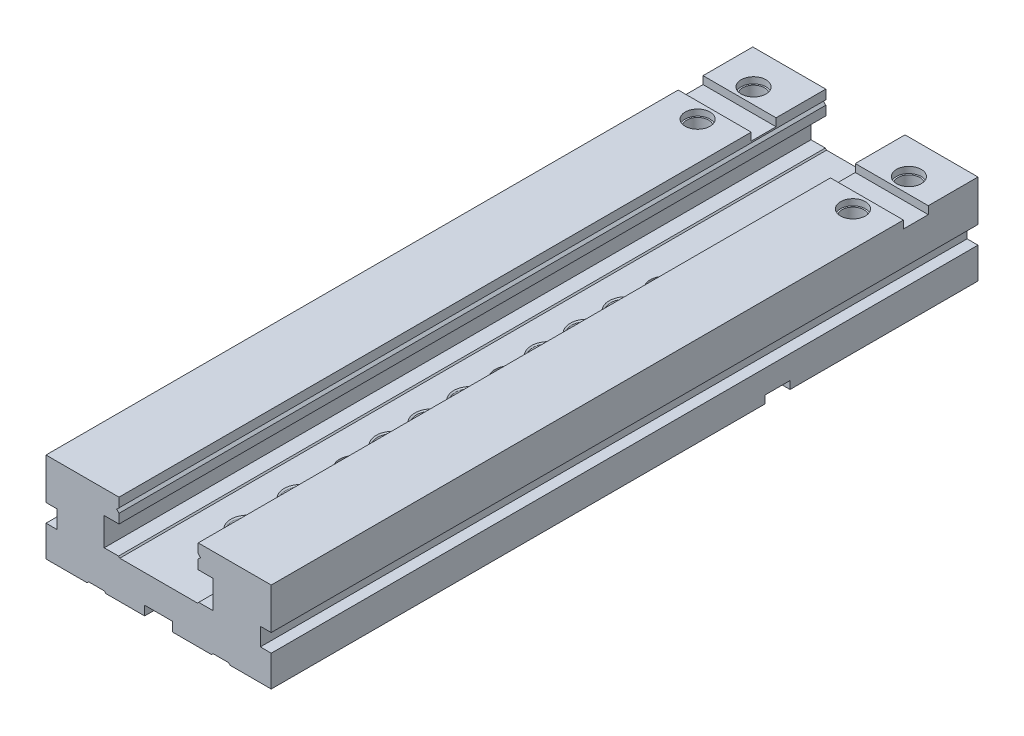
ISO-10303-21;
HEADER;
FILE_DESCRIPTION(('STEP AP214'),'2;1');
FILE_NAME('part.step','',(''),(''),'','','');
FILE_SCHEMA(('AUTOMOTIVE_DESIGN { 1 0 10303 214 1 1 1 1 }'));
ENDSEC;
DATA;
#1=APPLICATION_CONTEXT('core data for automotive mechanical design processes');
#2=APPLICATION_PROTOCOL_DEFINITION('international standard','automotive_design',2000,#1);
#3=PRODUCT_CONTEXT('',#1,'mechanical');
#4=PRODUCT('Part','Part','',(#3));
#5=PRODUCT_RELATED_PRODUCT_CATEGORY('part','',(#4));
#6=PRODUCT_DEFINITION_FORMATION('','',#4);
#7=PRODUCT_DEFINITION_CONTEXT('part definition',#1,'design');
#8=PRODUCT_DEFINITION('design','',#6,#7);
#9=PRODUCT_DEFINITION_SHAPE('','',#8);
#10=(LENGTH_UNIT() NAMED_UNIT(*) SI_UNIT(.MILLI.,.METRE.));
#11=(NAMED_UNIT(*) PLANE_ANGLE_UNIT() SI_UNIT($,.RADIAN.));
#12=(NAMED_UNIT(*) SI_UNIT($,.STERADIAN.) SOLID_ANGLE_UNIT());
#13=UNCERTAINTY_MEASURE_WITH_UNIT(LENGTH_MEASURE(1.E-05),#10,'distance_accuracy_value','');
#14=(GEOMETRIC_REPRESENTATION_CONTEXT(3) GLOBAL_UNCERTAINTY_ASSIGNED_CONTEXT((#13)) GLOBAL_UNIT_ASSIGNED_CONTEXT((#10,
#11,#12)) REPRESENTATION_CONTEXT('',''));
#15=CARTESIAN_POINT('',(0.,0.,0.));
#16=DIRECTION('',(0.,0.,1.));
#17=DIRECTION('',(1.,0.,0.));
#18=AXIS2_PLACEMENT_3D('',#15,#16,#17);
#19=CARTESIAN_POINT('',(24.9999999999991,-4.80000000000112,-454.999999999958));
#20=DIRECTION('',(0.,-1.,0.));
#21=DIRECTION('',(0.,0.,-1.));
#22=AXIS2_PLACEMENT_3D('',#19,#20,#21);
#23=PLANE('',#22);
#24=CARTESIAN_POINT('',(0.,-4.80000000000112,-225.999999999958));
#25=DIRECTION('',(0.,1.,0.));
#26=DIRECTION('',(0.,0.,1.));
#27=AXIS2_PLACEMENT_3D('',#24,#25,#26);
#28=CIRCLE('',#27,9.50000000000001);
#29=CARTESIAN_POINT('',(0.,-4.80000000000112,-216.499999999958));
#30=VERTEX_POINT('',#29);
#31=EDGE_CURVE('E740',#30,#30,#28,.T.);
#32=ORIENTED_EDGE('',*,*,#31,.F.);
#33=EDGE_LOOP('',(#32));
#34=FACE_BOUND('',#33,.T.);
#35=CARTESIAN_POINT('',(0.,-4.80000000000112,-125.999999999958));
#36=DIRECTION('',(0.,1.,0.));
#37=DIRECTION('',(0.,0.,1.));
#38=AXIS2_PLACEMENT_3D('',#35,#36,#37);
#39=CIRCLE('',#38,9.50000000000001);
#40=CARTESIAN_POINT('',(0.,-4.80000000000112,-116.499999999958));
#41=VERTEX_POINT('',#40);
#42=EDGE_CURVE('E727',#41,#41,#39,.T.);
#43=ORIENTED_EDGE('',*,*,#42,.F.);
#44=EDGE_LOOP('',(#43));
#45=FACE_BOUND('',#44,.T.);
#46=CARTESIAN_POINT('',(0.,-4.79999999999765,-57.4999999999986));
#47=DIRECTION('',(0.,1.,0.));
#48=DIRECTION('',(0.,0.,1.));
#49=AXIS2_PLACEMENT_3D('',#46,#47,#48);
#50=CIRCLE('',#49,11.0000000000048);
#51=CARTESIAN_POINT('',(0.,-4.79999999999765,-46.4999999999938));
#52=VERTEX_POINT('',#51);
#53=EDGE_CURVE('E996',#52,#52,#50,.T.);
#54=ORIENTED_EDGE('',*,*,#53,.F.);
#55=EDGE_LOOP('',(#54));
#56=FACE_BOUND('',#55,.T.);
#57=CARTESIAN_POINT('',(0.,-4.80000000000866,-91.7499999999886));
#58=DIRECTION('',(0.,1.,0.));
#59=DIRECTION('',(0.,0.,1.));
#60=AXIS2_PLACEMENT_3D('',#57,#58,#59);
#61=CIRCLE('',#60,10.9999999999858);
#62=CARTESIAN_POINT('',(0.,-4.80000000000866,-80.7500000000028));
#63=VERTEX_POINT('',#62);
#64=EDGE_CURVE('E1446',#63,#63,#61,.T.);
#65=ORIENTED_EDGE('',*,*,#64,.F.);
#66=EDGE_LOOP('',(#65));
#67=FACE_BOUND('',#66,.T.);
#68=CARTESIAN_POINT('',(0.,-4.79999999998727,-201.000000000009));
#69=DIRECTION('',(0.,1.,0.));
#70=DIRECTION('',(0.,0.,1.));
#71=AXIS2_PLACEMENT_3D('',#68,#69,#70);
#72=CIRCLE('',#71,11.0000000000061);
#73=CARTESIAN_POINT('',(0.,-4.79999999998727,-190.000000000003));
#74=VERTEX_POINT('',#73);
#75=EDGE_CURVE('E1449',#74,#74,#72,.T.);
#76=ORIENTED_EDGE('',*,*,#75,.F.);
#77=EDGE_LOOP('',(#76));
#78=FACE_BOUND('',#77,.T.);
#79=CARTESIAN_POINT('',(0.,-4.79999999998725,-176.000000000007));
#80=DIRECTION('',(0.,1.,0.));
#81=DIRECTION('',(0.,0.,1.));
#82=AXIS2_PLACEMENT_3D('',#79,#80,#81);
#83=CIRCLE('',#82,11.0000000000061);
#84=CARTESIAN_POINT('',(0.,-4.79999999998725,-165.000000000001));
#85=VERTEX_POINT('',#84);
#86=EDGE_CURVE('E1452',#85,#85,#83,.T.);
#87=ORIENTED_EDGE('',*,*,#86,.F.);
#88=EDGE_LOOP('',(#87));
#89=FACE_BOUND('',#88,.T.);
#90=CARTESIAN_POINT('',(0.,-4.79999999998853,-151.000000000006));
#91=DIRECTION('',(0.,1.,0.));
#92=DIRECTION('',(-1.,0.,0.));
#93=AXIS2_PLACEMENT_3D('',#90,#91,#92);
#94=CIRCLE('',#93,11.0000000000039);
#95=CARTESIAN_POINT('',(-11.0000000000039,-4.79999999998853,-151.000000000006));
#96=VERTEX_POINT('',#95);
#97=EDGE_CURVE('E1455',#96,#96,#94,.T.);
#98=ORIENTED_EDGE('',*,*,#97,.F.);
#99=EDGE_LOOP('',(#98));
#100=FACE_BOUND('',#99,.T.);
#101=CARTESIAN_POINT('',(0.,-4.8000000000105,-301.000000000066));
#102=DIRECTION('',(0.,1.,0.));
#103=DIRECTION('',(0.,0.,1.));
#104=AXIS2_PLACEMENT_3D('',#101,#102,#103);
#105=CIRCLE('',#104,10.9999999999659);
#106=CARTESIAN_POINT('',(0.,-4.8000000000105,-290.0000000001));
#107=VERTEX_POINT('',#106);
#108=EDGE_CURVE('E1458',#107,#107,#105,.T.);
#109=ORIENTED_EDGE('',*,*,#108,.F.);
#110=EDGE_LOOP('',(#109));
#111=FACE_BOUND('',#110,.T.);
#112=CARTESIAN_POINT('',(0.,-4.80000000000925,-275.999999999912));
#113=DIRECTION('',(0.,1.,0.));
#114=DIRECTION('',(0.,0.,1.));
#115=AXIS2_PLACEMENT_3D('',#112,#113,#114);
#116=CIRCLE('',#115,10.999999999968);
#117=CARTESIAN_POINT('',(0.,-4.80000000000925,-264.999999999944));
#118=VERTEX_POINT('',#117);
#119=EDGE_CURVE('E1461',#118,#118,#116,.T.);
#120=ORIENTED_EDGE('',*,*,#119,.F.);
#121=EDGE_LOOP('',(#120));
#122=FACE_BOUND('',#121,.T.);
#123=CARTESIAN_POINT('',(0.,-4.79999999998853,-251.000000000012));
#124=DIRECTION('',(0.,1.,0.));
#125=DIRECTION('',(0.,0.,1.));
#126=AXIS2_PLACEMENT_3D('',#123,#124,#125);
#127=CIRCLE('',#126,11.0000000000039);
#128=CARTESIAN_POINT('',(0.,-4.79999999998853,-240.000000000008));
#129=VERTEX_POINT('',#128);
#130=EDGE_CURVE('E1000',#129,#129,#127,.T.);
#131=ORIENTED_EDGE('',*,*,#130,.F.);
#132=EDGE_LOOP('',(#131));
#133=FACE_BOUND('',#132,.T.);
#134=DIRECTION('',(1.,0.,0.));
#135=VECTOR('',#134,1.);
#136=CARTESIAN_POINT('',(-72.4999999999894,-4.80000000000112,0.));
#137=LINE('',#136,#135);
#138=CARTESIAN_POINT('',(24.9999999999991,-4.80000000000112,1.66533453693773E-13));
#139=VERTEX_POINT('',#138);
#140=CARTESIAN_POINT('',(-24.9999999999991,-4.80000000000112,1.11022302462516E-13));
#141=VERTEX_POINT('',#140);
#142=EDGE_CURVE('E803',#139,#141,#137,.F.);
#143=ORIENTED_EDGE('',*,*,#142,.F.);
#144=DIRECTION('',(0.,0.,-1.));
#145=VECTOR('',#144,1.);
#146=CARTESIAN_POINT('',(24.9999999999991,-4.80000000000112,-454.999999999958));
#147=LINE('',#146,#145);
#148=CARTESIAN_POINT('',(24.9999999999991,-4.80000000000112,-454.999999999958));
#149=VERTEX_POINT('',#148);
#150=EDGE_CURVE('E1001',#149,#139,#147,.F.);
#151=ORIENTED_EDGE('',*,*,#150,.F.);
#152=DIRECTION('',(1.,0.,0.));
#153=VECTOR('',#152,1.);
#154=CARTESIAN_POINT('',(24.9999999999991,-4.80000000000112,-454.999999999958));
#155=LINE('',#154,#153);
#156=CARTESIAN_POINT('',(-24.9999999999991,-4.80000000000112,-454.999999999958));
#157=VERTEX_POINT('',#156);
#158=EDGE_CURVE('E1004',#157,#149,#155,.T.);
#159=ORIENTED_EDGE('',*,*,#158,.F.);
#160=DIRECTION('',(0.,0.,-1.));
#161=VECTOR('',#160,1.);
#162=CARTESIAN_POINT('',(-24.9999999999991,-4.80000000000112,-454.999999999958));
#163=LINE('',#162,#161);
#164=EDGE_CURVE('E997',#141,#157,#163,.T.);
#165=ORIENTED_EDGE('',*,*,#164,.F.);
#166=EDGE_LOOP('',(#143,#151,#159,#165));
#167=FACE_BOUND('',#166,.T.);
#168=CARTESIAN_POINT('',(0.,-4.80000000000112,-325.999999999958));
#169=DIRECTION('',(0.,1.,0.));
#170=DIRECTION('',(0.,0.,1.));
#171=AXIS2_PLACEMENT_3D('',#168,#169,#170);
#172=CIRCLE('',#171,9.50000000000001);
#173=CARTESIAN_POINT('',(0.,-4.80000000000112,-316.499999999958));
#174=VERTEX_POINT('',#173);
#175=EDGE_CURVE('E3004',#174,#174,#172,.T.);
#176=ORIENTED_EDGE('',*,*,#175,.F.);
#177=EDGE_LOOP('',(#176));
#178=FACE_BOUND('',#177,.T.);
#179=ADVANCED_FACE('F35',(#34,#45,#56,#67,#78,#89,#100,#111,#122,#133,#167,#178),#23,.F.);
#180=CARTESIAN_POINT('',(0.,-9.99999999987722,-440.000000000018));
#181=DIRECTION('',(0.,-1.,0.));
#182=DIRECTION('',(0.,0.,-1.));
#183=AXIS2_PLACEMENT_3D('',#180,#181,#182);
#184=CONICAL_SURFACE('',#183,2.09999999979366,1.02974425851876);
#185=CARTESIAN_POINT('',(0.,-9.99999999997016,-440.000000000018));
#186=DIRECTION('',(0.,-1.,0.));
#187=DIRECTION('',(0.,0.,-1.));
#188=AXIS2_PLACEMENT_3D('',#185,#186,#187);
#189=CIRCLE('',#188,2.09999999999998);
#190=CARTESIAN_POINT('',(0.,-9.99999999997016,-442.100000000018));
#191=VERTEX_POINT('',#190);
#192=EDGE_CURVE('E723',#191,#191,#189,.T.);
#193=ORIENTED_EDGE('',*,*,#192,.T.);
#194=EDGE_LOOP('',(#193));
#195=FACE_BOUND('',#194,.T.);
#196=CARTESIAN_POINT('',(0.,-8.73819269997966,-440.000000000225));
#197=VERTEX_POINT('',#196);
#198=VERTEX_LOOP('',#197);
#199=FACE_BOUND('',#198,.T.);
#200=ADVANCED_FACE('F37',(#195,#199),#184,.F.);
#201=CARTESIAN_POINT('',(57.4999999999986,-9.99999999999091,-325.999999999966));
#202=DIRECTION('',(0.,-1.,0.));
#203=DIRECTION('',(0.,0.,-1.));
#204=AXIS2_PLACEMENT_3D('',#201,#202,#203);
#205=CONICAL_SURFACE('',#204,2.10000000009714,1.02974425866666);
#206=CARTESIAN_POINT('',(57.4999999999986,-9.99999999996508,-325.999999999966));
#207=DIRECTION('',(0.,-1.,0.));
#208=DIRECTION('',(0.,0.,-1.));
#209=AXIS2_PLACEMENT_3D('',#206,#207,#208);
#210=CIRCLE('',#209,2.09999999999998);
#211=CARTESIAN_POINT('',(57.4999999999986,-9.99999999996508,-328.099999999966));
#212=VERTEX_POINT('',#211);
#213=EDGE_CURVE('E1428',#212,#212,#210,.T.);
#214=ORIENTED_EDGE('',*,*,#213,.T.);
#215=EDGE_LOOP('',(#214));
#216=FACE_BOUND('',#215,.T.);
#217=CARTESIAN_POINT('',(57.4999999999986,-8.73819269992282,-326.00000000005));
#218=VERTEX_POINT('',#217);
#219=VERTEX_LOOP('',#218);
#220=FACE_BOUND('',#219,.T.);
#221=ADVANCED_FACE('F1630',(#216,#220),#205,.F.);
#222=CARTESIAN_POINT('',(-50.0000000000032,-11.0000000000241,-433.000000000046));
#223=DIRECTION('',(0.,1.,0.));
#224=DIRECTION('',(0.,0.,1.));
#225=AXIS2_PLACEMENT_3D('',#222,#223,#224);
#226=CONICAL_SURFACE('',#225,6.99999999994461,1.02974425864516);
#227=CARTESIAN_POINT('',(-50.0000000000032,-11.0000000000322,-433.000000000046));
#228=DIRECTION('',(0.,1.,0.));
#229=DIRECTION('',(0.,0.,1.));
#230=AXIS2_PLACEMENT_3D('',#227,#228,#229);
#231=CIRCLE('',#230,6.99999999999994);
#232=CARTESIAN_POINT('',(-50.0000000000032,-11.0000000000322,-426.000000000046));
#233=VERTEX_POINT('',#232);
#234=EDGE_CURVE('E1425',#233,#233,#231,.T.);
#235=ORIENTED_EDGE('',*,*,#234,.T.);
#236=EDGE_LOOP('',(#235));
#237=FACE_BOUND('',#236,.T.);
#238=CARTESIAN_POINT('',(-50.0000000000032,-15.2060243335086,-433.00000000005));
#239=VERTEX_POINT('',#238);
#240=VERTEX_LOOP('',#239);
#241=FACE_BOUND('',#240,.T.);
#242=ADVANCED_FACE('F2780',(#237,#241),#226,.F.);
#243=CARTESIAN_POINT('',(-57.4999999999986,-9.99999999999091,-325.999999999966));
#244=DIRECTION('',(0.,-1.,0.));
#245=DIRECTION('',(0.,0.,-1.));
#246=AXIS2_PLACEMENT_3D('',#243,#244,#245);
#247=CONICAL_SURFACE('',#246,2.10000000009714,1.02974425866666);
#248=CARTESIAN_POINT('',(-57.4999999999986,-9.99999999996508,-325.999999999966));
#249=DIRECTION('',(0.,-1.,0.));
#250=DIRECTION('',(0.,0.,-1.));
#251=AXIS2_PLACEMENT_3D('',#248,#249,#250);
#252=CIRCLE('',#251,2.09999999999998);
#253=CARTESIAN_POINT('',(-57.4999999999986,-9.99999999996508,-328.099999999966));
#254=VERTEX_POINT('',#253);
#255=EDGE_CURVE('E720',#254,#254,#252,.T.);
#256=ORIENTED_EDGE('',*,*,#255,.T.);
#257=EDGE_LOOP('',(#256));
#258=FACE_BOUND('',#257,.T.);
#259=CARTESIAN_POINT('',(-57.4999999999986,-8.73819269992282,-326.00000000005));
#260=VERTEX_POINT('',#259);
#261=VERTEX_LOOP('',#260);
#262=FACE_BOUND('',#261,.T.);
#263=ADVANCED_FACE('F2776',(#258,#262),#247,.F.);
#264=CARTESIAN_POINT('',(0.,-23.99999999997,-440.000000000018));
#265=DIRECTION('',(0.,-1.,0.));
#266=DIRECTION('',(0.,0.,-1.));
#267=AXIS2_PLACEMENT_3D('',#264,#265,#266);
#268=CYLINDRICAL_SURFACE('',#267,2.09999999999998);
#269=CARTESIAN_POINT('',(0.,-22.7000000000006,-440.000000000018));
#270=DIRECTION('',(0.,-1.,0.));
#271=DIRECTION('',(0.,0.,-1.));
#272=AXIS2_PLACEMENT_3D('',#269,#270,#271);
#273=CIRCLE('',#272,2.09999999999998);
#274=CARTESIAN_POINT('',(0.,-22.7000000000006,-442.100000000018));
#275=VERTEX_POINT('',#274);
#276=EDGE_CURVE('E717',#275,#275,#273,.T.);
#277=ORIENTED_EDGE('',*,*,#276,.T.);
#278=EDGE_LOOP('',(#277));
#279=FACE_BOUND('',#278,.T.);
#280=ORIENTED_EDGE('',*,*,#192,.F.);
#281=EDGE_LOOP('',(#280));
#282=FACE_BOUND('',#281,.T.);
#283=ADVANCED_FACE('F2772',(#279,#282),#268,.F.);
#284=CARTESIAN_POINT('',(50.0000000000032,-11.0000000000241,-433.000000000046));
#285=DIRECTION('',(0.,1.,0.));
#286=DIRECTION('',(0.,0.,1.));
#287=AXIS2_PLACEMENT_3D('',#284,#285,#286);
#288=CONICAL_SURFACE('',#287,6.99999999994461,1.02974425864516);
#289=CARTESIAN_POINT('',(50.0000000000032,-11.0000000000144,-433.000000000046));
#290=DIRECTION('',(0.,1.,0.));
#291=DIRECTION('',(0.,0.,1.));
#292=AXIS2_PLACEMENT_3D('',#289,#290,#291);
#293=CIRCLE('',#292,6.99999999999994);
#294=CARTESIAN_POINT('',(50.0000000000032,-11.0000000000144,-426.000000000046));
#295=VERTEX_POINT('',#294);
#296=EDGE_CURVE('E716',#295,#295,#293,.T.);
#297=ORIENTED_EDGE('',*,*,#296,.T.);
#298=EDGE_LOOP('',(#297));
#299=FACE_BOUND('',#298,.T.);
#300=CARTESIAN_POINT('',(50.0000000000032,-15.2060243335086,-433.00000000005));
#301=VERTEX_POINT('',#300);
#302=VERTEX_LOOP('',#301);
#303=FACE_BOUND('',#302,.T.);
#304=ADVANCED_FACE('F2768',(#299,#303),#288,.F.);
#305=CARTESIAN_POINT('',(57.4999999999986,-24.0000000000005,-325.999999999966));
#306=DIRECTION('',(0.,-1.,0.));
#307=DIRECTION('',(0.,0.,-1.));
#308=AXIS2_PLACEMENT_3D('',#305,#306,#307);
#309=CYLINDRICAL_SURFACE('',#308,2.09999999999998);
#310=CARTESIAN_POINT('',(57.4999999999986,-22.6999999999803,-325.999999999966));
#311=DIRECTION('',(0.,-1.,0.));
#312=DIRECTION('',(0.,0.,-1.));
#313=AXIS2_PLACEMENT_3D('',#310,#311,#312);
#314=CIRCLE('',#313,2.09999999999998);
#315=CARTESIAN_POINT('',(57.4999999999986,-22.6999999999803,-328.099999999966));
#316=VERTEX_POINT('',#315);
#317=EDGE_CURVE('E712',#316,#316,#314,.T.);
#318=ORIENTED_EDGE('',*,*,#317,.T.);
#319=EDGE_LOOP('',(#318));
#320=FACE_BOUND('',#319,.T.);
#321=ORIENTED_EDGE('',*,*,#213,.F.);
#322=EDGE_LOOP('',(#321));
#323=FACE_BOUND('',#322,.T.);
#324=ADVANCED_FACE('F2764',(#320,#323),#309,.F.);
#325=CARTESIAN_POINT('',(0.,-15.3773502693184,-251.000000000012));
#326=DIRECTION('',(0.,1.,0.));
#327=DIRECTION('',(-1.,0.,0.));
#328=AXIS2_PLACEMENT_3D('',#325,#326,#327);
#329=CONICAL_SURFACE('',#328,4.99999999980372,1.02974425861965);
#330=CARTESIAN_POINT('',(0.,-15.3773502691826,-251.000000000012));
#331=DIRECTION('',(0.,1.,0.));
#332=DIRECTION('',(0.,0.,1.));
#333=AXIS2_PLACEMENT_3D('',#330,#331,#332);
#334=CIRCLE('',#333,5.00000000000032);
#335=CARTESIAN_POINT('',(0.,-15.3773502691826,-246.000000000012));
#336=VERTEX_POINT('',#335);
#337=EDGE_CURVE('E715',#336,#336,#334,.T.);
#338=ORIENTED_EDGE('',*,*,#337,.T.);
#339=EDGE_LOOP('',(#338));
#340=FACE_BOUND('',#339,.T.);
#341=CARTESIAN_POINT('',(0.,-18.3816533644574,-250.999999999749));
#342=VERTEX_POINT('',#341);
#343=VERTEX_LOOP('',#342);
#344=FACE_BOUND('',#343,.T.);
#345=ADVANCED_FACE('F2760',(#340,#344),#329,.F.);
#346=CARTESIAN_POINT('',(0.,-15.3773502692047,-275.999999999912));
#347=DIRECTION('',(0.,1.,0.));
#348=DIRECTION('',(0.,0.,1.));
#349=AXIS2_PLACEMENT_3D('',#346,#347,#348);
#350=CONICAL_SURFACE('',#349,4.99999999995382,1.02974425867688);
#351=CARTESIAN_POINT('',(0.,-15.3773502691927,-275.999999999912));
#352=DIRECTION('',(0.,1.,0.));
#353=DIRECTION('',(0.,0.,1.));
#354=AXIS2_PLACEMENT_3D('',#351,#352,#353);
#355=CIRCLE('',#354,5.00000000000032);
#356=CARTESIAN_POINT('',(0.,-15.3773502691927,-270.999999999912));
#357=VERTEX_POINT('',#356);
#358=EDGE_CURVE('E1416',#357,#357,#355,.T.);
#359=ORIENTED_EDGE('',*,*,#358,.T.);
#360=EDGE_LOOP('',(#359));
#361=FACE_BOUND('',#360,.T.);
#362=CARTESIAN_POINT('',(0.,-18.3816533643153,-276.000000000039));
#363=VERTEX_POINT('',#362);
#364=VERTEX_LOOP('',#363);
#365=FACE_BOUND('',#364,.T.);
#366=ADVANCED_FACE('F2756',(#361,#365),#350,.F.);
#367=CARTESIAN_POINT('',(0.,-15.3773502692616,-301.000000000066));
#368=DIRECTION('',(0.,1.,0.));
#369=DIRECTION('',(0.,0.,1.));
#370=AXIS2_PLACEMENT_3D('',#367,#368,#369);
#371=CONICAL_SURFACE('',#370,4.99999999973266,1.02974425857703);
#372=CARTESIAN_POINT('',(0.,-15.3773502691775,-301.000000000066));
#373=DIRECTION('',(0.,1.,0.));
#374=DIRECTION('',(0.,0.,1.));
#375=AXIS2_PLACEMENT_3D('',#372,#373,#374);
#376=CIRCLE('',#375,5.00000000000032);
#377=CARTESIAN_POINT('',(0.,-15.3773502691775,-296.000000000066));
#378=VERTEX_POINT('',#377);
#379=EDGE_CURVE('E1413',#378,#378,#376,.T.);
#380=ORIENTED_EDGE('',*,*,#379,.T.);
#381=EDGE_LOOP('',(#380));
#382=FACE_BOUND('',#381,.T.);
#383=CARTESIAN_POINT('',(0.,-18.3816533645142,-300.999999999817));
#384=VERTEX_POINT('',#383);
#385=VERTEX_LOOP('',#384);
#386=FACE_BOUND('',#385,.T.);
#387=ADVANCED_FACE('F2752',(#382,#386),#371,.F.);
#388=CARTESIAN_POINT('',(0.,-15.3773502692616,-151.000000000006));
#389=DIRECTION('',(0.,1.,0.));
#390=DIRECTION('',(0.,0.,1.));
#391=AXIS2_PLACEMENT_3D('',#388,#389,#390);
#392=CONICAL_SURFACE('',#391,4.99999999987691,1.02974425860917);
#393=CARTESIAN_POINT('',(0.,-15.3773502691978,-151.000000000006));
#394=DIRECTION('',(0.,1.,0.));
#395=DIRECTION('',(0.,0.,1.));
#396=AXIS2_PLACEMENT_3D('',#393,#394,#395);
#397=CIRCLE('',#396,5.00000000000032);
#398=CARTESIAN_POINT('',(0.,-15.3773502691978,-146.000000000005));
#399=VERTEX_POINT('',#398);
#400=EDGE_CURVE('E1410',#399,#399,#397,.T.);
#401=ORIENTED_EDGE('',*,*,#400,.T.);
#402=EDGE_LOOP('',(#401));
#403=FACE_BOUND('',#402,.T.);
#404=CARTESIAN_POINT('',(0.,-18.381653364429,-150.999999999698));
#405=VERTEX_POINT('',#404);
#406=VERTEX_LOOP('',#405);
#407=FACE_BOUND('',#406,.T.);
#408=ADVANCED_FACE('F2748',(#403,#407),#392,.F.);
#409=CARTESIAN_POINT('',(0.,-15.3773502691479,-176.000000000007));
#410=DIRECTION('',(0.,1.,0.));
#411=DIRECTION('',(0.,0.,1.));
#412=AXIS2_PLACEMENT_3D('',#409,#410,#411);
#413=CONICAL_SURFACE('',#412,5.0000000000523,1.02974425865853);
#414=CARTESIAN_POINT('',(0.,-15.3773502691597,-176.000000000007));
#415=DIRECTION('',(0.,1.,0.));
#416=DIRECTION('',(0.,0.,1.));
#417=AXIS2_PLACEMENT_3D('',#414,#415,#416);
#418=CIRCLE('',#417,5.00000000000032);
#419=CARTESIAN_POINT('',(0.,-15.3773502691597,-171.000000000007));
#420=VERTEX_POINT('',#419);
#421=EDGE_CURVE('E1407',#420,#420,#418,.T.);
#422=ORIENTED_EDGE('',*,*,#421,.T.);
#423=EDGE_LOOP('',(#422));
#424=FACE_BOUND('',#423,.T.);
#425=CARTESIAN_POINT('',(1.13686837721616E-10,-18.3816533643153,-176.000000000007));
#426=VERTEX_POINT('',#425);
#427=VERTEX_LOOP('',#426);
#428=FACE_BOUND('',#427,.T.);
#429=ADVANCED_FACE('F2744',(#424,#428),#413,.F.);
#430=CARTESIAN_POINT('',(0.,-15.3799999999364,-91.7499999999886));
#431=DIRECTION('',(0.,1.,0.));
#432=DIRECTION('',(0.,0.,1.));
#433=AXIS2_PLACEMENT_3D('',#430,#431,#432);
#434=CONICAL_SURFACE('',#433,4.99999999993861,1.02974425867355);
#435=CARTESIAN_POINT('',(0.,-15.3800000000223,-91.7499999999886));
#436=DIRECTION('',(0.,1.,0.));
#437=DIRECTION('',(0.,0.,1.));
#438=AXIS2_PLACEMENT_3D('',#435,#436,#437);
#439=CIRCLE('',#438,5.00000000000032);
#440=CARTESIAN_POINT('',(0.,-15.3800000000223,-86.7499999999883));
#441=VERTEX_POINT('',#440);
#442=EDGE_CURVE('E1401',#441,#441,#439,.T.);
#443=ORIENTED_EDGE('',*,*,#442,.T.);
#444=EDGE_LOOP('',(#443));
#445=FACE_BOUND('',#444,.T.);
#446=CARTESIAN_POINT('',(8.5265128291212E-11,-18.384303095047,-91.7499999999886));
#447=VERTEX_POINT('',#446);
#448=VERTEX_LOOP('',#447);
#449=FACE_BOUND('',#448,.T.);
#450=ADVANCED_FACE('F2740',(#445,#449),#434,.F.);
#451=CARTESIAN_POINT('',(0.,-15.3799999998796,-57.4999999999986));
#452=DIRECTION('',(0.,1.,0.));
#453=DIRECTION('',(0.,0.,1.));
#454=AXIS2_PLACEMENT_3D('',#451,#452,#453);
#455=CONICAL_SURFACE('',#454,5.00000000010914,1.02974425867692);
#456=CARTESIAN_POINT('',(0.,-15.3799999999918,-57.4999999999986));
#457=DIRECTION('',(0.,1.,0.));
#458=DIRECTION('',(0.,0.,1.));
#459=AXIS2_PLACEMENT_3D('',#456,#457,#458);
#460=CIRCLE('',#459,5.00000000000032);
#461=CARTESIAN_POINT('',(0.,-15.3799999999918,-52.4999999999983));
#462=VERTEX_POINT('',#461);
#463=EDGE_CURVE('E1398',#462,#462,#460,.T.);
#464=ORIENTED_EDGE('',*,*,#463,.T.);
#465=EDGE_LOOP('',(#464));
#466=FACE_BOUND('',#465,.T.);
#467=CARTESIAN_POINT('',(-5.6843418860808E-11,-18.3843030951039,-57.4999999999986));
#468=VERTEX_POINT('',#467);
#469=VERTEX_LOOP('',#468);
#470=FACE_BOUND('',#469,.T.);
#471=ADVANCED_FACE('F2736',(#466,#470),#455,.F.);
#472=CARTESIAN_POINT('',(-50.0000000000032,-11.0000000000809,-396.999999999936));
#473=DIRECTION('',(0.,1.,0.));
#474=DIRECTION('',(0.,0.,1.));
#475=AXIS2_PLACEMENT_3D('',#472,#473,#474);
#476=CONICAL_SURFACE('',#475,6.99999999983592,1.02974425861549);
#477=CARTESIAN_POINT('',(-50.0000000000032,-10.999999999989,-396.999999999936));
#478=DIRECTION('',(0.,1.,0.));
#479=DIRECTION('',(0.,0.,1.));
#480=AXIS2_PLACEMENT_3D('',#477,#478,#479);
#481=CIRCLE('',#480,6.99999999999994);
#482=CARTESIAN_POINT('',(-50.0000000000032,-10.999999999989,-389.999999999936));
#483=VERTEX_POINT('',#482);
#484=EDGE_CURVE('E711',#483,#483,#481,.T.);
#485=ORIENTED_EDGE('',*,*,#484,.T.);
#486=EDGE_LOOP('',(#485));
#487=FACE_BOUND('',#486,.T.);
#488=CARTESIAN_POINT('',(-50.0000000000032,-15.206024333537,-396.999999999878));
#489=VERTEX_POINT('',#488);
#490=VERTEX_LOOP('',#489);
#491=FACE_BOUND('',#490,.T.);
#492=ADVANCED_FACE('F2732',(#487,#491),#476,.F.);
#493=CARTESIAN_POINT('',(-50.0000000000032,29.000000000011,-433.000000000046));
#494=DIRECTION('',(0.,1.,0.));
#495=DIRECTION('',(0.,0.,1.));
#496=AXIS2_PLACEMENT_3D('',#493,#494,#495);
#497=CYLINDRICAL_SURFACE('',#496,6.99999999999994);
#498=CARTESIAN_POINT('',(-50.0000000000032,24.9999999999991,-433.000000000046));
#499=DIRECTION('',(0.,1.,0.));
#500=DIRECTION('',(0.,0.,1.));
#501=AXIS2_PLACEMENT_3D('',#498,#499,#500);
#502=CIRCLE('',#501,6.99999999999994);
#503=CARTESIAN_POINT('',(-50.0000000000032,24.9999999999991,-426.000000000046));
#504=VERTEX_POINT('',#503);
#505=EDGE_CURVE('E708',#504,#504,#502,.T.);
#506=ORIENTED_EDGE('',*,*,#505,.T.);
#507=EDGE_LOOP('',(#506));
#508=FACE_BOUND('',#507,.T.);
#509=ORIENTED_EDGE('',*,*,#234,.F.);
#510=EDGE_LOOP('',(#509));
#511=FACE_BOUND('',#510,.T.);
#512=ADVANCED_FACE('F2728',(#508,#511),#497,.F.);
#513=CARTESIAN_POINT('',(-57.4999999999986,-24.0000000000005,-325.999999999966));
#514=DIRECTION('',(0.,-1.,0.));
#515=DIRECTION('',(0.,0.,-1.));
#516=AXIS2_PLACEMENT_3D('',#513,#514,#515);
#517=CYLINDRICAL_SURFACE('',#516,2.09999999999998);
#518=CARTESIAN_POINT('',(-57.4999999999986,-22.6999999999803,-325.999999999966));
#519=DIRECTION('',(0.,-1.,0.));
#520=DIRECTION('',(0.,0.,-1.));
#521=AXIS2_PLACEMENT_3D('',#518,#519,#520);
#522=CIRCLE('',#521,2.09999999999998);
#523=CARTESIAN_POINT('',(-57.4999999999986,-22.6999999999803,-328.099999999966));
#524=VERTEX_POINT('',#523);
#525=EDGE_CURVE('E705',#524,#524,#522,.T.);
#526=ORIENTED_EDGE('',*,*,#525,.T.);
#527=EDGE_LOOP('',(#526));
#528=FACE_BOUND('',#527,.T.);
#529=ORIENTED_EDGE('',*,*,#255,.F.);
#530=EDGE_LOOP('',(#529));
#531=FACE_BOUND('',#530,.T.);
#532=ADVANCED_FACE('F2724',(#528,#531),#517,.F.);
#533=CARTESIAN_POINT('',(0.,-15.3773502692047,-201.000000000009));
#534=DIRECTION('',(0.,1.,0.));
#535=DIRECTION('',(0.,0.,1.));
#536=AXIS2_PLACEMENT_3D('',#533,#534,#535);
#537=CONICAL_SURFACE('',#536,4.99999999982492,1.02974425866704);
#538=CARTESIAN_POINT('',(0.,-15.3773502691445,-201.000000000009));
#539=DIRECTION('',(0.,1.,0.));
#540=DIRECTION('',(0.,0.,1.));
#541=AXIS2_PLACEMENT_3D('',#538,#539,#540);
#542=CIRCLE('',#541,5.00000000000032);
#543=CARTESIAN_POINT('',(0.,-15.3773502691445,-196.000000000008));
#544=VERTEX_POINT('',#543);
#545=EDGE_CURVE('E1404',#544,#544,#542,.T.);
#546=ORIENTED_EDGE('',*,*,#545,.T.);
#547=EDGE_LOOP('',(#546));
#548=FACE_BOUND('',#547,.T.);
#549=CARTESIAN_POINT('',(0.,-17.1198460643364,-201.000000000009));
#550=DIRECTION('',(0.,-1.,0.));
#551=DIRECTION('',(0.,0.,-1.));
#552=AXIS2_PLACEMENT_3D('',#549,#550,#551);
#553=CIRCLE('',#552,2.09999999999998);
#554=CARTESIAN_POINT('',(0.,-17.1198460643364,-203.100000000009));
#555=VERTEX_POINT('',#554);
#556=EDGE_CURVE('E704',#555,#555,#553,.T.);
#557=ORIENTED_EDGE('',*,*,#556,.T.);
#558=EDGE_LOOP('',(#557));
#559=FACE_BOUND('',#558,.T.);
#560=ADVANCED_FACE('F2720',(#548,#559),#537,.F.);
#561=CARTESIAN_POINT('',(0.,-22.7000000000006,-440.000000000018));
#562=DIRECTION('',(0.,1.,0.));
#563=DIRECTION('',(0.,0.,1.));
#564=AXIS2_PLACEMENT_3D('',#561,#562,#563);
#565=PLANE('',#564);
#566=ORIENTED_EDGE('',*,*,#276,.F.);
#567=EDGE_LOOP('',(#566));
#568=FACE_BOUND('',#567,.T.);
#569=CARTESIAN_POINT('',(0.,-22.7000000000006,-440.000000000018));
#570=DIRECTION('',(0.,-1.,0.));
#571=DIRECTION('',(0.,0.,-1.));
#572=AXIS2_PLACEMENT_3D('',#569,#570,#571);
#573=CIRCLE('',#572,2.49999999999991);
#574=CARTESIAN_POINT('',(0.,-22.7000000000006,-442.500000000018));
#575=VERTEX_POINT('',#574);
#576=EDGE_CURVE('E701',#575,#575,#573,.T.);
#577=ORIENTED_EDGE('',*,*,#576,.T.);
#578=EDGE_LOOP('',(#577));
#579=FACE_BOUND('',#578,.T.);
#580=ADVANCED_FACE('F2716',(#568,#579),#565,.F.);
#581=CARTESIAN_POINT('',(50.0000000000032,29.000000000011,-433.000000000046));
#582=DIRECTION('',(0.,1.,0.));
#583=DIRECTION('',(0.,0.,1.));
#584=AXIS2_PLACEMENT_3D('',#581,#582,#583);
#585=CYLINDRICAL_SURFACE('',#584,6.99999999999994);
#586=CARTESIAN_POINT('',(50.0000000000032,24.9999999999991,-433.000000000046));
#587=DIRECTION('',(0.,1.,0.));
#588=DIRECTION('',(0.,0.,1.));
#589=AXIS2_PLACEMENT_3D('',#586,#587,#588);
#590=CIRCLE('',#589,6.99999999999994);
#591=CARTESIAN_POINT('',(50.0000000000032,24.9999999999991,-426.000000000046));
#592=VERTEX_POINT('',#591);
#593=EDGE_CURVE('E694',#592,#592,#590,.T.);
#594=ORIENTED_EDGE('',*,*,#593,.T.);
#595=EDGE_LOOP('',(#594));
#596=FACE_BOUND('',#595,.T.);
#597=ORIENTED_EDGE('',*,*,#296,.F.);
#598=EDGE_LOOP('',(#597));
#599=FACE_BOUND('',#598,.T.);
#600=ADVANCED_FACE('F2712',(#596,#599),#585,.F.);
#601=CARTESIAN_POINT('',(57.4999999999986,-22.6999999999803,-325.999999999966));
#602=DIRECTION('',(0.,1.,0.));
#603=DIRECTION('',(0.,0.,1.));
#604=AXIS2_PLACEMENT_3D('',#601,#602,#603);
#605=PLANE('',#604);
#606=ORIENTED_EDGE('',*,*,#317,.F.);
#607=EDGE_LOOP('',(#606));
#608=FACE_BOUND('',#607,.T.);
#609=CARTESIAN_POINT('',(57.4999999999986,-22.6999999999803,-325.999999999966));
#610=DIRECTION('',(0.,-1.,0.));
#611=DIRECTION('',(0.,0.,-1.));
#612=AXIS2_PLACEMENT_3D('',#609,#610,#611);
#613=CIRCLE('',#612,2.49999999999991);
#614=CARTESIAN_POINT('',(57.4999999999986,-22.6999999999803,-328.499999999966));
#615=VERTEX_POINT('',#614);
#616=EDGE_CURVE('E689',#615,#615,#613,.T.);
#617=ORIENTED_EDGE('',*,*,#616,.T.);
#618=EDGE_LOOP('',(#617));
#619=FACE_BOUND('',#618,.T.);
#620=ADVANCED_FACE('F2424',(#608,#619),#605,.F.);
#621=CARTESIAN_POINT('',(0.,-5.37735026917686,-251.000000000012));
#622=DIRECTION('',(0.,1.,0.));
#623=DIRECTION('',(0.,0.,1.));
#624=AXIS2_PLACEMENT_3D('',#621,#622,#623);
#625=CYLINDRICAL_SURFACE('',#624,5.00000000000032);
#626=CARTESIAN_POINT('',(0.,-10.3773502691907,-251.000000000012));
#627=DIRECTION('',(0.,1.,0.));
#628=DIRECTION('',(0.,0.,1.));
#629=AXIS2_PLACEMENT_3D('',#626,#627,#628);
#630=CIRCLE('',#629,4.99999999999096);
#631=CARTESIAN_POINT('',(0.,-10.3773502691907,-246.000000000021));
#632=VERTEX_POINT('',#631);
#633=EDGE_CURVE('E1350',#632,#632,#630,.T.);
#634=ORIENTED_EDGE('',*,*,#633,.T.);
#635=EDGE_LOOP('',(#634));
#636=FACE_BOUND('',#635,.T.);
#637=ORIENTED_EDGE('',*,*,#337,.F.);
#638=EDGE_LOOP('',(#637));
#639=FACE_BOUND('',#638,.T.);
#640=ADVANCED_FACE('F2677',(#636,#639),#625,.F.);
#641=CARTESIAN_POINT('',(0.,-5.37735026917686,-275.999999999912));
#642=DIRECTION('',(0.,1.,0.));
#643=DIRECTION('',(0.,0.,1.));
#644=AXIS2_PLACEMENT_3D('',#641,#642,#643);
#645=CYLINDRICAL_SURFACE('',#644,5.00000000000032);
#646=CARTESIAN_POINT('',(0.,-10.3773502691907,-275.999999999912));
#647=DIRECTION('',(0.,1.,0.));
#648=DIRECTION('',(0.,0.,1.));
#649=AXIS2_PLACEMENT_3D('',#646,#647,#648);
#650=CIRCLE('',#649,4.99999999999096);
#651=CARTESIAN_POINT('',(0.,-10.3773502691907,-270.999999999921));
#652=VERTEX_POINT('',#651);
#653=EDGE_CURVE('E1386',#652,#652,#650,.T.);
#654=ORIENTED_EDGE('',*,*,#653,.T.);
#655=EDGE_LOOP('',(#654));
#656=FACE_BOUND('',#655,.T.);
#657=ORIENTED_EDGE('',*,*,#358,.F.);
#658=EDGE_LOOP('',(#657));
#659=FACE_BOUND('',#658,.T.);
#660=ADVANCED_FACE('F2682',(#656,#659),#645,.F.);
#661=CARTESIAN_POINT('',(0.,-5.37735026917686,-301.000000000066));
#662=DIRECTION('',(0.,1.,0.));
#663=DIRECTION('',(0.,0.,1.));
#664=AXIS2_PLACEMENT_3D('',#661,#662,#663);
#665=CYLINDRICAL_SURFACE('',#664,5.00000000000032);
#666=CARTESIAN_POINT('',(0.,-10.3773502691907,-301.000000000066));
#667=DIRECTION('',(0.,1.,0.));
#668=DIRECTION('',(0.,0.,1.));
#669=AXIS2_PLACEMENT_3D('',#666,#667,#668);
#670=CIRCLE('',#669,4.99999999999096);
#671=CARTESIAN_POINT('',(0.,-10.3773502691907,-296.000000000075));
#672=VERTEX_POINT('',#671);
#673=EDGE_CURVE('E1383',#672,#672,#670,.T.);
#674=ORIENTED_EDGE('',*,*,#673,.T.);
#675=EDGE_LOOP('',(#674));
#676=FACE_BOUND('',#675,.T.);
#677=ORIENTED_EDGE('',*,*,#379,.F.);
#678=EDGE_LOOP('',(#677));
#679=FACE_BOUND('',#678,.T.);
#680=ADVANCED_FACE('F2690',(#676,#679),#665,.F.);
#681=CARTESIAN_POINT('',(0.,-5.37735026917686,-151.000000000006));
#682=DIRECTION('',(0.,1.,0.));
#683=DIRECTION('',(0.,0.,1.));
#684=AXIS2_PLACEMENT_3D('',#681,#682,#683);
#685=CYLINDRICAL_SURFACE('',#684,5.00000000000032);
#686=CARTESIAN_POINT('',(0.,-10.377350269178,-151.000000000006));
#687=DIRECTION('',(0.,1.,0.));
#688=DIRECTION('',(0.,0.,1.));
#689=AXIS2_PLACEMENT_3D('',#686,#687,#688);
#690=CIRCLE('',#689,5.00000000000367);
#691=CARTESIAN_POINT('',(0.,-10.377350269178,-146.000000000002));
#692=VERTEX_POINT('',#691);
#693=EDGE_CURVE('E1380',#692,#692,#690,.T.);
#694=ORIENTED_EDGE('',*,*,#693,.T.);
#695=EDGE_LOOP('',(#694));
#696=FACE_BOUND('',#695,.T.);
#697=ORIENTED_EDGE('',*,*,#400,.F.);
#698=EDGE_LOOP('',(#697));
#699=FACE_BOUND('',#698,.T.);
#700=ADVANCED_FACE('F2695',(#696,#699),#685,.F.);
#701=CARTESIAN_POINT('',(0.,-5.37735026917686,-176.000000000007));
#702=DIRECTION('',(0.,1.,0.));
#703=DIRECTION('',(0.,0.,1.));
#704=AXIS2_PLACEMENT_3D('',#701,#702,#703);
#705=CYLINDRICAL_SURFACE('',#704,5.00000000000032);
#706=CARTESIAN_POINT('',(0.,-10.3773502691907,-176.000000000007));
#707=DIRECTION('',(0.,1.,0.));
#708=DIRECTION('',(0.,0.,1.));
#709=AXIS2_PLACEMENT_3D('',#706,#707,#708);
#710=CIRCLE('',#709,4.99999999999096);
#711=CARTESIAN_POINT('',(0.,-10.3773502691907,-171.000000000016));
#712=VERTEX_POINT('',#711);
#713=EDGE_CURVE('E1377',#712,#712,#710,.T.);
#714=ORIENTED_EDGE('',*,*,#713,.T.);
#715=EDGE_LOOP('',(#714));
#716=FACE_BOUND('',#715,.T.);
#717=ORIENTED_EDGE('',*,*,#421,.F.);
#718=EDGE_LOOP('',(#717));
#719=FACE_BOUND('',#718,.T.);
#720=ADVANCED_FACE('F3107',(#716,#719),#705,.F.);
#721=CARTESIAN_POINT('',(0.,-5.37735026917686,-201.000000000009));
#722=DIRECTION('',(0.,1.,0.));
#723=DIRECTION('',(0.,0.,1.));
#724=AXIS2_PLACEMENT_3D('',#721,#722,#723);
#725=CYLINDRICAL_SURFACE('',#724,5.00000000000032);
#726=CARTESIAN_POINT('',(0.,-10.3773502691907,-201.000000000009));
#727=DIRECTION('',(0.,1.,0.));
#728=DIRECTION('',(0.,0.,1.));
#729=AXIS2_PLACEMENT_3D('',#726,#727,#728);
#730=CIRCLE('',#729,4.99999999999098);
#731=CARTESIAN_POINT('',(0.,-10.3773502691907,-196.000000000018));
#732=VERTEX_POINT('',#731);
#733=EDGE_CURVE('E1374',#732,#732,#730,.T.);
#734=ORIENTED_EDGE('',*,*,#733,.T.);
#735=EDGE_LOOP('',(#734));
#736=FACE_BOUND('',#735,.T.);
#737=ORIENTED_EDGE('',*,*,#545,.F.);
#738=EDGE_LOOP('',(#737));
#739=FACE_BOUND('',#738,.T.);
#740=ADVANCED_FACE('F3112',(#736,#739),#725,.F.);
#741=CARTESIAN_POINT('',(0.,-5.3799999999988,-91.7499999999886));
#742=DIRECTION('',(0.,1.,0.));
#743=DIRECTION('',(0.,0.,1.));
#744=AXIS2_PLACEMENT_3D('',#741,#742,#743);
#745=CYLINDRICAL_SURFACE('',#744,5.00000000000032);
#746=CARTESIAN_POINT('',(0.,-10.3799999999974,-91.7499999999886));
#747=DIRECTION('',(0.,1.,0.));
#748=DIRECTION('',(0.,0.,1.));
#749=AXIS2_PLACEMENT_3D('',#746,#747,#748);
#750=CIRCLE('',#749,5.00000000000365);
#751=CARTESIAN_POINT('',(0.,-10.3799999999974,-86.749999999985));
#752=VERTEX_POINT('',#751);
#753=EDGE_CURVE('E1371',#752,#752,#750,.T.);
#754=ORIENTED_EDGE('',*,*,#753,.T.);
#755=EDGE_LOOP('',(#754));
#756=FACE_BOUND('',#755,.T.);
#757=ORIENTED_EDGE('',*,*,#442,.F.);
#758=EDGE_LOOP('',(#757));
#759=FACE_BOUND('',#758,.T.);
#760=ADVANCED_FACE('F3118',(#756,#759),#745,.F.);
#761=CARTESIAN_POINT('',(0.,-5.3799999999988,-57.4999999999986));
#762=DIRECTION('',(0.,1.,0.));
#763=DIRECTION('',(0.,0.,1.));
#764=AXIS2_PLACEMENT_3D('',#761,#762,#763);
#765=CYLINDRICAL_SURFACE('',#764,5.00000000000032);
#766=CARTESIAN_POINT('',(0.,-10.3799999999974,-57.4999999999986));
#767=DIRECTION('',(0.,1.,0.));
#768=DIRECTION('',(0.,0.,1.));
#769=AXIS2_PLACEMENT_3D('',#766,#767,#768);
#770=CIRCLE('',#769,5.00000000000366);
#771=CARTESIAN_POINT('',(0.,-10.3799999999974,-52.4999999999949));
#772=VERTEX_POINT('',#771);
#773=EDGE_CURVE('E688',#772,#772,#770,.T.);
#774=ORIENTED_EDGE('',*,*,#773,.T.);
#775=EDGE_LOOP('',(#774));
#776=FACE_BOUND('',#775,.T.);
#777=ORIENTED_EDGE('',*,*,#463,.F.);
#778=EDGE_LOOP('',(#777));
#779=FACE_BOUND('',#778,.T.);
#780=ADVANCED_FACE('F3122',(#776,#779),#765,.F.);
#781=CARTESIAN_POINT('',(-50.0000000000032,29.000000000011,-396.999999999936));
#782=DIRECTION('',(0.,1.,0.));
#783=DIRECTION('',(0.,0.,1.));
#784=AXIS2_PLACEMENT_3D('',#781,#782,#783);
#785=CYLINDRICAL_SURFACE('',#784,6.99999999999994);
#786=CARTESIAN_POINT('',(-50.0000000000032,24.9999999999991,-396.999999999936));
#787=DIRECTION('',(0.,1.,0.));
#788=DIRECTION('',(0.,0.,1.));
#789=AXIS2_PLACEMENT_3D('',#786,#787,#788);
#790=CIRCLE('',#789,6.99999999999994);
#791=CARTESIAN_POINT('',(-50.0000000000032,24.9999999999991,-389.999999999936));
#792=VERTEX_POINT('',#791);
#793=EDGE_CURVE('E685',#792,#792,#790,.T.);
#794=ORIENTED_EDGE('',*,*,#793,.T.);
#795=EDGE_LOOP('',(#794));
#796=FACE_BOUND('',#795,.T.);
#797=ORIENTED_EDGE('',*,*,#484,.F.);
#798=EDGE_LOOP('',(#797));
#799=FACE_BOUND('',#798,.T.);
#800=ADVANCED_FACE('F3126',(#796,#799),#785,.F.);
#801=CARTESIAN_POINT('',(-50.0000000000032,24.9999999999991,-433.000000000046));
#802=DIRECTION('',(0.,-1.,0.));
#803=DIRECTION('',(0.,0.,-1.));
#804=AXIS2_PLACEMENT_3D('',#801,#802,#803);
#805=PLANE('',#804);
#806=ORIENTED_EDGE('',*,*,#505,.F.);
#807=EDGE_LOOP('',(#806));
#808=FACE_BOUND('',#807,.T.);
#809=CARTESIAN_POINT('',(-50.0000000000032,24.9999999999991,-433.000000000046));
#810=DIRECTION('',(0.,1.,0.));
#811=DIRECTION('',(0.,0.,1.));
#812=AXIS2_PLACEMENT_3D('',#809,#810,#811);
#813=CIRCLE('',#812,8.00000000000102);
#814=CARTESIAN_POINT('',(-50.0000000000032,24.9999999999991,-425.000000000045));
#815=VERTEX_POINT('',#814);
#816=EDGE_CURVE('E681',#815,#815,#813,.T.);
#817=ORIENTED_EDGE('',*,*,#816,.T.);
#818=EDGE_LOOP('',(#817));
#819=FACE_BOUND('',#818,.T.);
#820=ADVANCED_FACE('F3130',(#808,#819),#805,.F.);
#821=CARTESIAN_POINT('',(-57.4999999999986,-22.6999999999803,-325.999999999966));
#822=DIRECTION('',(0.,1.,0.));
#823=DIRECTION('',(0.,0.,1.));
#824=AXIS2_PLACEMENT_3D('',#821,#822,#823);
#825=PLANE('',#824);
#826=ORIENTED_EDGE('',*,*,#525,.F.);
#827=EDGE_LOOP('',(#826));
#828=FACE_BOUND('',#827,.T.);
#829=CARTESIAN_POINT('',(-57.4999999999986,-22.6999999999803,-325.999999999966));
#830=DIRECTION('',(0.,-1.,0.));
#831=DIRECTION('',(0.,0.,-1.));
#832=AXIS2_PLACEMENT_3D('',#829,#830,#831);
#833=CIRCLE('',#832,2.49999999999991);
#834=CARTESIAN_POINT('',(-57.4999999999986,-22.6999999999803,-328.499999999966));
#835=VERTEX_POINT('',#834);
#836=EDGE_CURVE('E676',#835,#835,#833,.T.);
#837=ORIENTED_EDGE('',*,*,#836,.T.);
#838=EDGE_LOOP('',(#837));
#839=FACE_BOUND('',#838,.T.);
#840=ADVANCED_FACE('F3134',(#828,#839),#825,.F.);
#841=CARTESIAN_POINT('',(0.,-24.0000000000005,-201.000000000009));
#842=DIRECTION('',(0.,-1.,0.));
#843=DIRECTION('',(0.,0.,-1.));
#844=AXIS2_PLACEMENT_3D('',#841,#842,#843);
#845=CYLINDRICAL_SURFACE('',#844,2.09999999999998);
#846=CARTESIAN_POINT('',(0.,-24.0000000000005,-201.000000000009));
#847=DIRECTION('',(0.,-1.,0.));
#848=DIRECTION('',(0.,0.,-1.));
#849=AXIS2_PLACEMENT_3D('',#846,#847,#848);
#850=CIRCLE('',#849,2.09999999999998);
#851=CARTESIAN_POINT('',(0.,-24.0000000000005,-203.100000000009));
#852=VERTEX_POINT('',#851);
#853=EDGE_CURVE('E667',#852,#852,#850,.F.);
#854=ORIENTED_EDGE('',*,*,#853,.F.);
#855=EDGE_LOOP('',(#854));
#856=FACE_BOUND('',#855,.T.);
#857=ORIENTED_EDGE('',*,*,#556,.F.);
#858=EDGE_LOOP('',(#857));
#859=FACE_BOUND('',#858,.T.);
#860=ADVANCED_FACE('F1620',(#856,#859),#845,.F.);
#861=CARTESIAN_POINT('',(0.,-24.0000000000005,-440.000000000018));
#862=DIRECTION('',(0.,-1.,0.));
#863=DIRECTION('',(0.,0.,-1.));
#864=AXIS2_PLACEMENT_3D('',#861,#862,#863);
#865=CYLINDRICAL_SURFACE('',#864,2.49999999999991);
#866=CARTESIAN_POINT('',(0.,-24.0000000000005,-440.000000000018));
#867=DIRECTION('',(0.,-1.,0.));
#868=DIRECTION('',(0.,0.,-1.));
#869=AXIS2_PLACEMENT_3D('',#866,#867,#868);
#870=CIRCLE('',#869,2.49999999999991);
#871=CARTESIAN_POINT('',(0.,-24.0000000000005,-442.500000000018));
#872=VERTEX_POINT('',#871);
#873=EDGE_CURVE('E661',#872,#872,#870,.T.);
#874=ORIENTED_EDGE('',*,*,#873,.T.);
#875=EDGE_LOOP('',(#874));
#876=FACE_BOUND('',#875,.T.);
#877=ORIENTED_EDGE('',*,*,#576,.F.);
#878=EDGE_LOOP('',(#877));
#879=FACE_BOUND('',#878,.T.);
#880=ADVANCED_FACE('F1613',(#876,#879),#865,.F.);
#881=CARTESIAN_POINT('',(8.99999999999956,-23.5,-416.000000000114));
#882=DIRECTION('',(1.,0.,0.));
#883=DIRECTION('',(0.,0.,-1.));
#884=AXIS2_PLACEMENT_3D('',#881,#882,#883);
#885=PLANE('',#884);
#886=DIRECTION('',(0.,0.,-1.));
#887=VECTOR('',#886,1.);
#888=CARTESIAN_POINT('',(8.99999999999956,-23.5,-325.999999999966));
#889=LINE('',#888,#887);
#890=CARTESIAN_POINT('',(8.99999999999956,-23.5,-416.000000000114));
#891=VERTEX_POINT('',#890);
#892=CARTESIAN_POINT('',(8.99999999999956,-23.5,-334.99999999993));
#893=VERTEX_POINT('',#892);
#894=EDGE_CURVE('E674',#891,#893,#889,.F.);
#895=ORIENTED_EDGE('',*,*,#894,.F.);
#896=DIRECTION('',(0.,1.,0.));
#897=VECTOR('',#896,1.);
#898=CARTESIAN_POINT('',(8.99999999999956,-23.5,-416.000000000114));
#899=LINE('',#898,#897);
#900=CARTESIAN_POINT('',(8.99999999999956,-29.000000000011,-416.000000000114));
#901=VERTEX_POINT('',#900);
#902=EDGE_CURVE('E621',#901,#891,#899,.T.);
#903=ORIENTED_EDGE('',*,*,#902,.F.);
#904=DIRECTION('',(0.,0.,-1.));
#905=VECTOR('',#904,1.);
#906=CARTESIAN_POINT('',(8.99999999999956,-29.000000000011,-454.999999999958));
#907=LINE('',#906,#905);
#908=CARTESIAN_POINT('',(8.99999999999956,-29.000000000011,-334.99999999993));
#909=VERTEX_POINT('',#908);
#910=EDGE_CURVE('E630',#909,#901,#907,.T.);
#911=ORIENTED_EDGE('',*,*,#910,.F.);
#912=DIRECTION('',(0.,1.,0.));
#913=VECTOR('',#912,1.);
#914=CARTESIAN_POINT('',(8.99999999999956,-23.5,-334.99999999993));
#915=LINE('',#914,#913);
#916=EDGE_CURVE('E693',#909,#893,#915,.T.);
#917=ORIENTED_EDGE('',*,*,#916,.T.);
#918=EDGE_LOOP('',(#895,#903,#911,#917));
#919=FACE_BOUND('',#918,.T.);
#920=ADVANCED_FACE('F1611',(#919),#885,.F.);
#921=CARTESIAN_POINT('',(33.999999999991,-29.000000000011,-454.999999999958));
#922=DIRECTION('',(-0.707106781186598,0.707106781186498,0.));
#923=DIRECTION('',(-0.707106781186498,-0.707106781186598,0.));
#924=AXIS2_PLACEMENT_3D('',#921,#922,#923);
#925=PLANE('',#924);
#926=DIRECTION('',(0.,0.,1.));
#927=VECTOR('',#926,1.);
#928=CARTESIAN_POINT('',(35.0000000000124,-27.9999999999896,-454.999999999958));
#929=LINE('',#928,#927);
#930=CARTESIAN_POINT('',(35.0000000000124,-27.9999999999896,-454.999999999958));
#931=VERTEX_POINT('',#930);
#932=CARTESIAN_POINT('',(35.0000000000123,-27.9999999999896,-334.874119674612));
#933=VERTEX_POINT('',#932);
#934=EDGE_CURVE('E624',#931,#933,#929,.T.);
#935=ORIENTED_EDGE('',*,*,#934,.T.);
#936=CARTESIAN_POINT('',(33.499999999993,-29.5000000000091,-325.999999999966));
#937=DIRECTION('',(-0.707106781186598,0.707106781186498,0.));
#938=DIRECTION('',(-0.707106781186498,-0.707106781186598,0.));
#939=AXIS2_PLACEMENT_3D('',#936,#937,#938);
#940=ELLIPSE('',#939,12.7279220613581,8.99999999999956);
#941=CARTESIAN_POINT('',(33.999999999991,-29.000000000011,-334.986100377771));
#942=VERTEX_POINT('',#941);
#943=EDGE_CURVE('E609',#942,#933,#940,.F.);
#944=ORIENTED_EDGE('',*,*,#943,.F.);
#945=DIRECTION('',(0.,0.,-1.));
#946=VECTOR('',#945,1.);
#947=CARTESIAN_POINT('',(33.999999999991,-29.000000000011,-454.999999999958));
#948=LINE('',#947,#946);
#949=CARTESIAN_POINT('',(33.999999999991,-29.000000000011,-454.999999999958));
#950=VERTEX_POINT('',#949);
#951=EDGE_CURVE('E1232',#950,#942,#948,.F.);
#952=ORIENTED_EDGE('',*,*,#951,.F.);
#953=DIRECTION('',(-0.707106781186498,-0.707106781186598,0.));
#954=VECTOR('',#953,1.);
#955=CARTESIAN_POINT('',(33.999999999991,-29.000000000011,-454.999999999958));
#956=LINE('',#955,#954);
#957=EDGE_CURVE('E620',#931,#950,#956,.T.);
#958=ORIENTED_EDGE('',*,*,#957,.F.);
#959=EDGE_LOOP('',(#935,#944,#952,#958));
#960=FACE_BOUND('',#959,.T.);
#961=ADVANCED_FACE('F625',(#960),#925,.F.);
#962=CARTESIAN_POINT('',(-8.99999999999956,-23.5,-416.000000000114));
#963=DIRECTION('',(-1.,0.,0.));
#964=DIRECTION('',(0.,0.,1.));
#965=AXIS2_PLACEMENT_3D('',#962,#963,#964);
#966=PLANE('',#965);
#967=DIRECTION('',(0.,0.,-1.));
#968=VECTOR('',#967,1.);
#969=CARTESIAN_POINT('',(-8.99999999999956,-29.000000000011,-454.999999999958));
#970=LINE('',#969,#968);
#971=CARTESIAN_POINT('',(-8.99999999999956,-29.000000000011,-416.000000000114));
#972=VERTEX_POINT('',#971);
#973=CARTESIAN_POINT('',(-8.99999999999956,-29.000000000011,-334.99999999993));
#974=VERTEX_POINT('',#973);
#975=EDGE_CURVE('E654',#972,#974,#970,.F.);
#976=ORIENTED_EDGE('',*,*,#975,.F.);
#977=DIRECTION('',(0.,-1.,0.));
#978=VECTOR('',#977,1.);
#979=CARTESIAN_POINT('',(-8.99999999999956,-23.5,-416.000000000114));
#980=LINE('',#979,#978);
#981=CARTESIAN_POINT('',(-8.99999999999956,-23.5,-416.000000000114));
#982=VERTEX_POINT('',#981);
#983=EDGE_CURVE('E697',#972,#982,#980,.F.);
#984=ORIENTED_EDGE('',*,*,#983,.T.);
#985=DIRECTION('',(0.,0.,-1.));
#986=VECTOR('',#985,1.);
#987=CARTESIAN_POINT('',(-8.99999999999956,-23.5,-325.999999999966));
#988=LINE('',#987,#986);
#989=CARTESIAN_POINT('',(-8.99999999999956,-23.5,-334.99999999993));
#990=VERTEX_POINT('',#989);
#991=EDGE_CURVE('E675',#990,#982,#988,.T.);
#992=ORIENTED_EDGE('',*,*,#991,.F.);
#993=DIRECTION('',(0.,1.,0.));
#994=VECTOR('',#993,1.);
#995=CARTESIAN_POINT('',(-8.99999999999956,-23.5,-334.99999999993));
#996=LINE('',#995,#994);
#997=EDGE_CURVE('E679',#990,#974,#996,.F.);
#998=ORIENTED_EDGE('',*,*,#997,.T.);
#999=EDGE_LOOP('',(#976,#984,#992,#998));
#1000=FACE_BOUND('',#999,.T.);
#1001=ADVANCED_FACE('F1605',(#1000),#966,.F.);
#1002=CARTESIAN_POINT('',(-33.999999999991,-29.000000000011,-454.999999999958));
#1003=DIRECTION('',(0.707106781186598,0.707106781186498,0.));
#1004=DIRECTION('',(-0.707106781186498,0.707106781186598,0.));
#1005=AXIS2_PLACEMENT_3D('',#1002,#1003,#1004);
#1006=PLANE('',#1005);
#1007=DIRECTION('',(0.,0.,-1.));
#1008=VECTOR('',#1007,1.);
#1009=CARTESIAN_POINT('',(-33.999999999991,-29.000000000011,-454.999999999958));
#1010=LINE('',#1009,#1008);
#1011=CARTESIAN_POINT('',(-33.999999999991,-29.000000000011,-334.986100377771));
#1012=VERTEX_POINT('',#1011);
#1013=CARTESIAN_POINT('',(-33.999999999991,-29.000000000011,-454.999999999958));
#1014=VERTEX_POINT('',#1013);
#1015=EDGE_CURVE('E1215',#1012,#1014,#1010,.T.);
#1016=ORIENTED_EDGE('',*,*,#1015,.F.);
#1017=CARTESIAN_POINT('',(-33.499999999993,-29.5000000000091,-325.999999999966));
#1018=DIRECTION('',(0.707106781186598,0.707106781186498,0.));
#1019=DIRECTION('',(0.707106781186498,-0.707106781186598,0.));
#1020=AXIS2_PLACEMENT_3D('',#1017,#1018,#1019);
#1021=ELLIPSE('',#1020,12.7279220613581,8.99999999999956);
#1022=CARTESIAN_POINT('',(-35.0000000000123,-27.9999999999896,-334.874119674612));
#1023=VERTEX_POINT('',#1022);
#1024=EDGE_CURVE('E698',#1023,#1012,#1021,.F.);
#1025=ORIENTED_EDGE('',*,*,#1024,.F.);
#1026=DIRECTION('',(0.,0.,1.));
#1027=VECTOR('',#1026,1.);
#1028=CARTESIAN_POINT('',(-35.0000000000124,-27.9999999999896,-454.999999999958));
#1029=LINE('',#1028,#1027);
#1030=CARTESIAN_POINT('',(-35.0000000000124,-27.9999999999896,-454.999999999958));
#1031=VERTEX_POINT('',#1030);
#1032=EDGE_CURVE('E1224',#1023,#1031,#1029,.F.);
#1033=ORIENTED_EDGE('',*,*,#1032,.T.);
#1034=DIRECTION('',(-0.707106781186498,0.707106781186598,0.));
#1035=VECTOR('',#1034,1.);
#1036=CARTESIAN_POINT('',(-33.999999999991,-29.000000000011,-454.999999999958));
#1037=LINE('',#1036,#1035);
#1038=EDGE_CURVE('E699',#1014,#1031,#1037,.T.);
#1039=ORIENTED_EDGE('',*,*,#1038,.F.);
#1040=EDGE_LOOP('',(#1016,#1025,#1033,#1039));
#1041=FACE_BOUND('',#1040,.T.);
#1042=ADVANCED_FACE('F2046',(#1041),#1006,.F.);
#1043=CARTESIAN_POINT('',(0.,-23.5,-416.000000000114));
#1044=DIRECTION('',(0.,-1.,0.));
#1045=DIRECTION('',(0.,0.,-1.));
#1046=AXIS2_PLACEMENT_3D('',#1043,#1044,#1045);
#1047=CYLINDRICAL_SURFACE('',#1046,8.99999999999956);
#1048=ORIENTED_EDGE('',*,*,#983,.F.);
#1049=CARTESIAN_POINT('',(0.,-29.000000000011,-416.000000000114));
#1050=DIRECTION('',(0.,-1.,0.));
#1051=DIRECTION('',(0.,0.,-1.));
#1052=AXIS2_PLACEMENT_3D('',#1049,#1050,#1051);
#1053=CIRCLE('',#1052,8.99999999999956);
#1054=CARTESIAN_POINT('',(-8.00000000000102,-29.000000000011,-420.123105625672));
#1055=VERTEX_POINT('',#1054);
#1056=EDGE_CURVE('E651',#1055,#972,#1053,.F.);
#1057=ORIENTED_EDGE('',*,*,#1056,.F.);
#1058=DIRECTION('',(0.,1.,0.));
#1059=VECTOR('',#1058,1.);
#1060=CARTESIAN_POINT('',(-8.00000000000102,-29.000000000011,-420.123105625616));
#1061=LINE('',#1060,#1059);
#1062=CARTESIAN_POINT('',(-8.00000000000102,-24.0000000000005,-420.123105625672));
#1063=VERTEX_POINT('',#1062);
#1064=EDGE_CURVE('E1328',#1055,#1063,#1061,.T.);
#1065=ORIENTED_EDGE('',*,*,#1064,.T.);
#1066=CARTESIAN_POINT('',(0.,-24.0000000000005,-416.000000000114));
#1067=DIRECTION('',(0.,-1.,0.));
#1068=DIRECTION('',(0.,0.,-1.));
#1069=AXIS2_PLACEMENT_3D('',#1066,#1067,#1068);
#1070=CIRCLE('',#1069,8.99999999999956);
#1071=CARTESIAN_POINT('',(8.00000000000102,-24.0000000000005,-420.123105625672));
#1072=VERTEX_POINT('',#1071);
#1073=EDGE_CURVE('E665',#1063,#1072,#1070,.T.);
#1074=ORIENTED_EDGE('',*,*,#1073,.T.);
#1075=DIRECTION('',(0.,1.,0.));
#1076=VECTOR('',#1075,1.);
#1077=CARTESIAN_POINT('',(8.00000000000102,-29.000000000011,-420.123105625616));
#1078=LINE('',#1077,#1076);
#1079=CARTESIAN_POINT('',(8.00000000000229,-29.000000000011,-420.12310562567));
#1080=VERTEX_POINT('',#1079);
#1081=EDGE_CURVE('E660',#1072,#1080,#1078,.F.);
#1082=ORIENTED_EDGE('',*,*,#1081,.T.);
#1083=CARTESIAN_POINT('',(0.,-29.000000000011,-416.000000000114));
#1084=DIRECTION('',(0.,-1.,0.));
#1085=DIRECTION('',(0.,0.,-1.));
#1086=AXIS2_PLACEMENT_3D('',#1083,#1084,#1085);
#1087=CIRCLE('',#1086,8.99999999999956);
#1088=EDGE_CURVE('E656',#901,#1080,#1087,.F.);
#1089=ORIENTED_EDGE('',*,*,#1088,.F.);
#1090=ORIENTED_EDGE('',*,*,#902,.T.);
#1091=CARTESIAN_POINT('',(0.,-23.5,-416.000000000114));
#1092=DIRECTION('',(0.,-1.,0.));
#1093=DIRECTION('',(0.,0.,-1.));
#1094=AXIS2_PLACEMENT_3D('',#1091,#1092,#1093);
#1095=CIRCLE('',#1094,8.99999999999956);
#1096=EDGE_CURVE('E671',#982,#891,#1095,.T.);
#1097=ORIENTED_EDGE('',*,*,#1096,.F.);
#1098=EDGE_LOOP('',(#1048,#1057,#1065,#1074,#1082,#1089,#1090,#1097));
#1099=FACE_BOUND('',#1098,.T.);
#1100=ADVANCED_FACE('F1608',(#1099),#1047,.F.);
#1101=CARTESIAN_POINT('',(50.0000000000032,24.9999999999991,-433.000000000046));
#1102=DIRECTION('',(0.,-1.,0.));
#1103=DIRECTION('',(0.,0.,-1.));
#1104=AXIS2_PLACEMENT_3D('',#1101,#1102,#1103);
#1105=PLANE('',#1104);
#1106=ORIENTED_EDGE('',*,*,#593,.F.);
#1107=EDGE_LOOP('',(#1106));
#1108=FACE_BOUND('',#1107,.T.);
#1109=CARTESIAN_POINT('',(50.0000000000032,24.9999999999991,-433.000000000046));
#1110=DIRECTION('',(0.,1.,0.));
#1111=DIRECTION('',(0.,0.,1.));
#1112=AXIS2_PLACEMENT_3D('',#1109,#1110,#1111);
#1113=CIRCLE('',#1112,8.00000000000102);
#1114=CARTESIAN_POINT('',(50.0000000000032,24.9999999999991,-425.000000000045));
#1115=VERTEX_POINT('',#1114);
#1116=EDGE_CURVE('E646',#1115,#1115,#1113,.T.);
#1117=ORIENTED_EDGE('',*,*,#1116,.T.);
#1118=EDGE_LOOP('',(#1117));
#1119=FACE_BOUND('',#1118,.T.);
#1120=ADVANCED_FACE('F2040',(#1108,#1119),#1105,.F.);
#1121=CARTESIAN_POINT('',(33.499999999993,-23.5,-334.99999999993));
#1122=DIRECTION('',(0.,0.,-1.));
#1123=DIRECTION('',(-1.,0.,0.));
#1124=AXIS2_PLACEMENT_3D('',#1121,#1122,#1123);
#1125=PLANE('',#1124);
#1126=DIRECTION('',(1.,0.,0.));
#1127=VECTOR('',#1126,1.);
#1128=CARTESIAN_POINT('',(33.499999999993,-23.5,-334.99999999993));
#1129=LINE('',#1128,#1127);
#1130=CARTESIAN_POINT('',(33.499999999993,-23.5,-334.999999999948));
#1131=VERTEX_POINT('',#1130);
#1132=EDGE_CURVE('E670',#893,#1131,#1129,.T.);
#1133=ORIENTED_EDGE('',*,*,#1132,.F.);
#1134=ORIENTED_EDGE('',*,*,#916,.F.);
#1135=DIRECTION('',(1.,0.,0.));
#1136=VECTOR('',#1135,1.);
#1137=CARTESIAN_POINT('',(-72.4999999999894,-29.000000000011,-334.99999999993));
#1138=LINE('',#1137,#1136);
#1139=CARTESIAN_POINT('',(33.499999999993,-29.000000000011,-334.999999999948));
#1140=VERTEX_POINT('',#1139);
#1141=EDGE_CURVE('E1229',#1140,#909,#1138,.F.);
#1142=ORIENTED_EDGE('',*,*,#1141,.F.);
#1143=DIRECTION('',(0.,-1.,0.));
#1144=VECTOR('',#1143,1.);
#1145=CARTESIAN_POINT('',(33.499999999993,-23.5,-334.999999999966));
#1146=LINE('',#1145,#1144);
#1147=EDGE_CURVE('E638',#1140,#1131,#1146,.F.);
#1148=ORIENTED_EDGE('',*,*,#1147,.T.);
#1149=EDGE_LOOP('',(#1133,#1134,#1142,#1148));
#1150=FACE_BOUND('',#1149,.T.);
#1151=ADVANCED_FACE('F1522',(#1150),#1125,.F.);
#1152=CARTESIAN_POINT('',(57.4999999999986,-23.9999999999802,-325.999999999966));
#1153=DIRECTION('',(0.,-1.,0.));
#1154=DIRECTION('',(0.,0.,-1.));
#1155=AXIS2_PLACEMENT_3D('',#1152,#1153,#1154);
#1156=CYLINDRICAL_SURFACE('',#1155,2.49999999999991);
#1157=CARTESIAN_POINT('',(57.4999999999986,-23.9999999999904,-325.999999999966));
#1158=DIRECTION('',(0.,-1.,0.));
#1159=DIRECTION('',(0.,0.,-1.));
#1160=AXIS2_PLACEMENT_3D('',#1157,#1158,#1159);
#1161=CIRCLE('',#1160,2.49999999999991);
#1162=CARTESIAN_POINT('',(57.4999999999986,-23.9999999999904,-328.499999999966));
#1163=VERTEX_POINT('',#1162);
#1164=EDGE_CURVE('E1315',#1163,#1163,#1161,.F.);
#1165=ORIENTED_EDGE('',*,*,#1164,.F.);
#1166=EDGE_LOOP('',(#1165));
#1167=FACE_BOUND('',#1166,.T.);
#1168=ORIENTED_EDGE('',*,*,#616,.F.);
#1169=EDGE_LOOP('',(#1168));
#1170=FACE_BOUND('',#1169,.T.);
#1171=ADVANCED_FACE('F2034',(#1167,#1170),#1156,.F.);
#1172=CARTESIAN_POINT('',(45.9999999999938,-29.000000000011,-454.999999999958));
#1173=DIRECTION('',(0.707106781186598,0.707106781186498,0.));
#1174=DIRECTION('',(-0.707106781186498,0.707106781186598,0.));
#1175=AXIS2_PLACEMENT_3D('',#1172,#1173,#1174);
#1176=PLANE('',#1175);
#1177=DIRECTION('',(0.707106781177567,-0.707106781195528,0.));
#1178=VECTOR('',#1177,1.);
#1179=CARTESIAN_POINT('',(44.9999999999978,-27.9999999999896,-333.999999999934));
#1180=LINE('',#1179,#1178);
#1181=CARTESIAN_POINT('',(44.9999999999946,-27.9999999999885,-333.999999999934));
#1182=VERTEX_POINT('',#1181);
#1183=CARTESIAN_POINT('',(45.9999999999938,-29.000000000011,-333.999999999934));
#1184=VERTEX_POINT('',#1183);
#1185=EDGE_CURVE('E1318',#1182,#1184,#1180,.T.);
#1186=ORIENTED_EDGE('',*,*,#1185,.F.);
#1187=DIRECTION('',(0.,0.,1.));
#1188=VECTOR('',#1187,1.);
#1189=CARTESIAN_POINT('',(44.9999999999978,-27.9999999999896,-454.999999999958));
#1190=LINE('',#1189,#1188);
#1191=CARTESIAN_POINT('',(44.9999999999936,-27.9999999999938,-454.999999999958));
#1192=VERTEX_POINT('',#1191);
#1193=EDGE_CURVE('E629',#1182,#1192,#1190,.F.);
#1194=ORIENTED_EDGE('',*,*,#1193,.T.);
#1195=DIRECTION('',(-0.707106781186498,0.707106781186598,0.));
#1196=VECTOR('',#1195,1.);
#1197=CARTESIAN_POINT('',(45.9999999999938,-29.000000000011,-454.999999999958));
#1198=LINE('',#1197,#1196);
#1199=CARTESIAN_POINT('',(45.9999999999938,-29.000000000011,-454.999999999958));
#1200=VERTEX_POINT('',#1199);
#1201=EDGE_CURVE('E692',#1200,#1192,#1198,.T.);
#1202=ORIENTED_EDGE('',*,*,#1201,.F.);
#1203=DIRECTION('',(0.,0.,-1.));
#1204=VECTOR('',#1203,1.);
#1205=CARTESIAN_POINT('',(45.9999999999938,-29.000000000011,-454.999999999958));
#1206=LINE('',#1205,#1204);
#1207=EDGE_CURVE('E1176',#1184,#1200,#1206,.T.);
#1208=ORIENTED_EDGE('',*,*,#1207,.F.);
#1209=EDGE_LOOP('',(#1186,#1194,#1202,#1208));
#1210=FACE_BOUND('',#1209,.T.);
#1211=ADVANCED_FACE('F1537',(#1210),#1176,.F.);
#1212=CARTESIAN_POINT('',(0.,-5.37735026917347,-251.000000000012));
#1213=DIRECTION('',(0.,1.,0.));
#1214=DIRECTION('',(0.,0.,1.));
#1215=AXIS2_PLACEMENT_3D('',#1212,#1213,#1214);
#1216=CONICAL_SURFACE('',#1215,10.0000000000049,0.785398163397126);
#1217=CARTESIAN_POINT('',(0.,-5.37735026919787,-251.000000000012));
#1218=DIRECTION('',(0.,1.,0.));
#1219=DIRECTION('',(0.,0.,1.));
#1220=AXIS2_PLACEMENT_3D('',#1217,#1218,#1219);
#1221=CIRCLE('',#1220,9.99999999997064);
#1222=CARTESIAN_POINT('',(0.,-5.37735026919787,-241.000000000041));
#1223=VERTEX_POINT('',#1222);
#1224=EDGE_CURVE('E1171',#1223,#1223,#1221,.T.);
#1225=ORIENTED_EDGE('',*,*,#1224,.T.);
#1226=EDGE_LOOP('',(#1225));
#1227=FACE_BOUND('',#1226,.T.);
#1228=ORIENTED_EDGE('',*,*,#633,.F.);
#1229=EDGE_LOOP('',(#1228));
#1230=FACE_BOUND('',#1229,.T.);
#1231=ADVANCED_FACE('F2027',(#1227,#1230),#1216,.F.);
#1232=CARTESIAN_POINT('',(0.,-5.37735026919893,-275.999999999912));
#1233=DIRECTION('',(0.,1.,0.));
#1234=DIRECTION('',(0.,0.,1.));
#1235=AXIS2_PLACEMENT_3D('',#1232,#1233,#1234);
#1236=CONICAL_SURFACE('',#1235,9.99999999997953,0.785398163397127);
#1237=CARTESIAN_POINT('',(0.,-5.37735026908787,-275.999999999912));
#1238=DIRECTION('',(0.,1.,0.));
#1239=DIRECTION('',(0.,0.,1.));
#1240=AXIS2_PLACEMENT_3D('',#1237,#1238,#1239);
#1241=CIRCLE('',#1240,10.0000000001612);
#1242=CARTESIAN_POINT('',(0.,-5.37735026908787,-265.999999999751));
#1243=VERTEX_POINT('',#1242);
#1244=EDGE_CURVE('E1297',#1243,#1243,#1241,.T.);
#1245=ORIENTED_EDGE('',*,*,#1244,.T.);
#1246=EDGE_LOOP('',(#1245));
#1247=FACE_BOUND('',#1246,.T.);
#1248=ORIENTED_EDGE('',*,*,#653,.F.);
#1249=EDGE_LOOP('',(#1248));
#1250=FACE_BOUND('',#1249,.T.);
#1251=ADVANCED_FACE('F2023',(#1247,#1250),#1236,.F.);
#1252=CARTESIAN_POINT('',(0.,-5.37735026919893,-301.000000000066));
#1253=DIRECTION('',(0.,1.,0.));
#1254=DIRECTION('',(0.,0.,1.));
#1255=AXIS2_PLACEMENT_3D('',#1252,#1253,#1254);
#1256=CONICAL_SURFACE('',#1255,9.99999999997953,0.785398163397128);
#1257=CARTESIAN_POINT('',(0.,-5.37735026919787,-301.000000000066));
#1258=DIRECTION('',(0.,1.,0.));
#1259=DIRECTION('',(0.,0.,1.));
#1260=AXIS2_PLACEMENT_3D('',#1257,#1258,#1259);
#1261=CIRCLE('',#1260,9.99999999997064);
#1262=CARTESIAN_POINT('',(0.,-5.37735026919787,-291.000000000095));
#1263=VERTEX_POINT('',#1262);
#1264=EDGE_CURVE('E1294',#1263,#1263,#1261,.T.);
#1265=ORIENTED_EDGE('',*,*,#1264,.T.);
#1266=EDGE_LOOP('',(#1265));
#1267=FACE_BOUND('',#1266,.T.);
#1268=ORIENTED_EDGE('',*,*,#673,.F.);
#1269=EDGE_LOOP('',(#1268));
#1270=FACE_BOUND('',#1269,.T.);
#1271=ADVANCED_FACE('F2019',(#1267,#1270),#1256,.F.);
#1272=CARTESIAN_POINT('',(0.,-5.3773502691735,-151.000000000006));
#1273=DIRECTION('',(0.,1.,0.));
#1274=DIRECTION('',(0.,0.,1.));
#1275=AXIS2_PLACEMENT_3D('',#1272,#1273,#1274);
#1276=CONICAL_SURFACE('',#1275,10.0000000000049,0.785398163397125);
#1277=CARTESIAN_POINT('',(0.,-5.37735026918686,-151.000000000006));
#1278=DIRECTION('',(0.,1.,0.));
#1279=DIRECTION('',(0.,0.,1.));
#1280=AXIS2_PLACEMENT_3D('',#1277,#1278,#1279);
#1281=CIRCLE('',#1280,9.99999999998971);
#1282=CARTESIAN_POINT('',(0.,-5.37735026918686,-141.000000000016));
#1283=VERTEX_POINT('',#1282);
#1284=EDGE_CURVE('E1291',#1283,#1283,#1281,.T.);
#1285=ORIENTED_EDGE('',*,*,#1284,.T.);
#1286=EDGE_LOOP('',(#1285));
#1287=FACE_BOUND('',#1286,.T.);
#1288=ORIENTED_EDGE('',*,*,#693,.F.);
#1289=EDGE_LOOP('',(#1288));
#1290=FACE_BOUND('',#1289,.T.);
#1291=ADVANCED_FACE('F2015',(#1287,#1290),#1276,.F.);
#1292=CARTESIAN_POINT('',(0.,-5.3773502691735,-176.000000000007));
#1293=DIRECTION('',(0.,1.,0.));
#1294=DIRECTION('',(0.,0.,1.));
#1295=AXIS2_PLACEMENT_3D('',#1292,#1293,#1294);
#1296=CONICAL_SURFACE('',#1295,10.0000000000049,0.785398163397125);
#1297=CARTESIAN_POINT('',(0.,-5.37735026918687,-176.000000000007));
#1298=DIRECTION('',(0.,1.,0.));
#1299=DIRECTION('',(0.,0.,1.));
#1300=AXIS2_PLACEMENT_3D('',#1297,#1298,#1299);
#1301=CIRCLE('',#1300,9.99999999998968);
#1302=CARTESIAN_POINT('',(0.,-5.37735026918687,-166.000000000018));
#1303=VERTEX_POINT('',#1302);
#1304=EDGE_CURVE('E1288',#1303,#1303,#1301,.T.);
#1305=ORIENTED_EDGE('',*,*,#1304,.T.);
#1306=EDGE_LOOP('',(#1305));
#1307=FACE_BOUND('',#1306,.T.);
#1308=ORIENTED_EDGE('',*,*,#713,.F.);
#1309=EDGE_LOOP('',(#1308));
#1310=FACE_BOUND('',#1309,.T.);
#1311=ADVANCED_FACE('F2011',(#1307,#1310),#1296,.F.);
#1312=CARTESIAN_POINT('',(0.,-5.3773502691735,-201.000000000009));
#1313=DIRECTION('',(0.,1.,0.));
#1314=DIRECTION('',(0.,0.,1.));
#1315=AXIS2_PLACEMENT_3D('',#1312,#1313,#1314);
#1316=CONICAL_SURFACE('',#1315,10.0000000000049,0.785398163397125);
#1317=CARTESIAN_POINT('',(0.,-5.37735026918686,-201.000000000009));
#1318=DIRECTION('',(0.,1.,0.));
#1319=DIRECTION('',(0.,0.,1.));
#1320=AXIS2_PLACEMENT_3D('',#1317,#1318,#1319);
#1321=CIRCLE('',#1320,9.99999999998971);
#1322=CARTESIAN_POINT('',(0.,-5.37735026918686,-191.000000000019));
#1323=VERTEX_POINT('',#1322);
#1324=EDGE_CURVE('E1285',#1323,#1323,#1321,.T.);
#1325=ORIENTED_EDGE('',*,*,#1324,.T.);
#1326=EDGE_LOOP('',(#1325));
#1327=FACE_BOUND('',#1326,.T.);
#1328=ORIENTED_EDGE('',*,*,#733,.F.);
#1329=EDGE_LOOP('',(#1328));
#1330=FACE_BOUND('',#1329,.T.);
#1331=ADVANCED_FACE('F2007',(#1327,#1330),#1316,.F.);
#1332=CARTESIAN_POINT('',(0.,-5.3800000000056,-91.7499999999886));
#1333=DIRECTION('',(0.,1.,0.));
#1334=DIRECTION('',(0.,0.,1.));
#1335=AXIS2_PLACEMENT_3D('',#1332,#1333,#1334);
#1336=CONICAL_SURFACE('',#1335,9.99999999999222,0.785398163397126);
#1337=CARTESIAN_POINT('',(0.,-5.37999999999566,-91.7499999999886));
#1338=DIRECTION('',(0.,1.,0.));
#1339=DIRECTION('',(0.,0.,1.));
#1340=AXIS2_PLACEMENT_3D('',#1337,#1338,#1339);
#1341=CIRCLE('',#1340,10.000000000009);
#1342=CARTESIAN_POINT('',(0.,-5.37999999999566,-81.7499999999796));
#1343=VERTEX_POINT('',#1342);
#1344=EDGE_CURVE('E1282',#1343,#1343,#1341,.T.);
#1345=ORIENTED_EDGE('',*,*,#1344,.T.);
#1346=EDGE_LOOP('',(#1345));
#1347=FACE_BOUND('',#1346,.T.);
#1348=ORIENTED_EDGE('',*,*,#753,.F.);
#1349=EDGE_LOOP('',(#1348));
#1350=FACE_BOUND('',#1349,.T.);
#1351=ADVANCED_FACE('F2003',(#1347,#1350),#1336,.F.);
#1352=CARTESIAN_POINT('',(0.,-5.37999999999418,-57.4999999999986));
#1353=DIRECTION('',(0.,1.,0.));
#1354=DIRECTION('',(0.,0.,1.));
#1355=AXIS2_PLACEMENT_3D('',#1352,#1353,#1354);
#1356=CONICAL_SURFACE('',#1355,10.0000000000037,0.785398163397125);
#1357=CARTESIAN_POINT('',(0.,-5.3799999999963,-57.4999999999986));
#1358=DIRECTION('',(0.,1.,0.));
#1359=DIRECTION('',(0.,0.,1.));
#1360=AXIS2_PLACEMENT_3D('',#1357,#1358,#1359);
#1361=CIRCLE('',#1360,10.0000000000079);
#1362=CARTESIAN_POINT('',(0.,-5.3799999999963,-47.4999999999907));
#1363=VERTEX_POINT('',#1362);
#1364=EDGE_CURVE('E1168',#1363,#1363,#1361,.T.);
#1365=ORIENTED_EDGE('',*,*,#1364,.T.);
#1366=EDGE_LOOP('',(#1365));
#1367=FACE_BOUND('',#1366,.T.);
#1368=ORIENTED_EDGE('',*,*,#773,.F.);
#1369=EDGE_LOOP('',(#1368));
#1370=FACE_BOUND('',#1369,.T.);
#1371=ADVANCED_FACE('F1999',(#1367,#1370),#1356,.F.);
#1372=CARTESIAN_POINT('',(-50.0000000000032,24.9999999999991,-396.999999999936));
#1373=DIRECTION('',(0.,-1.,0.));
#1374=DIRECTION('',(0.,0.,-1.));
#1375=AXIS2_PLACEMENT_3D('',#1372,#1373,#1374);
#1376=PLANE('',#1375);
#1377=ORIENTED_EDGE('',*,*,#793,.F.);
#1378=EDGE_LOOP('',(#1377));
#1379=FACE_BOUND('',#1378,.T.);
#1380=CARTESIAN_POINT('',(-50.0000000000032,24.9999999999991,-396.999999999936));
#1381=DIRECTION('',(0.,1.,0.));
#1382=DIRECTION('',(0.,0.,1.));
#1383=AXIS2_PLACEMENT_3D('',#1380,#1381,#1382);
#1384=CIRCLE('',#1383,8.00000000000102);
#1385=CARTESIAN_POINT('',(-50.0000000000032,24.9999999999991,-388.999999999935));
#1386=VERTEX_POINT('',#1385);
#1387=EDGE_CURVE('E1165',#1386,#1386,#1384,.T.);
#1388=ORIENTED_EDGE('',*,*,#1387,.T.);
#1389=EDGE_LOOP('',(#1388));
#1390=FACE_BOUND('',#1389,.T.);
#1391=ADVANCED_FACE('F1995',(#1379,#1390),#1376,.F.);
#1392=CARTESIAN_POINT('',(-50.0000000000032,29.000000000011,-433.000000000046));
#1393=DIRECTION('',(0.,1.,0.));
#1394=DIRECTION('',(0.,0.,1.));
#1395=AXIS2_PLACEMENT_3D('',#1392,#1393,#1394);
#1396=CYLINDRICAL_SURFACE('',#1395,8.00000000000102);
#1397=CARTESIAN_POINT('',(-50.0000000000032,29.000000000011,-433.000000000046));
#1398=DIRECTION('',(0.,1.,0.));
#1399=DIRECTION('',(0.,0.,1.));
#1400=AXIS2_PLACEMENT_3D('',#1397,#1398,#1399);
#1401=CIRCLE('',#1400,8.00000000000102);
#1402=CARTESIAN_POINT('',(-50.0000000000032,29.000000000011,-425.000000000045));
#1403=VERTEX_POINT('',#1402);
#1404=EDGE_CURVE('E1158',#1403,#1403,#1401,.F.);
#1405=ORIENTED_EDGE('',*,*,#1404,.F.);
#1406=EDGE_LOOP('',(#1405));
#1407=FACE_BOUND('',#1406,.T.);
#1408=ORIENTED_EDGE('',*,*,#816,.F.);
#1409=EDGE_LOOP('',(#1408));
#1410=FACE_BOUND('',#1409,.T.);
#1411=ADVANCED_FACE('F1991',(#1407,#1410),#1396,.F.);
#1412=CARTESIAN_POINT('',(-45.9999999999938,-29.000000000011,-454.999999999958));
#1413=DIRECTION('',(-0.707106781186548,0.707106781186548,0.));
#1414=DIRECTION('',(-0.707106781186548,-0.707106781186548,0.));
#1415=AXIS2_PLACEMENT_3D('',#1412,#1413,#1414);
#1416=PLANE('',#1415);
#1417=DIRECTION('',(-0.707106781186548,-0.707106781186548,0.));
#1418=VECTOR('',#1417,1.);
#1419=CARTESIAN_POINT('',(-45.9999999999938,-29.000000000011,-333.999999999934));
#1420=LINE('',#1419,#1418);
#1421=CARTESIAN_POINT('',(-45.9999999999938,-29.000000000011,-333.999999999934));
#1422=VERTEX_POINT('',#1421);
#1423=CARTESIAN_POINT('',(-44.9999999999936,-27.9999999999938,-333.999999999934));
#1424=VERTEX_POINT('',#1423);
#1425=EDGE_CURVE('E680',#1422,#1424,#1420,.F.);
#1426=ORIENTED_EDGE('',*,*,#1425,.F.);
#1427=DIRECTION('',(0.,0.,-1.));
#1428=VECTOR('',#1427,1.);
#1429=CARTESIAN_POINT('',(-45.9999999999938,-29.000000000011,-454.999999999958));
#1430=LINE('',#1429,#1428);
#1431=CARTESIAN_POINT('',(-45.9999999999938,-29.000000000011,-454.999999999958));
#1432=VERTEX_POINT('',#1431);
#1433=EDGE_CURVE('E1157',#1432,#1422,#1430,.F.);
#1434=ORIENTED_EDGE('',*,*,#1433,.F.);
#1435=DIRECTION('',(-0.707106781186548,-0.707106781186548,0.));
#1436=VECTOR('',#1435,1.);
#1437=CARTESIAN_POINT('',(-45.9999999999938,-29.000000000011,-454.999999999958));
#1438=LINE('',#1437,#1436);
#1439=CARTESIAN_POINT('',(-44.9999999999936,-27.9999999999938,-454.999999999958));
#1440=VERTEX_POINT('',#1439);
#1441=EDGE_CURVE('E684',#1440,#1432,#1438,.T.);
#1442=ORIENTED_EDGE('',*,*,#1441,.F.);
#1443=DIRECTION('',(0.,0.,1.));
#1444=VECTOR('',#1443,1.);
#1445=CARTESIAN_POINT('',(-44.9999999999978,-27.9999999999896,-454.999999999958));
#1446=LINE('',#1445,#1444);
#1447=EDGE_CURVE('E655',#1440,#1424,#1446,.T.);
#1448=ORIENTED_EDGE('',*,*,#1447,.T.);
#1449=EDGE_LOOP('',(#1426,#1434,#1442,#1448));
#1450=FACE_BOUND('',#1449,.T.);
#1451=ADVANCED_FACE('F1987',(#1450),#1416,.F.);
#1452=CARTESIAN_POINT('',(-57.4999999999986,-23.9999999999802,-325.999999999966));
#1453=DIRECTION('',(0.,-1.,0.));
#1454=DIRECTION('',(0.,0.,-1.));
#1455=AXIS2_PLACEMENT_3D('',#1452,#1453,#1454);
#1456=CYLINDRICAL_SURFACE('',#1455,2.49999999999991);
#1457=CARTESIAN_POINT('',(-57.4999999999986,-23.9999999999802,-325.999999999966));
#1458=DIRECTION('',(0.,-1.,0.));
#1459=DIRECTION('',(0.,0.,-1.));
#1460=AXIS2_PLACEMENT_3D('',#1457,#1458,#1459);
#1461=CIRCLE('',#1460,2.49999999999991);
#1462=CARTESIAN_POINT('',(-57.4999999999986,-23.9999999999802,-328.499999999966));
#1463=VERTEX_POINT('',#1462);
#1464=EDGE_CURVE('E1152',#1463,#1463,#1461,.F.);
#1465=ORIENTED_EDGE('',*,*,#1464,.F.);
#1466=EDGE_LOOP('',(#1465));
#1467=FACE_BOUND('',#1466,.T.);
#1468=ORIENTED_EDGE('',*,*,#836,.F.);
#1469=EDGE_LOOP('',(#1468));
#1470=FACE_BOUND('',#1469,.T.);
#1471=ADVANCED_FACE('F1984',(#1467,#1470),#1456,.F.);
#1472=CARTESIAN_POINT('',(33.499999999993,-23.5,-334.99999999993));
#1473=DIRECTION('',(0.,0.,-1.));
#1474=DIRECTION('',(-1.,0.,0.));
#1475=AXIS2_PLACEMENT_3D('',#1472,#1473,#1474);
#1476=PLANE('',#1475);
#1477=DIRECTION('',(1.,0.,0.));
#1478=VECTOR('',#1477,1.);
#1479=CARTESIAN_POINT('',(-72.4999999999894,-29.000000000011,-334.99999999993));
#1480=LINE('',#1479,#1478);
#1481=CARTESIAN_POINT('',(-33.499999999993,-29.000000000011,-334.999999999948));
#1482=VERTEX_POINT('',#1481);
#1483=EDGE_CURVE('E1219',#974,#1482,#1480,.F.);
#1484=ORIENTED_EDGE('',*,*,#1483,.F.);
#1485=ORIENTED_EDGE('',*,*,#997,.F.);
#1486=DIRECTION('',(1.,0.,0.));
#1487=VECTOR('',#1486,1.);
#1488=CARTESIAN_POINT('',(33.499999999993,-23.5,-334.99999999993));
#1489=LINE('',#1488,#1487);
#1490=CARTESIAN_POINT('',(-33.499999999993,-23.5,-334.999999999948));
#1491=VERTEX_POINT('',#1490);
#1492=EDGE_CURVE('E1248',#1491,#990,#1489,.T.);
#1493=ORIENTED_EDGE('',*,*,#1492,.F.);
#1494=DIRECTION('',(0.,-1.,0.));
#1495=VECTOR('',#1494,1.);
#1496=CARTESIAN_POINT('',(-33.499999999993,-23.5,-334.999999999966));
#1497=LINE('',#1496,#1495);
#1498=EDGE_CURVE('E1272',#1491,#1482,#1497,.T.);
#1499=ORIENTED_EDGE('',*,*,#1498,.T.);
#1500=EDGE_LOOP('',(#1484,#1485,#1493,#1499));
#1501=FACE_BOUND('',#1500,.T.);
#1502=ADVANCED_FACE('F1600',(#1501),#1476,.F.);
#1503=CARTESIAN_POINT('',(33.499999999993,-23.5,-325.999999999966));
#1504=DIRECTION('',(0.,-1.,0.));
#1505=DIRECTION('',(0.,0.,-1.));
#1506=AXIS2_PLACEMENT_3D('',#1503,#1504,#1505);
#1507=PLANE('',#1506);
#1508=CARTESIAN_POINT('',(0.,-23.5,-325.999999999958));
#1509=DIRECTION('',(0.,-1.,0.));
#1510=DIRECTION('',(0.,0.,-1.));
#1511=AXIS2_PLACEMENT_3D('',#1508,#1509,#1510);
#1512=CIRCLE('',#1511,6.50000000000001);
#1513=CARTESIAN_POINT('',(0.,-23.5,-332.499999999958));
#1514=VERTEX_POINT('',#1513);
#1515=EDGE_CURVE('E39',#1514,#1514,#1512,.T.);
#1516=ORIENTED_EDGE('',*,*,#1515,.F.);
#1517=EDGE_LOOP('',(#1516));
#1518=FACE_BOUND('',#1517,.T.);
#1519=CARTESIAN_POINT('',(0.,-23.5,-225.999999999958));
#1520=DIRECTION('',(0.,-1.,0.));
#1521=DIRECTION('',(0.,0.,-1.));
#1522=AXIS2_PLACEMENT_3D('',#1519,#1520,#1521);
#1523=CIRCLE('',#1522,6.50000000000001);
#1524=CARTESIAN_POINT('',(0.,-23.5,-232.499999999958));
#1525=VERTEX_POINT('',#1524);
#1526=EDGE_CURVE('E725',#1525,#1525,#1523,.T.);
#1527=ORIENTED_EDGE('',*,*,#1526,.F.);
#1528=EDGE_LOOP('',(#1527));
#1529=FACE_BOUND('',#1528,.T.);
#1530=DIRECTION('',(0.,0.,-1.));
#1531=VECTOR('',#1530,1.);
#1532=CARTESIAN_POINT('',(8.99999999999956,-23.5,-416.000000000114));
#1533=LINE('',#1532,#1531);
#1534=CARTESIAN_POINT('',(8.99999999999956,-23.5,-317.000000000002));
#1535=VERTEX_POINT('',#1534);
#1536=CARTESIAN_POINT('',(8.99999999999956,-23.5,-224.999999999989));
#1537=VERTEX_POINT('',#1536);
#1538=EDGE_CURVE('E1251',#1535,#1537,#1533,.F.);
#1539=ORIENTED_EDGE('',*,*,#1538,.T.);
#1540=CARTESIAN_POINT('',(0.,-23.5,-224.999999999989));
#1541=DIRECTION('',(0.,-1.,0.));
#1542=DIRECTION('',(0.,0.,-1.));
#1543=AXIS2_PLACEMENT_3D('',#1540,#1541,#1542);
#1544=CIRCLE('',#1543,8.99999999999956);
#1545=CARTESIAN_POINT('',(-8.99999999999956,-23.5,-224.999999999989));
#1546=VERTEX_POINT('',#1545);
#1547=EDGE_CURVE('E1117',#1537,#1546,#1544,.T.);
#1548=ORIENTED_EDGE('',*,*,#1547,.T.);
#1549=DIRECTION('',(0.,0.,1.));
#1550=VECTOR('',#1549,1.);
#1551=CARTESIAN_POINT('',(-8.99999999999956,-23.5,-416.000000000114));
#1552=LINE('',#1551,#1550);
#1553=CARTESIAN_POINT('',(-8.99999999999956,-23.5,-317.000000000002));
#1554=VERTEX_POINT('',#1553);
#1555=EDGE_CURVE('E1121',#1546,#1554,#1552,.F.);
#1556=ORIENTED_EDGE('',*,*,#1555,.T.);
#1557=DIRECTION('',(1.,0.,0.));
#1558=VECTOR('',#1557,1.);
#1559=CARTESIAN_POINT('',(33.499999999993,-23.5,-317.000000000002));
#1560=LINE('',#1559,#1558);
#1561=CARTESIAN_POINT('',(-33.499999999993,-23.5,-317.000000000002));
#1562=VERTEX_POINT('',#1561);
#1563=EDGE_CURVE('E1125',#1554,#1562,#1560,.F.);
#1564=ORIENTED_EDGE('',*,*,#1563,.T.);
#1565=CARTESIAN_POINT('',(-33.499999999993,-23.5,-325.999999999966));
#1566=DIRECTION('',(0.,-1.,0.));
#1567=DIRECTION('',(0.,0.,-1.));
#1568=AXIS2_PLACEMENT_3D('',#1565,#1566,#1567);
#1569=CIRCLE('',#1568,8.99999999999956);
#1570=EDGE_CURVE('E1275',#1562,#1491,#1569,.T.);
#1571=ORIENTED_EDGE('',*,*,#1570,.T.);
#1572=ORIENTED_EDGE('',*,*,#1492,.T.);
#1573=ORIENTED_EDGE('',*,*,#991,.T.);
#1574=ORIENTED_EDGE('',*,*,#1096,.T.);
#1575=ORIENTED_EDGE('',*,*,#894,.T.);
#1576=ORIENTED_EDGE('',*,*,#1132,.T.);
#1577=CARTESIAN_POINT('',(33.499999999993,-23.5,-325.999999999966));
#1578=DIRECTION('',(0.,-1.,0.));
#1579=DIRECTION('',(0.,0.,-1.));
#1580=AXIS2_PLACEMENT_3D('',#1577,#1578,#1579);
#1581=CIRCLE('',#1580,8.99999999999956);
#1582=CARTESIAN_POINT('',(33.499999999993,-23.5,-316.999999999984));
#1583=VERTEX_POINT('',#1582);
#1584=EDGE_CURVE('E640',#1131,#1583,#1581,.T.);
#1585=ORIENTED_EDGE('',*,*,#1584,.T.);
#1586=DIRECTION('',(1.,0.,0.));
#1587=VECTOR('',#1586,1.);
#1588=CARTESIAN_POINT('',(33.499999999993,-23.5,-317.000000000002));
#1589=LINE('',#1588,#1587);
#1590=EDGE_CURVE('E1204',#1583,#1535,#1589,.F.);
#1591=ORIENTED_EDGE('',*,*,#1590,.T.);
#1592=EDGE_LOOP('',(#1539,#1548,#1556,#1564,#1571,#1572,#1573,#1574,#1575,#1576,#1585,#1591));
#1593=FACE_BOUND('',#1592,.T.);
#1594=ADVANCED_FACE('F1517',(#1518,#1529,#1593),#1507,.T.);
#1595=CARTESIAN_POINT('',(-72.4999999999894,-24.0000000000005,-333.999999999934));
#1596=DIRECTION('',(0.,-1.,0.));
#1597=DIRECTION('',(0.,0.,-1.));
#1598=AXIS2_PLACEMENT_3D('',#1595,#1596,#1597);
#1599=PLANE('',#1598);
#1600=ORIENTED_EDGE('',*,*,#853,.T.);
#1601=EDGE_LOOP('',(#1600));
#1602=FACE_BOUND('',#1601,.T.);
#1603=CARTESIAN_POINT('',(0.,-24.0000000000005,-224.999999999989));
#1604=DIRECTION('',(0.,-1.,0.));
#1605=DIRECTION('',(0.,0.,-1.));
#1606=AXIS2_PLACEMENT_3D('',#1603,#1604,#1605);
#1607=CIRCLE('',#1606,8.99999999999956);
#1608=CARTESIAN_POINT('',(-8.00000000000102,-24.0000000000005,-220.87689437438));
#1609=VERTEX_POINT('',#1608);
#1610=CARTESIAN_POINT('',(8.00000000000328,-24.0000000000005,-220.876894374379));
#1611=VERTEX_POINT('',#1610);
#1612=EDGE_CURVE('E1114',#1609,#1611,#1607,.F.);
#1613=ORIENTED_EDGE('',*,*,#1612,.T.);
#1614=DIRECTION('',(0.,0.,1.));
#1615=VECTOR('',#1614,1.);
#1616=CARTESIAN_POINT('',(8.00000000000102,-24.0000000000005,-325.999999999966));
#1617=LINE('',#1616,#1615);
#1618=CARTESIAN_POINT('',(8.00000000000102,-24.0000000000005,-181.123105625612));
#1619=VERTEX_POINT('',#1618);
#1620=EDGE_CURVE('E1211',#1619,#1611,#1617,.F.);
#1621=ORIENTED_EDGE('',*,*,#1620,.F.);
#1622=CARTESIAN_POINT('',(0.,-24.0000000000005,-177.000000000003));
#1623=DIRECTION('',(0.,-1.,0.));
#1624=DIRECTION('',(0.,0.,-1.));
#1625=AXIS2_PLACEMENT_3D('',#1622,#1623,#1624);
#1626=CIRCLE('',#1625,8.99999999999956);
#1627=CARTESIAN_POINT('',(-8.00000000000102,-24.0000000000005,-181.123105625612));
#1628=VERTEX_POINT('',#1627);
#1629=EDGE_CURVE('E1145',#1619,#1628,#1626,.F.);
#1630=ORIENTED_EDGE('',*,*,#1629,.T.);
#1631=DIRECTION('',(0.,0.,-1.));
#1632=VECTOR('',#1631,1.);
#1633=CARTESIAN_POINT('',(-8.00000000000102,-24.0000000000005,-325.999999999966));
#1634=LINE('',#1633,#1632);
#1635=EDGE_CURVE('E1110',#1609,#1628,#1634,.F.);
#1636=ORIENTED_EDGE('',*,*,#1635,.F.);
#1637=EDGE_LOOP('',(#1613,#1621,#1630,#1636));
#1638=FACE_BOUND('',#1637,.T.);
#1639=ADVANCED_FACE('F1974',(#1602,#1638),#1599,.T.);
#1640=CARTESIAN_POINT('',(50.0000000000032,-11.0000000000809,-396.999999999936));
#1641=DIRECTION('',(0.,1.,0.));
#1642=DIRECTION('',(0.,0.,1.));
#1643=AXIS2_PLACEMENT_3D('',#1640,#1641,#1642);
#1644=CONICAL_SURFACE('',#1643,6.99999999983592,1.02974425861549);
#1645=CARTESIAN_POINT('',(50.0000000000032,-10.999999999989,-396.999999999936));
#1646=DIRECTION('',(0.,1.,0.));
#1647=DIRECTION('',(0.,0.,1.));
#1648=AXIS2_PLACEMENT_3D('',#1645,#1646,#1647);
#1649=CIRCLE('',#1648,6.99999999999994);
#1650=CARTESIAN_POINT('',(50.0000000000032,-10.999999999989,-389.999999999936));
#1651=VERTEX_POINT('',#1650);
#1652=EDGE_CURVE('E1236',#1651,#1651,#1649,.T.);
#1653=ORIENTED_EDGE('',*,*,#1652,.T.);
#1654=EDGE_LOOP('',(#1653));
#1655=FACE_BOUND('',#1654,.T.);
#1656=CARTESIAN_POINT('',(50.0000000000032,-15.206024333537,-396.999999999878));
#1657=VERTEX_POINT('',#1656);
#1658=VERTEX_LOOP('',#1657);
#1659=FACE_BOUND('',#1658,.T.);
#1660=ADVANCED_FACE('F1970',(#1655,#1659),#1644,.F.);
#1661=CARTESIAN_POINT('',(8.00000000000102,-24.0000000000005,-404.999999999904));
#1662=DIRECTION('',(0.,1.,0.));
#1663=DIRECTION('',(0.,0.,1.));
#1664=AXIS2_PLACEMENT_3D('',#1661,#1662,#1663);
#1665=PLANE('',#1664);
#1666=ORIENTED_EDGE('',*,*,#873,.F.);
#1667=EDGE_LOOP('',(#1666));
#1668=FACE_BOUND('',#1667,.T.);
#1669=DIRECTION('',(1.,0.,0.));
#1670=VECTOR('',#1669,1.);
#1671=CARTESIAN_POINT('',(-72.4999999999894,-24.0000000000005,-454.999999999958));
#1672=LINE('',#1671,#1670);
#1673=CARTESIAN_POINT('',(-8.00000000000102,-24.0000000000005,-454.999999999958));
#1674=VERTEX_POINT('',#1673);
#1675=CARTESIAN_POINT('',(8.00000000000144,-24.0000000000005,-454.999999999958));
#1676=VERTEX_POINT('',#1675);
#1677=EDGE_CURVE('E1239',#1674,#1676,#1672,.T.);
#1678=ORIENTED_EDGE('',*,*,#1677,.T.);
#1679=DIRECTION('',(0.,0.,-1.));
#1680=VECTOR('',#1679,1.);
#1681=CARTESIAN_POINT('',(8.00000000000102,-24.0000000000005,-404.999999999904));
#1682=LINE('',#1681,#1680);
#1683=EDGE_CURVE('E664',#1676,#1072,#1682,.F.);
#1684=ORIENTED_EDGE('',*,*,#1683,.T.);
#1685=ORIENTED_EDGE('',*,*,#1073,.F.);
#1686=DIRECTION('',(0.,0.,1.));
#1687=VECTOR('',#1686,1.);
#1688=CARTESIAN_POINT('',(-8.00000000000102,-24.0000000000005,-404.999999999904));
#1689=LINE('',#1688,#1687);
#1690=EDGE_CURVE('E650',#1063,#1674,#1689,.F.);
#1691=ORIENTED_EDGE('',*,*,#1690,.T.);
#1692=EDGE_LOOP('',(#1678,#1684,#1685,#1691));
#1693=FACE_BOUND('',#1692,.T.);
#1694=ADVANCED_FACE('F1966',(#1668,#1693),#1665,.F.);
#1695=CARTESIAN_POINT('',(8.00000000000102,-29.000000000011,-404.999999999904));
#1696=DIRECTION('',(1.,0.,0.));
#1697=DIRECTION('',(0.,0.,-1.));
#1698=AXIS2_PLACEMENT_3D('',#1695,#1696,#1697);
#1699=PLANE('',#1698);
#1700=DIRECTION('',(0.,0.,-1.));
#1701=VECTOR('',#1700,1.);
#1702=CARTESIAN_POINT('',(8.00000000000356,-29.000000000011,-454.999999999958));
#1703=LINE('',#1702,#1701);
#1704=CARTESIAN_POINT('',(8.00000000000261,-29.000000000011,-454.999999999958));
#1705=VERTEX_POINT('',#1704);
#1706=EDGE_CURVE('E659',#1080,#1705,#1703,.T.);
#1707=ORIENTED_EDGE('',*,*,#1706,.F.);
#1708=ORIENTED_EDGE('',*,*,#1081,.F.);
#1709=ORIENTED_EDGE('',*,*,#1683,.F.);
#1710=DIRECTION('',(0.,1.,0.));
#1711=VECTOR('',#1710,1.);
#1712=CARTESIAN_POINT('',(8.00000000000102,-29.000000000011,-454.999999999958));
#1713=LINE('',#1712,#1711);
#1714=EDGE_CURVE('E1336',#1676,#1705,#1713,.F.);
#1715=ORIENTED_EDGE('',*,*,#1714,.T.);
#1716=EDGE_LOOP('',(#1707,#1708,#1709,#1715));
#1717=FACE_BOUND('',#1716,.T.);
#1718=ADVANCED_FACE('F1963',(#1717),#1699,.F.);
#1719=CARTESIAN_POINT('',(-72.4999999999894,-29.000000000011,-454.999999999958));
#1720=DIRECTION('',(0.,-1.,0.));
#1721=DIRECTION('',(0.,0.,-1.));
#1722=AXIS2_PLACEMENT_3D('',#1719,#1720,#1721);
#1723=PLANE('',#1722);
#1724=ORIENTED_EDGE('',*,*,#1141,.T.);
#1725=ORIENTED_EDGE('',*,*,#910,.T.);
#1726=ORIENTED_EDGE('',*,*,#1088,.T.);
#1727=ORIENTED_EDGE('',*,*,#1706,.T.);
#1728=DIRECTION('',(1.,0.,0.));
#1729=VECTOR('',#1728,1.);
#1730=CARTESIAN_POINT('',(-72.4999999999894,-29.000000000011,-454.999999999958));
#1731=LINE('',#1730,#1729);
#1732=EDGE_CURVE('E1353',#1705,#950,#1731,.T.);
#1733=ORIENTED_EDGE('',*,*,#1732,.T.);
#1734=ORIENTED_EDGE('',*,*,#951,.T.);
#1735=CARTESIAN_POINT('',(33.499999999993,-29.000000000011,-325.999999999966));
#1736=DIRECTION('',(0.,-1.,0.));
#1737=DIRECTION('',(0.,0.,-1.));
#1738=AXIS2_PLACEMENT_3D('',#1735,#1736,#1737);
#1739=CIRCLE('',#1738,8.99999999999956);
#1740=EDGE_CURVE('E619',#942,#1140,#1739,.F.);
#1741=ORIENTED_EDGE('',*,*,#1740,.T.);
#1742=EDGE_LOOP('',(#1724,#1725,#1726,#1727,#1733,#1734,#1741));
#1743=FACE_BOUND('',#1742,.T.);
#1744=ADVANCED_FACE('F1525',(#1743),#1723,.T.);
#1745=CARTESIAN_POINT('',(35.0000000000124,-27.9999999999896,-454.999999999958));
#1746=DIRECTION('',(0.,1.,0.));
#1747=DIRECTION('',(0.,0.,1.));
#1748=AXIS2_PLACEMENT_3D('',#1745,#1746,#1747);
#1749=PLANE('',#1748);
#1750=ORIENTED_EDGE('',*,*,#1193,.F.);
#1751=DIRECTION('',(1.,0.,0.));
#1752=VECTOR('',#1751,1.);
#1753=CARTESIAN_POINT('',(-72.4999999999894,-27.9999999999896,-333.999999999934));
#1754=LINE('',#1753,#1752);
#1755=CARTESIAN_POINT('',(37.6231056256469,-27.9999999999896,-333.999999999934));
#1756=VERTEX_POINT('',#1755);
#1757=EDGE_CURVE('E634',#1756,#1182,#1754,.T.);
#1758=ORIENTED_EDGE('',*,*,#1757,.F.);
#1759=CARTESIAN_POINT('',(33.499999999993,-27.9999999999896,-325.999999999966));
#1760=DIRECTION('',(0.,-1.,0.));
#1761=DIRECTION('',(0.,0.,-1.));
#1762=AXIS2_PLACEMENT_3D('',#1759,#1760,#1761);
#1763=CIRCLE('',#1762,8.99999999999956);
#1764=EDGE_CURVE('E615',#1756,#933,#1763,.F.);
#1765=ORIENTED_EDGE('',*,*,#1764,.T.);
#1766=ORIENTED_EDGE('',*,*,#934,.F.);
#1767=DIRECTION('',(1.,0.,0.));
#1768=VECTOR('',#1767,1.);
#1769=CARTESIAN_POINT('',(-72.4999999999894,-27.9999999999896,-454.999999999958));
#1770=LINE('',#1769,#1768);
#1771=EDGE_CURVE('E1351',#931,#1192,#1770,.T.);
#1772=ORIENTED_EDGE('',*,*,#1771,.T.);
#1773=EDGE_LOOP('',(#1750,#1758,#1765,#1766,#1772));
#1774=FACE_BOUND('',#1773,.T.);
#1775=ADVANCED_FACE('F632',(#1774),#1749,.F.);
#1776=CARTESIAN_POINT('',(-35.0000000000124,-27.9999999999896,-454.999999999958));
#1777=DIRECTION('',(0.,1.,0.));
#1778=DIRECTION('',(0.,0.,1.));
#1779=AXIS2_PLACEMENT_3D('',#1776,#1777,#1778);
#1780=PLANE('',#1779);
#1781=DIRECTION('',(1.,0.,0.));
#1782=VECTOR('',#1781,1.);
#1783=CARTESIAN_POINT('',(-72.4999999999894,-27.9999999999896,-454.999999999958));
#1784=LINE('',#1783,#1782);
#1785=EDGE_CURVE('E1340',#1440,#1031,#1784,.T.);
#1786=ORIENTED_EDGE('',*,*,#1785,.T.);
#1787=ORIENTED_EDGE('',*,*,#1032,.F.);
#1788=CARTESIAN_POINT('',(-33.499999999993,-27.9999999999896,-325.999999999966));
#1789=DIRECTION('',(0.,-1.,0.));
#1790=DIRECTION('',(0.,0.,-1.));
#1791=AXIS2_PLACEMENT_3D('',#1788,#1789,#1790);
#1792=CIRCLE('',#1791,8.99999999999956);
#1793=CARTESIAN_POINT('',(-37.6231056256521,-27.9999999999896,-333.999999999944));
#1794=VERTEX_POINT('',#1793);
#1795=EDGE_CURVE('E1271',#1023,#1794,#1792,.F.);
#1796=ORIENTED_EDGE('',*,*,#1795,.T.);
#1797=DIRECTION('',(1.,0.,0.));
#1798=VECTOR('',#1797,1.);
#1799=CARTESIAN_POINT('',(-72.4999999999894,-27.9999999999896,-333.999999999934));
#1800=LINE('',#1799,#1798);
#1801=EDGE_CURVE('E1153',#1424,#1794,#1800,.T.);
#1802=ORIENTED_EDGE('',*,*,#1801,.F.);
#1803=ORIENTED_EDGE('',*,*,#1447,.F.);
#1804=EDGE_LOOP('',(#1786,#1787,#1796,#1802,#1803));
#1805=FACE_BOUND('',#1804,.T.);
#1806=ADVANCED_FACE('F1955',(#1805),#1780,.F.);
#1807=CARTESIAN_POINT('',(-72.4999999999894,-29.000000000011,-454.999999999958));
#1808=DIRECTION('',(0.,-1.,0.));
#1809=DIRECTION('',(0.,0.,-1.));
#1810=AXIS2_PLACEMENT_3D('',#1807,#1808,#1809);
#1811=PLANE('',#1810);
#1812=DIRECTION('',(1.,0.,0.));
#1813=VECTOR('',#1812,1.);
#1814=CARTESIAN_POINT('',(-72.4999999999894,-29.000000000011,-454.999999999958));
#1815=LINE('',#1814,#1813);
#1816=CARTESIAN_POINT('',(-8.00000000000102,-29.000000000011,-454.999999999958));
#1817=VERTEX_POINT('',#1816);
#1818=EDGE_CURVE('E1334',#1014,#1817,#1815,.T.);
#1819=ORIENTED_EDGE('',*,*,#1818,.T.);
#1820=DIRECTION('',(0.,0.,1.));
#1821=VECTOR('',#1820,1.);
#1822=CARTESIAN_POINT('',(-8.00000000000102,-29.000000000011,-404.999999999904));
#1823=LINE('',#1822,#1821);
#1824=EDGE_CURVE('E1218',#1817,#1055,#1823,.T.);
#1825=ORIENTED_EDGE('',*,*,#1824,.T.);
#1826=ORIENTED_EDGE('',*,*,#1056,.T.);
#1827=ORIENTED_EDGE('',*,*,#975,.T.);
#1828=ORIENTED_EDGE('',*,*,#1483,.T.);
#1829=CARTESIAN_POINT('',(-33.499999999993,-29.000000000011,-325.999999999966));
#1830=DIRECTION('',(0.,-1.,0.));
#1831=DIRECTION('',(0.,0.,-1.));
#1832=AXIS2_PLACEMENT_3D('',#1829,#1830,#1831);
#1833=CIRCLE('',#1832,8.99999999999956);
#1834=EDGE_CURVE('E1274',#1482,#1012,#1833,.F.);
#1835=ORIENTED_EDGE('',*,*,#1834,.T.);
#1836=ORIENTED_EDGE('',*,*,#1015,.T.);
#1837=EDGE_LOOP('',(#1819,#1825,#1826,#1827,#1828,#1835,#1836));
#1838=FACE_BOUND('',#1837,.T.);
#1839=ADVANCED_FACE('F1602',(#1838),#1811,.T.);
#1840=CARTESIAN_POINT('',(-8.00000000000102,-29.000000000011,-404.999999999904));
#1841=DIRECTION('',(-1.,0.,0.));
#1842=DIRECTION('',(0.,0.,1.));
#1843=AXIS2_PLACEMENT_3D('',#1840,#1841,#1842);
#1844=PLANE('',#1843);
#1845=ORIENTED_EDGE('',*,*,#1690,.F.);
#1846=ORIENTED_EDGE('',*,*,#1064,.F.);
#1847=ORIENTED_EDGE('',*,*,#1824,.F.);
#1848=DIRECTION('',(0.,1.,0.));
#1849=VECTOR('',#1848,1.);
#1850=CARTESIAN_POINT('',(-8.00000000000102,-29.000000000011,-454.999999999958));
#1851=LINE('',#1850,#1849);
#1852=EDGE_CURVE('E1098',#1817,#1674,#1851,.T.);
#1853=ORIENTED_EDGE('',*,*,#1852,.T.);
#1854=EDGE_LOOP('',(#1845,#1846,#1847,#1853));
#1855=FACE_BOUND('',#1854,.T.);
#1856=ADVANCED_FACE('F1948',(#1855),#1844,.F.);
#1857=CARTESIAN_POINT('',(50.0000000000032,29.000000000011,-433.000000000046));
#1858=DIRECTION('',(0.,1.,0.));
#1859=DIRECTION('',(0.,0.,1.));
#1860=AXIS2_PLACEMENT_3D('',#1857,#1858,#1859);
#1861=CYLINDRICAL_SURFACE('',#1860,8.00000000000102);
#1862=CARTESIAN_POINT('',(50.0000000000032,29.000000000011,-433.000000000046));
#1863=DIRECTION('',(0.,1.,0.));
#1864=DIRECTION('',(0.,0.,1.));
#1865=AXIS2_PLACEMENT_3D('',#1862,#1863,#1864);
#1866=CIRCLE('',#1865,8.00000000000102);
#1867=CARTESIAN_POINT('',(50.0000000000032,29.000000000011,-425.000000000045));
#1868=VERTEX_POINT('',#1867);
#1869=EDGE_CURVE('E1094',#1868,#1868,#1866,.F.);
#1870=ORIENTED_EDGE('',*,*,#1869,.F.);
#1871=EDGE_LOOP('',(#1870));
#1872=FACE_BOUND('',#1871,.T.);
#1873=ORIENTED_EDGE('',*,*,#1116,.F.);
#1874=EDGE_LOOP('',(#1873));
#1875=FACE_BOUND('',#1874,.T.);
#1876=ADVANCED_FACE('F1945',(#1872,#1875),#1861,.F.);
#1877=CARTESIAN_POINT('',(8.00000000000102,-29.000000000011,-325.999999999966));
#1878=DIRECTION('',(-1.,0.,0.));
#1879=DIRECTION('',(0.,0.,1.));
#1880=AXIS2_PLACEMENT_3D('',#1877,#1878,#1879);
#1881=PLANE('',#1880);
#1882=DIRECTION('',(0.,-1.,0.));
#1883=VECTOR('',#1882,1.);
#1884=CARTESIAN_POINT('',(8.00000000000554,-23.5,-220.876894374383));
#1885=LINE('',#1884,#1883);
#1886=CARTESIAN_POINT('',(8.00000000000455,-29.000000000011,-220.876894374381));
#1887=VERTEX_POINT('',#1886);
#1888=EDGE_CURVE('E1120',#1611,#1887,#1885,.T.);
#1889=ORIENTED_EDGE('',*,*,#1888,.T.);
#1890=DIRECTION('',(0.,0.,-1.));
#1891=VECTOR('',#1890,1.);
#1892=CARTESIAN_POINT('',(8.00000000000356,-29.000000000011,-454.999999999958));
#1893=LINE('',#1892,#1891);
#1894=CARTESIAN_POINT('',(8.00000000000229,-29.000000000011,-181.12310562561));
#1895=VERTEX_POINT('',#1894);
#1896=EDGE_CURVE('E1079',#1895,#1887,#1893,.T.);
#1897=ORIENTED_EDGE('',*,*,#1896,.F.);
#1898=DIRECTION('',(0.,1.,0.));
#1899=VECTOR('',#1898,1.);
#1900=CARTESIAN_POINT('',(8.00000000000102,-29.000000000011,-181.123105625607));
#1901=LINE('',#1900,#1899);
#1902=EDGE_CURVE('E649',#1895,#1619,#1901,.T.);
#1903=ORIENTED_EDGE('',*,*,#1902,.T.);
#1904=ORIENTED_EDGE('',*,*,#1620,.T.);
#1905=EDGE_LOOP('',(#1889,#1897,#1903,#1904));
#1906=FACE_BOUND('',#1905,.T.);
#1907=ADVANCED_FACE('F1569',(#1906),#1881,.T.);
#1908=CARTESIAN_POINT('',(8.99999999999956,-23.5,-416.000000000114));
#1909=DIRECTION('',(1.,0.,0.));
#1910=DIRECTION('',(0.,0.,-1.));
#1911=AXIS2_PLACEMENT_3D('',#1908,#1909,#1910);
#1912=PLANE('',#1911);
#1913=DIRECTION('',(0.,0.,-1.));
#1914=VECTOR('',#1913,1.);
#1915=CARTESIAN_POINT('',(8.99999999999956,-29.000000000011,-454.999999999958));
#1916=LINE('',#1915,#1914);
#1917=CARTESIAN_POINT('',(8.99999999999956,-29.000000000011,-224.999999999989));
#1918=VERTEX_POINT('',#1917);
#1919=CARTESIAN_POINT('',(8.99999999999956,-29.000000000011,-317.000000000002));
#1920=VERTEX_POINT('',#1919);
#1921=EDGE_CURVE('E1075',#1918,#1920,#1916,.T.);
#1922=ORIENTED_EDGE('',*,*,#1921,.F.);
#1923=DIRECTION('',(0.,-1.,0.));
#1924=VECTOR('',#1923,1.);
#1925=CARTESIAN_POINT('',(8.99999999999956,-23.5,-224.999999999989));
#1926=LINE('',#1925,#1924);
#1927=EDGE_CURVE('E1206',#1918,#1537,#1926,.F.);
#1928=ORIENTED_EDGE('',*,*,#1927,.T.);
#1929=ORIENTED_EDGE('',*,*,#1538,.F.);
#1930=DIRECTION('',(0.,1.,0.));
#1931=VECTOR('',#1930,1.);
#1932=CARTESIAN_POINT('',(8.99999999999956,-23.5,-317.000000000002));
#1933=LINE('',#1932,#1931);
#1934=EDGE_CURVE('E645',#1535,#1920,#1933,.F.);
#1935=ORIENTED_EDGE('',*,*,#1934,.T.);
#1936=EDGE_LOOP('',(#1922,#1928,#1929,#1935));
#1937=FACE_BOUND('',#1936,.T.);
#1938=ADVANCED_FACE('F1577',(#1937),#1912,.F.);
#1939=CARTESIAN_POINT('',(33.499999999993,-23.5,-317.000000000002));
#1940=DIRECTION('',(0.,0.,1.));
#1941=DIRECTION('',(1.,0.,0.));
#1942=AXIS2_PLACEMENT_3D('',#1939,#1940,#1941);
#1943=PLANE('',#1942);
#1944=DIRECTION('',(1.,0.,0.));
#1945=VECTOR('',#1944,1.);
#1946=CARTESIAN_POINT('',(-72.4999999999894,-29.000000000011,-317.000000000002));
#1947=LINE('',#1946,#1945);
#1948=CARTESIAN_POINT('',(33.499999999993,-29.000000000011,-316.999999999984));
#1949=VERTEX_POINT('',#1948);
#1950=EDGE_CURVE('E1072',#1920,#1949,#1947,.T.);
#1951=ORIENTED_EDGE('',*,*,#1950,.F.);
#1952=ORIENTED_EDGE('',*,*,#1934,.F.);
#1953=ORIENTED_EDGE('',*,*,#1590,.F.);
#1954=DIRECTION('',(0.,-1.,0.));
#1955=VECTOR('',#1954,1.);
#1956=CARTESIAN_POINT('',(33.499999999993,-23.5,-316.999999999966));
#1957=LINE('',#1956,#1955);
#1958=EDGE_CURVE('E636',#1583,#1949,#1957,.T.);
#1959=ORIENTED_EDGE('',*,*,#1958,.T.);
#1960=EDGE_LOOP('',(#1951,#1952,#1953,#1959));
#1961=FACE_BOUND('',#1960,.T.);
#1962=ADVANCED_FACE('F1513',(#1961),#1943,.F.);
#1963=CARTESIAN_POINT('',(33.499999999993,-23.5,-325.999999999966));
#1964=DIRECTION('',(0.,-1.,0.));
#1965=DIRECTION('',(0.,0.,-1.));
#1966=AXIS2_PLACEMENT_3D('',#1963,#1964,#1965);
#1967=CYLINDRICAL_SURFACE('',#1966,8.99999999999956);
#1968=ORIENTED_EDGE('',*,*,#1740,.F.);
#1969=ORIENTED_EDGE('',*,*,#943,.T.);
#1970=ORIENTED_EDGE('',*,*,#1764,.F.);
#1971=DIRECTION('',(0.,1.,0.));
#1972=VECTOR('',#1971,1.);
#1973=CARTESIAN_POINT('',(37.623105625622,-29.000000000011,-333.999999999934));
#1974=LINE('',#1973,#1972);
#1975=CARTESIAN_POINT('',(37.6231056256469,-24.0000000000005,-333.999999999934));
#1976=VERTEX_POINT('',#1975);
#1977=EDGE_CURVE('E1313',#1976,#1756,#1974,.F.);
#1978=ORIENTED_EDGE('',*,*,#1977,.F.);
#1979=CARTESIAN_POINT('',(33.499999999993,-24.0000000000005,-325.999999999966));
#1980=DIRECTION('',(0.,-1.,0.));
#1981=DIRECTION('',(0.,0.,-1.));
#1982=AXIS2_PLACEMENT_3D('',#1979,#1980,#1981);
#1983=CIRCLE('',#1982,8.99999999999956);
#1984=CARTESIAN_POINT('',(37.6231056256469,-24.0000000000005,-317.999999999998));
#1985=VERTEX_POINT('',#1984);
#1986=EDGE_CURVE('E1180',#1985,#1976,#1983,.F.);
#1987=ORIENTED_EDGE('',*,*,#1986,.F.);
#1988=DIRECTION('',(0.,1.,0.));
#1989=VECTOR('',#1988,1.);
#1990=CARTESIAN_POINT('',(37.623105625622,-29.000000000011,-317.999999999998));
#1991=LINE('',#1990,#1989);
#1992=CARTESIAN_POINT('',(37.6231056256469,-27.9999999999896,-317.999999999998));
#1993=VERTEX_POINT('',#1992);
#1994=EDGE_CURVE('E1187',#1993,#1985,#1991,.T.);
#1995=ORIENTED_EDGE('',*,*,#1994,.F.);
#1996=CARTESIAN_POINT('',(33.499999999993,-27.9999999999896,-325.999999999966));
#1997=DIRECTION('',(0.,-1.,0.));
#1998=DIRECTION('',(0.,0.,-1.));
#1999=AXIS2_PLACEMENT_3D('',#1996,#1997,#1998);
#2000=CIRCLE('',#1999,8.99999999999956);
#2001=CARTESIAN_POINT('',(35.0000000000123,-27.9999999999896,-317.12588032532));
#2002=VERTEX_POINT('',#2001);
#2003=EDGE_CURVE('E1061',#1993,#2002,#2000,.T.);
#2004=ORIENTED_EDGE('',*,*,#2003,.T.);
#2005=CARTESIAN_POINT('',(33.499999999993,-29.5000000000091,-325.999999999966));
#2006=DIRECTION('',(-0.707106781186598,0.707106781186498,0.));
#2007=DIRECTION('',(-0.707106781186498,-0.707106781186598,0.));
#2008=AXIS2_PLACEMENT_3D('',#2005,#2006,#2007);
#2009=ELLIPSE('',#2008,12.7279220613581,8.99999999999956);
#2010=CARTESIAN_POINT('',(33.999999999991,-29.000000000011,-317.013899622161));
#2011=VERTEX_POINT('',#2010);
#2012=EDGE_CURVE('E1183',#2002,#2011,#2009,.F.);
#2013=ORIENTED_EDGE('',*,*,#2012,.T.);
#2014=CARTESIAN_POINT('',(33.499999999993,-29.000000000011,-325.999999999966));
#2015=DIRECTION('',(0.,-1.,0.));
#2016=DIRECTION('',(0.,0.,-1.));
#2017=AXIS2_PLACEMENT_3D('',#2014,#2015,#2016);
#2018=CIRCLE('',#2017,8.99999999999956);
#2019=EDGE_CURVE('E1071',#1949,#2011,#2018,.F.);
#2020=ORIENTED_EDGE('',*,*,#2019,.F.);
#2021=ORIENTED_EDGE('',*,*,#1958,.F.);
#2022=ORIENTED_EDGE('',*,*,#1584,.F.);
#2023=ORIENTED_EDGE('',*,*,#1147,.F.);
#2024=EDGE_LOOP('',(#1968,#1969,#1970,#1978,#1987,#1995,#2004,#2013,#2020,#2021,#2022,#2023));
#2025=FACE_BOUND('',#2024,.T.);
#2026=ADVANCED_FACE('F613',(#2025),#1967,.F.);
#2027=CARTESIAN_POINT('',(33.999999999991,-29.000000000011,-454.999999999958));
#2028=DIRECTION('',(-0.707106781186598,0.707106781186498,0.));
#2029=DIRECTION('',(-0.707106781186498,-0.707106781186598,0.));
#2030=AXIS2_PLACEMENT_3D('',#2027,#2028,#2029);
#2031=PLANE('',#2030);
#2032=DIRECTION('',(0.,0.,-1.));
#2033=VECTOR('',#2032,1.);
#2034=CARTESIAN_POINT('',(33.999999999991,-29.000000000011,-454.999999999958));
#2035=LINE('',#2034,#2033);
#2036=CARTESIAN_POINT('',(33.999999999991,-29.000000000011,0.));
#2037=VERTEX_POINT('',#2036);
#2038=EDGE_CURVE('E1068',#2011,#2037,#2035,.F.);
#2039=ORIENTED_EDGE('',*,*,#2038,.F.);
#2040=ORIENTED_EDGE('',*,*,#2012,.F.);
#2041=DIRECTION('',(0.,0.,1.));
#2042=VECTOR('',#2041,1.);
#2043=CARTESIAN_POINT('',(35.0000000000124,-27.9999999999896,-454.999999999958));
#2044=LINE('',#2043,#2042);
#2045=CARTESIAN_POINT('',(35.0000000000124,-27.9999999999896,0.));
#2046=VERTEX_POINT('',#2045);
#2047=EDGE_CURVE('E1057',#2002,#2046,#2044,.T.);
#2048=ORIENTED_EDGE('',*,*,#2047,.T.);
#2049=DIRECTION('',(-0.707106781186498,-0.707106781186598,0.));
#2050=VECTOR('',#2049,1.);
#2051=CARTESIAN_POINT('',(33.999999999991,-29.000000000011,0.));
#2052=LINE('',#2051,#2050);
#2053=EDGE_CURVE('E1181',#2037,#2046,#2052,.F.);
#2054=ORIENTED_EDGE('',*,*,#2053,.F.);
#2055=EDGE_LOOP('',(#2039,#2040,#2048,#2054));
#2056=FACE_BOUND('',#2055,.T.);
#2057=ADVANCED_FACE('F1505',(#2056),#2031,.F.);
#2058=CARTESIAN_POINT('',(45.9999999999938,-29.000000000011,-454.999999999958));
#2059=DIRECTION('',(0.707106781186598,0.707106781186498,0.));
#2060=DIRECTION('',(-0.707106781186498,0.707106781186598,0.));
#2061=AXIS2_PLACEMENT_3D('',#2058,#2059,#2060);
#2062=PLANE('',#2061);
#2063=DIRECTION('',(-0.707106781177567,0.707106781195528,0.));
#2064=VECTOR('',#2063,1.);
#2065=CARTESIAN_POINT('',(45.9999999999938,-29.000000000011,-317.999999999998));
#2066=LINE('',#2065,#2064);
#2067=CARTESIAN_POINT('',(45.9999999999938,-29.000000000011,-317.999999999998));
#2068=VERTEX_POINT('',#2067);
#2069=CARTESIAN_POINT('',(44.9999999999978,-27.9999999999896,-317.999999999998));
#2070=VERTEX_POINT('',#2069);
#2071=EDGE_CURVE('E1172',#2068,#2070,#2066,.T.);
#2072=ORIENTED_EDGE('',*,*,#2071,.F.);
#2073=DIRECTION('',(0.,0.,-1.));
#2074=VECTOR('',#2073,1.);
#2075=CARTESIAN_POINT('',(45.9999999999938,-29.000000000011,-454.999999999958));
#2076=LINE('',#2075,#2074);
#2077=CARTESIAN_POINT('',(45.9999999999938,-29.000000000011,0.));
#2078=VERTEX_POINT('',#2077);
#2079=EDGE_CURVE('E1194',#2078,#2068,#2076,.T.);
#2080=ORIENTED_EDGE('',*,*,#2079,.F.);
#2081=DIRECTION('',(-0.707106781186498,0.707106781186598,0.));
#2082=VECTOR('',#2081,1.);
#2083=CARTESIAN_POINT('',(45.9999999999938,-29.000000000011,0.));
#2084=LINE('',#2083,#2082);
#2085=CARTESIAN_POINT('',(44.9999999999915,-27.9999999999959,0.));
#2086=VERTEX_POINT('',#2085);
#2087=EDGE_CURVE('E1178',#2086,#2078,#2084,.F.);
#2088=ORIENTED_EDGE('',*,*,#2087,.F.);
#2089=DIRECTION('',(0.,0.,1.));
#2090=VECTOR('',#2089,1.);
#2091=CARTESIAN_POINT('',(44.9999999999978,-27.9999999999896,-454.999999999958));
#2092=LINE('',#2091,#2090);
#2093=EDGE_CURVE('E1060',#2086,#2070,#2092,.F.);
#2094=ORIENTED_EDGE('',*,*,#2093,.T.);
#2095=EDGE_LOOP('',(#2072,#2080,#2088,#2094));
#2096=FACE_BOUND('',#2095,.T.);
#2097=ADVANCED_FACE('F1930',(#2096),#2062,.F.);
#2098=CARTESIAN_POINT('',(-72.4999999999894,-24.0000000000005,-333.999999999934));
#2099=DIRECTION('',(0.,-1.,0.));
#2100=DIRECTION('',(0.,0.,-1.));
#2101=AXIS2_PLACEMENT_3D('',#2098,#2099,#2100);
#2102=PLANE('',#2101);
#2103=ORIENTED_EDGE('',*,*,#1164,.T.);
#2104=EDGE_LOOP('',(#2103));
#2105=FACE_BOUND('',#2104,.T.);
#2106=DIRECTION('',(0.,0.,-1.));
#2107=VECTOR('',#2106,1.);
#2108=CARTESIAN_POINT('',(72.4999999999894,-24.0000000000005,-454.999999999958));
#2109=LINE('',#2108,#2107);
#2110=CARTESIAN_POINT('',(72.4999999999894,-24.0000000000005,-317.999999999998));
#2111=VERTEX_POINT('',#2110);
#2112=CARTESIAN_POINT('',(72.4999999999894,-24.0000000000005,-333.999999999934));
#2113=VERTEX_POINT('',#2112);
#2114=EDGE_CURVE('E1304',#2111,#2113,#2109,.T.);
#2115=ORIENTED_EDGE('',*,*,#2114,.F.);
#2116=DIRECTION('',(-1.,0.,0.));
#2117=VECTOR('',#2116,1.);
#2118=CARTESIAN_POINT('',(-72.4999999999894,-24.0000000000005,-317.999999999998));
#2119=LINE('',#2118,#2117);
#2120=EDGE_CURVE('E1190',#1985,#2111,#2119,.F.);
#2121=ORIENTED_EDGE('',*,*,#2120,.F.);
#2122=ORIENTED_EDGE('',*,*,#1986,.T.);
#2123=DIRECTION('',(1.,0.,0.));
#2124=VECTOR('',#2123,1.);
#2125=CARTESIAN_POINT('',(-72.4999999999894,-24.0000000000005,-333.999999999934));
#2126=LINE('',#2125,#2124);
#2127=EDGE_CURVE('E1177',#2113,#1976,#2126,.F.);
#2128=ORIENTED_EDGE('',*,*,#2127,.F.);
#2129=EDGE_LOOP('',(#2115,#2121,#2122,#2128));
#2130=FACE_BOUND('',#2129,.T.);
#2131=ADVANCED_FACE('F1543',(#2105,#2130),#2102,.T.);
#2132=CARTESIAN_POINT('',(-72.4999999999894,-29.000000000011,-333.999999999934));
#2133=DIRECTION('',(0.,0.,1.));
#2134=DIRECTION('',(1.,0.,0.));
#2135=AXIS2_PLACEMENT_3D('',#2132,#2133,#2134);
#2136=PLANE('',#2135);
#2137=DIRECTION('',(0.,1.,0.));
#2138=VECTOR('',#2137,1.);
#2139=CARTESIAN_POINT('',(72.4999999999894,29.000000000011,-333.999999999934));
#2140=LINE('',#2139,#2138);
#2141=CARTESIAN_POINT('',(72.4999999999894,-29.000000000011,-333.999999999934));
#2142=VERTEX_POINT('',#2141);
#2143=EDGE_CURVE('E1056',#2113,#2142,#2140,.F.);
#2144=ORIENTED_EDGE('',*,*,#2143,.F.);
#2145=ORIENTED_EDGE('',*,*,#2127,.T.);
#2146=ORIENTED_EDGE('',*,*,#1977,.T.);
#2147=ORIENTED_EDGE('',*,*,#1757,.T.);
#2148=ORIENTED_EDGE('',*,*,#1185,.T.);
#2149=DIRECTION('',(1.,0.,0.));
#2150=VECTOR('',#2149,1.);
#2151=CARTESIAN_POINT('',(-72.4999999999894,-29.000000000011,-333.999999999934));
#2152=LINE('',#2151,#2150);
#2153=EDGE_CURVE('E1173',#2142,#1184,#2152,.F.);
#2154=ORIENTED_EDGE('',*,*,#2153,.F.);
#2155=EDGE_LOOP('',(#2144,#2145,#2146,#2147,#2148,#2154));
#2156=FACE_BOUND('',#2155,.T.);
#2157=ADVANCED_FACE('F1540',(#2156),#2136,.T.);
#2158=CARTESIAN_POINT('',(-72.4999999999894,-29.000000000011,-454.999999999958));
#2159=DIRECTION('',(0.,-1.,0.));
#2160=DIRECTION('',(0.,0.,-1.));
#2161=AXIS2_PLACEMENT_3D('',#2158,#2159,#2160);
#2162=PLANE('',#2161);
#2163=ORIENTED_EDGE('',*,*,#1207,.T.);
#2164=DIRECTION('',(1.,0.,0.));
#2165=VECTOR('',#2164,1.);
#2166=CARTESIAN_POINT('',(-72.4999999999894,-29.000000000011,-454.999999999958));
#2167=LINE('',#2166,#2165);
#2168=CARTESIAN_POINT('',(72.4999999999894,-29.000000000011,-454.999999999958));
#2169=VERTEX_POINT('',#2168);
#2170=EDGE_CURVE('E1106',#1200,#2169,#2167,.T.);
#2171=ORIENTED_EDGE('',*,*,#2170,.T.);
#2172=DIRECTION('',(0.,0.,-1.));
#2173=VECTOR('',#2172,1.);
#2174=CARTESIAN_POINT('',(72.4999999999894,-29.000000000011,-454.999999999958));
#2175=LINE('',#2174,#2173);
#2176=EDGE_CURVE('E1053',#2142,#2169,#2175,.T.);
#2177=ORIENTED_EDGE('',*,*,#2176,.F.);
#2178=ORIENTED_EDGE('',*,*,#2153,.T.);
#2179=EDGE_LOOP('',(#2163,#2171,#2177,#2178));
#2180=FACE_BOUND('',#2179,.T.);
#2181=ADVANCED_FACE('F1922',(#2180),#2162,.T.);
#2182=CARTESIAN_POINT('',(-72.4999999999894,-29.000000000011,-317.999999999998));
#2183=DIRECTION('',(0.,0.,-1.));
#2184=DIRECTION('',(-1.,0.,0.));
#2185=AXIS2_PLACEMENT_3D('',#2182,#2183,#2184);
#2186=PLANE('',#2185);
#2187=ORIENTED_EDGE('',*,*,#2071,.T.);
#2188=DIRECTION('',(1.,0.,0.));
#2189=VECTOR('',#2188,1.);
#2190=CARTESIAN_POINT('',(35.0000000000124,-27.9999999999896,-317.999999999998));
#2191=LINE('',#2190,#2189);
#2192=EDGE_CURVE('E1062',#2070,#1993,#2191,.F.);
#2193=ORIENTED_EDGE('',*,*,#2192,.T.);
#2194=ORIENTED_EDGE('',*,*,#1994,.T.);
#2195=ORIENTED_EDGE('',*,*,#2120,.T.);
#2196=DIRECTION('',(0.,1.,0.));
#2197=VECTOR('',#2196,1.);
#2198=CARTESIAN_POINT('',(72.4999999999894,29.000000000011,-317.999999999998));
#2199=LINE('',#2198,#2197);
#2200=CARTESIAN_POINT('',(72.4999999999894,-29.000000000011,-317.999999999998));
#2201=VERTEX_POINT('',#2200);
#2202=EDGE_CURVE('E1047',#2201,#2111,#2199,.T.);
#2203=ORIENTED_EDGE('',*,*,#2202,.F.);
#2204=DIRECTION('',(1.,0.,0.));
#2205=VECTOR('',#2204,1.);
#2206=CARTESIAN_POINT('',(-72.4999999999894,-29.000000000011,-317.999999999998));
#2207=LINE('',#2206,#2205);
#2208=EDGE_CURVE('E1302',#2068,#2201,#2207,.T.);
#2209=ORIENTED_EDGE('',*,*,#2208,.F.);
#2210=EDGE_LOOP('',(#2187,#2193,#2194,#2195,#2203,#2209));
#2211=FACE_BOUND('',#2210,.T.);
#2212=ADVANCED_FACE('F1546',(#2211),#2186,.T.);
#2213=CARTESIAN_POINT('',(24.9999999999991,-4.80000000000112,-454.999999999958));
#2214=DIRECTION('',(0.707106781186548,-0.707106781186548,0.));
#2215=DIRECTION('',(0.707106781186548,0.707106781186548,0.));
#2216=AXIS2_PLACEMENT_3D('',#2213,#2214,#2215);
#2217=PLANE('',#2216);
#2218=DIRECTION('',(0.707106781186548,0.707106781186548,0.));
#2219=VECTOR('',#2218,1.);
#2220=CARTESIAN_POINT('',(24.9999999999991,-4.80000000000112,2.22044604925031E-13));
#2221=LINE('',#2220,#2219);
#2222=CARTESIAN_POINT('',(25.799999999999,-3.99999999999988,1.11022302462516E-13));
#2223=VERTEX_POINT('',#2222);
#2224=EDGE_CURVE('E1169',#2223,#139,#2221,.F.);
#2225=ORIENTED_EDGE('',*,*,#2224,.F.);
#2226=DIRECTION('',(0.,0.,-1.));
#2227=VECTOR('',#2226,1.);
#2228=CARTESIAN_POINT('',(25.7999999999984,-3.99999999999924,-454.999999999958));
#2229=LINE('',#2228,#2227);
#2230=CARTESIAN_POINT('',(25.7999999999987,-3.99999999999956,-454.999999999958));
#2231=VERTEX_POINT('',#2230);
#2232=EDGE_CURVE('E1007',#2223,#2231,#2229,.T.);
#2233=ORIENTED_EDGE('',*,*,#2232,.T.);
#2234=DIRECTION('',(-0.707106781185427,-0.707106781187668,0.));
#2235=VECTOR('',#2234,1.);
#2236=CARTESIAN_POINT('',(25.7999999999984,-3.99999999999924,-454.999999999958));
#2237=LINE('',#2236,#2235);
#2238=EDGE_CURVE('E1104',#2231,#149,#2237,.T.);
#2239=ORIENTED_EDGE('',*,*,#2238,.T.);
#2240=ORIENTED_EDGE('',*,*,#150,.T.);
#2241=EDGE_LOOP('',(#2225,#2233,#2239,#2240));
#2242=FACE_BOUND('',#2241,.T.);
#2243=ADVANCED_FACE('F1915',(#2242),#2217,.F.);
#2244=CARTESIAN_POINT('',(0.,-4.79999999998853,-251.000000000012));
#2245=DIRECTION('',(0.,1.,0.));
#2246=DIRECTION('',(0.,0.,1.));
#2247=AXIS2_PLACEMENT_3D('',#2244,#2245,#2246);
#2248=CONICAL_SURFACE('',#2247,11.0000000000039,1.04719755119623);
#2249=ORIENTED_EDGE('',*,*,#130,.T.);
#2250=EDGE_LOOP('',(#2249));
#2251=FACE_BOUND('',#2250,.T.);
#2252=ORIENTED_EDGE('',*,*,#1224,.F.);
#2253=EDGE_LOOP('',(#2252));
#2254=FACE_BOUND('',#2253,.T.);
#2255=ADVANCED_FACE('F1911',(#2251,#2254),#2248,.F.);
#2256=CARTESIAN_POINT('',(0.,-4.80000000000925,-275.999999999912));
#2257=DIRECTION('',(0.,1.,0.));
#2258=DIRECTION('',(0.,0.,1.));
#2259=AXIS2_PLACEMENT_3D('',#2256,#2257,#2258);
#2260=CONICAL_SURFACE('',#2259,10.999999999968,1.04719755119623);
#2261=ORIENTED_EDGE('',*,*,#119,.T.);
#2262=EDGE_LOOP('',(#2261));
#2263=FACE_BOUND('',#2262,.T.);
#2264=ORIENTED_EDGE('',*,*,#1244,.F.);
#2265=EDGE_LOOP('',(#2264));
#2266=FACE_BOUND('',#2265,.T.);
#2267=ADVANCED_FACE('F1907',(#2263,#2266),#2260,.F.);
#2268=CARTESIAN_POINT('',(0.,-4.8000000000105,-301.000000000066));
#2269=DIRECTION('',(0.,1.,0.));
#2270=DIRECTION('',(0.,0.,1.));
#2271=AXIS2_PLACEMENT_3D('',#2268,#2269,#2270);
#2272=CONICAL_SURFACE('',#2271,10.9999999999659,1.04719755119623);
#2273=ORIENTED_EDGE('',*,*,#108,.T.);
#2274=EDGE_LOOP('',(#2273));
#2275=FACE_BOUND('',#2274,.T.);
#2276=ORIENTED_EDGE('',*,*,#1264,.F.);
#2277=EDGE_LOOP('',(#2276));
#2278=FACE_BOUND('',#2277,.T.);
#2279=ADVANCED_FACE('F1903',(#2275,#2278),#2272,.F.);
#2280=CARTESIAN_POINT('',(0.,-4.79999999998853,-151.000000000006));
#2281=DIRECTION('',(0.,1.,0.));
#2282=DIRECTION('',(-1.,0.,0.));
#2283=AXIS2_PLACEMENT_3D('',#2280,#2281,#2282);
#2284=CONICAL_SURFACE('',#2283,11.0000000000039,1.04719755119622);
#2285=ORIENTED_EDGE('',*,*,#97,.T.);
#2286=EDGE_LOOP('',(#2285));
#2287=FACE_BOUND('',#2286,.T.);
#2288=ORIENTED_EDGE('',*,*,#1284,.F.);
#2289=EDGE_LOOP('',(#2288));
#2290=FACE_BOUND('',#2289,.T.);
#2291=ADVANCED_FACE('F1899',(#2287,#2290),#2284,.F.);
#2292=CARTESIAN_POINT('',(0.,-4.79999999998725,-176.000000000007));
#2293=DIRECTION('',(0.,1.,0.));
#2294=DIRECTION('',(0.,0.,1.));
#2295=AXIS2_PLACEMENT_3D('',#2292,#2293,#2294);
#2296=CONICAL_SURFACE('',#2295,11.0000000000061,1.04719755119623);
#2297=ORIENTED_EDGE('',*,*,#86,.T.);
#2298=EDGE_LOOP('',(#2297));
#2299=FACE_BOUND('',#2298,.T.);
#2300=ORIENTED_EDGE('',*,*,#1304,.F.);
#2301=EDGE_LOOP('',(#2300));
#2302=FACE_BOUND('',#2301,.T.);
#2303=ADVANCED_FACE('F1895',(#2299,#2302),#2296,.F.);
#2304=CARTESIAN_POINT('',(0.,-4.79999999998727,-201.000000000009));
#2305=DIRECTION('',(0.,1.,0.));
#2306=DIRECTION('',(0.,0.,1.));
#2307=AXIS2_PLACEMENT_3D('',#2304,#2305,#2306);
#2308=CONICAL_SURFACE('',#2307,11.0000000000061,1.04719755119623);
#2309=ORIENTED_EDGE('',*,*,#75,.T.);
#2310=EDGE_LOOP('',(#2309));
#2311=FACE_BOUND('',#2310,.T.);
#2312=ORIENTED_EDGE('',*,*,#1324,.F.);
#2313=EDGE_LOOP('',(#2312));
#2314=FACE_BOUND('',#2313,.T.);
#2315=ADVANCED_FACE('F1891',(#2311,#2314),#2308,.F.);
#2316=CARTESIAN_POINT('',(0.,-4.80000000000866,-91.7499999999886));
#2317=DIRECTION('',(0.,1.,0.));
#2318=DIRECTION('',(0.,0.,1.));
#2319=AXIS2_PLACEMENT_3D('',#2316,#2317,#2318);
#2320=CONICAL_SURFACE('',#2319,10.9999999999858,1.04521253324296);
#2321=ORIENTED_EDGE('',*,*,#64,.T.);
#2322=EDGE_LOOP('',(#2321));
#2323=FACE_BOUND('',#2322,.T.);
#2324=ORIENTED_EDGE('',*,*,#1344,.F.);
#2325=EDGE_LOOP('',(#2324));
#2326=FACE_BOUND('',#2325,.T.);
#2327=ADVANCED_FACE('F1887',(#2323,#2326),#2320,.F.);
#2328=CARTESIAN_POINT('',(0.,-4.79999999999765,-57.4999999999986));
#2329=DIRECTION('',(0.,1.,0.));
#2330=DIRECTION('',(0.,0.,1.));
#2331=AXIS2_PLACEMENT_3D('',#2328,#2329,#2330);
#2332=CONICAL_SURFACE('',#2331,11.0000000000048,1.04521253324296);
#2333=ORIENTED_EDGE('',*,*,#53,.T.);
#2334=EDGE_LOOP('',(#2333));
#2335=FACE_BOUND('',#2334,.T.);
#2336=ORIENTED_EDGE('',*,*,#1364,.F.);
#2337=EDGE_LOOP('',(#2336));
#2338=FACE_BOUND('',#2337,.T.);
#2339=ADVANCED_FACE('F1884',(#2335,#2338),#2332,.F.);
#2340=CARTESIAN_POINT('',(-24.9999999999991,-4.80000000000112,-454.999999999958));
#2341=DIRECTION('',(-0.707106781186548,-0.707106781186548,0.));
#2342=DIRECTION('',(0.707106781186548,-0.707106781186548,0.));
#2343=AXIS2_PLACEMENT_3D('',#2340,#2341,#2342);
#2344=PLANE('',#2343);
#2345=DIRECTION('',(0.707106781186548,-0.707106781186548,0.));
#2346=VECTOR('',#2345,1.);
#2347=CARTESIAN_POINT('',(-24.9999999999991,-4.80000000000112,2.22044604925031E-13));
#2348=LINE('',#2347,#2346);
#2349=CARTESIAN_POINT('',(-25.799999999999,-3.99999999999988,1.66533453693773E-13));
#2350=VERTEX_POINT('',#2349);
#2351=EDGE_CURVE('E1166',#141,#2350,#2348,.F.);
#2352=ORIENTED_EDGE('',*,*,#2351,.F.);
#2353=ORIENTED_EDGE('',*,*,#164,.T.);
#2354=DIRECTION('',(-0.707106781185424,0.707106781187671,0.));
#2355=VECTOR('',#2354,1.);
#2356=CARTESIAN_POINT('',(-24.9999999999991,-4.80000000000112,-454.999999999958));
#2357=LINE('',#2356,#2355);
#2358=CARTESIAN_POINT('',(-25.7999999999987,-3.99999999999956,-454.999999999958));
#2359=VERTEX_POINT('',#2358);
#2360=EDGE_CURVE('E1102',#157,#2359,#2357,.T.);
#2361=ORIENTED_EDGE('',*,*,#2360,.T.);
#2362=DIRECTION('',(0.,0.,-1.));
#2363=VECTOR('',#2362,1.);
#2364=CARTESIAN_POINT('',(-25.7999999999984,-3.99999999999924,-454.999999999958));
#2365=LINE('',#2364,#2363);
#2366=EDGE_CURVE('E990',#2359,#2350,#2365,.F.);
#2367=ORIENTED_EDGE('',*,*,#2366,.T.);
#2368=EDGE_LOOP('',(#2352,#2353,#2361,#2367));
#2369=FACE_BOUND('',#2368,.T.);
#2370=ADVANCED_FACE('F1744',(#2369),#2344,.F.);
#2371=CARTESIAN_POINT('',(-50.0000000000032,29.000000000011,-396.999999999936));
#2372=DIRECTION('',(0.,1.,0.));
#2373=DIRECTION('',(0.,0.,1.));
#2374=AXIS2_PLACEMENT_3D('',#2371,#2372,#2373);
#2375=CYLINDRICAL_SURFACE('',#2374,8.00000000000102);
#2376=CARTESIAN_POINT('',(-50.0000000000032,29.000000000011,-396.999999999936));
#2377=DIRECTION('',(0.,1.,0.));
#2378=DIRECTION('',(0.,0.,1.));
#2379=AXIS2_PLACEMENT_3D('',#2376,#2377,#2378);
#2380=CIRCLE('',#2379,8.00000000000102);
#2381=CARTESIAN_POINT('',(-50.0000000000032,29.000000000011,-388.999999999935));
#2382=VERTEX_POINT('',#2381);
#2383=EDGE_CURVE('E951',#2382,#2382,#2380,.F.);
#2384=ORIENTED_EDGE('',*,*,#2383,.F.);
#2385=EDGE_LOOP('',(#2384));
#2386=FACE_BOUND('',#2385,.T.);
#2387=ORIENTED_EDGE('',*,*,#1387,.F.);
#2388=EDGE_LOOP('',(#2387));
#2389=FACE_BOUND('',#2388,.T.);
#2390=ADVANCED_FACE('F1877',(#2386,#2389),#2375,.F.);
#2391=CARTESIAN_POINT('',(-72.4999999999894,24.0000000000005,-423.000000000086));
#2392=DIRECTION('',(0.,1.,0.));
#2393=DIRECTION('',(0.,0.,1.));
#2394=AXIS2_PLACEMENT_3D('',#2391,#2392,#2393);
#2395=PLANE('',#2394);
#2396=DIRECTION('',(0.,0.,1.));
#2397=VECTOR('',#2396,1.);
#2398=CARTESIAN_POINT('',(-72.4999999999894,24.0000000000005,-454.999999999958));
#2399=LINE('',#2398,#2397);
#2400=CARTESIAN_POINT('',(-72.4999999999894,24.0000000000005,-406.999999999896));
#2401=VERTEX_POINT('',#2400);
#2402=CARTESIAN_POINT('',(-72.4999999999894,24.0000000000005,-423.000000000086));
#2403=VERTEX_POINT('',#2402);
#2404=EDGE_CURVE('E948',#2401,#2403,#2399,.F.);
#2405=ORIENTED_EDGE('',*,*,#2404,.F.);
#2406=DIRECTION('',(-1.,0.,0.));
#2407=VECTOR('',#2406,1.);
#2408=CARTESIAN_POINT('',(-72.4999999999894,24.0000000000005,-406.999999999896));
#2409=LINE('',#2408,#2407);
#2410=CARTESIAN_POINT('',(-25.4999999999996,24.0000000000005,-406.999999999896));
#2411=VERTEX_POINT('',#2410);
#2412=EDGE_CURVE('E1154',#2411,#2401,#2409,.T.);
#2413=ORIENTED_EDGE('',*,*,#2412,.F.);
#2414=DIRECTION('',(0.,0.,1.));
#2415=VECTOR('',#2414,1.);
#2416=CARTESIAN_POINT('',(-25.4999999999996,24.0000000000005,-454.999999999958));
#2417=LINE('',#2416,#2415);
#2418=CARTESIAN_POINT('',(-25.4999999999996,24.0000000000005,-423.000000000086));
#2419=VERTEX_POINT('',#2418);
#2420=EDGE_CURVE('E965',#2411,#2419,#2417,.F.);
#2421=ORIENTED_EDGE('',*,*,#2420,.T.);
#2422=DIRECTION('',(1.,0.,0.));
#2423=VECTOR('',#2422,1.);
#2424=CARTESIAN_POINT('',(-72.4999999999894,24.0000000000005,-423.000000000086));
#2425=LINE('',#2424,#2423);
#2426=EDGE_CURVE('E1162',#2403,#2419,#2425,.T.);
#2427=ORIENTED_EDGE('',*,*,#2426,.F.);
#2428=EDGE_LOOP('',(#2405,#2413,#2421,#2427));
#2429=FACE_BOUND('',#2428,.T.);
#2430=ADVANCED_FACE('F1873',(#2429),#2395,.T.);
#2431=CARTESIAN_POINT('',(-72.4999999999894,29.000000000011,-423.000000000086));
#2432=DIRECTION('',(0.,0.,1.));
#2433=DIRECTION('',(1.,0.,0.));
#2434=AXIS2_PLACEMENT_3D('',#2431,#2432,#2433);
#2435=PLANE('',#2434);
#2436=DIRECTION('',(0.,1.,0.));
#2437=VECTOR('',#2436,1.);
#2438=CARTESIAN_POINT('',(-72.4999999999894,29.000000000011,-423.000000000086));
#2439=LINE('',#2438,#2437);
#2440=CARTESIAN_POINT('',(-72.4999999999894,29.000000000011,-423.000000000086));
#2441=VERTEX_POINT('',#2440);
#2442=EDGE_CURVE('E945',#2403,#2441,#2439,.T.);
#2443=ORIENTED_EDGE('',*,*,#2442,.F.);
#2444=ORIENTED_EDGE('',*,*,#2426,.T.);
#2445=DIRECTION('',(0.,1.,0.));
#2446=VECTOR('',#2445,1.);
#2447=CARTESIAN_POINT('',(-25.4999999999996,22.9999999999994,-423.000000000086));
#2448=LINE('',#2447,#2446);
#2449=CARTESIAN_POINT('',(-25.4999999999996,29.000000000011,-423.000000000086));
#2450=VERTEX_POINT('',#2449);
#2451=EDGE_CURVE('E963',#2419,#2450,#2448,.T.);
#2452=ORIENTED_EDGE('',*,*,#2451,.T.);
#2453=DIRECTION('',(1.,0.,0.));
#2454=VECTOR('',#2453,1.);
#2455=CARTESIAN_POINT('',(-72.4999999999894,29.000000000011,-423.000000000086));
#2456=LINE('',#2455,#2454);
#2457=EDGE_CURVE('E1159',#2441,#2450,#2456,.T.);
#2458=ORIENTED_EDGE('',*,*,#2457,.F.);
#2459=EDGE_LOOP('',(#2443,#2444,#2452,#2458));
#2460=FACE_BOUND('',#2459,.T.);
#2461=ADVANCED_FACE('F1869',(#2460),#2435,.T.);
#2462=CARTESIAN_POINT('',(-72.4999999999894,29.000000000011,-454.999999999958));
#2463=DIRECTION('',(0.,1.,0.));
#2464=DIRECTION('',(0.,0.,1.));
#2465=AXIS2_PLACEMENT_3D('',#2462,#2463,#2464);
#2466=PLANE('',#2465);
#2467=ORIENTED_EDGE('',*,*,#1404,.T.);
#2468=EDGE_LOOP('',(#2467));
#2469=FACE_BOUND('',#2468,.T.);
#2470=DIRECTION('',(0.,0.,1.));
#2471=VECTOR('',#2470,1.);
#2472=CARTESIAN_POINT('',(-25.4999999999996,29.000000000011,-454.999999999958));
#2473=LINE('',#2472,#2471);
#2474=CARTESIAN_POINT('',(-25.4999999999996,29.000000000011,-454.999999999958));
#2475=VERTEX_POINT('',#2474);
#2476=EDGE_CURVE('E961',#2450,#2475,#2473,.F.);
#2477=ORIENTED_EDGE('',*,*,#2476,.T.);
#2478=DIRECTION('',(1.,0.,0.));
#2479=VECTOR('',#2478,1.);
#2480=CARTESIAN_POINT('',(-72.4999999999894,29.000000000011,-454.999999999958));
#2481=LINE('',#2480,#2479);
#2482=CARTESIAN_POINT('',(-72.4999999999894,29.000000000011,-454.999999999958));
#2483=VERTEX_POINT('',#2482);
#2484=EDGE_CURVE('E1099',#2475,#2483,#2481,.F.);
#2485=ORIENTED_EDGE('',*,*,#2484,.T.);
#2486=DIRECTION('',(0.,0.,1.));
#2487=VECTOR('',#2486,1.);
#2488=CARTESIAN_POINT('',(-72.4999999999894,29.000000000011,-454.999999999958));
#2489=LINE('',#2488,#2487);
#2490=EDGE_CURVE('E942',#2441,#2483,#2489,.F.);
#2491=ORIENTED_EDGE('',*,*,#2490,.F.);
#2492=ORIENTED_EDGE('',*,*,#2457,.T.);
#2493=EDGE_LOOP('',(#2477,#2485,#2491,#2492));
#2494=FACE_BOUND('',#2493,.T.);
#2495=ADVANCED_FACE('F1865',(#2469,#2494),#2466,.T.);
#2496=CARTESIAN_POINT('',(-72.4999999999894,29.000000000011,-406.999999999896));
#2497=DIRECTION('',(0.,0.,-1.));
#2498=DIRECTION('',(-1.,0.,0.));
#2499=AXIS2_PLACEMENT_3D('',#2496,#2497,#2498);
#2500=PLANE('',#2499);
#2501=DIRECTION('',(0.,1.,0.));
#2502=VECTOR('',#2501,1.);
#2503=CARTESIAN_POINT('',(-72.4999999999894,29.000000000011,-406.999999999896));
#2504=LINE('',#2503,#2502);
#2505=CARTESIAN_POINT('',(-72.4999999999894,29.000000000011,-406.999999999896));
#2506=VERTEX_POINT('',#2505);
#2507=EDGE_CURVE('E934',#2506,#2401,#2504,.F.);
#2508=ORIENTED_EDGE('',*,*,#2507,.F.);
#2509=DIRECTION('',(1.,0.,0.));
#2510=VECTOR('',#2509,1.);
#2511=CARTESIAN_POINT('',(-72.4999999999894,29.000000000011,-406.999999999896));
#2512=LINE('',#2511,#2510);
#2513=CARTESIAN_POINT('',(-25.4999999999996,29.000000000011,-406.999999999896));
#2514=VERTEX_POINT('',#2513);
#2515=EDGE_CURVE('E952',#2514,#2506,#2512,.F.);
#2516=ORIENTED_EDGE('',*,*,#2515,.F.);
#2517=DIRECTION('',(0.,1.,0.));
#2518=VECTOR('',#2517,1.);
#2519=CARTESIAN_POINT('',(-25.4999999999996,22.9999999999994,-406.999999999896));
#2520=LINE('',#2519,#2518);
#2521=EDGE_CURVE('E967',#2514,#2411,#2520,.F.);
#2522=ORIENTED_EDGE('',*,*,#2521,.T.);
#2523=ORIENTED_EDGE('',*,*,#2412,.T.);
#2524=EDGE_LOOP('',(#2508,#2516,#2522,#2523));
#2525=FACE_BOUND('',#2524,.T.);
#2526=ADVANCED_FACE('F1861',(#2525),#2500,.T.);
#2527=CARTESIAN_POINT('',(-72.4999999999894,-29.000000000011,-454.999999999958));
#2528=DIRECTION('',(0.,-1.,0.));
#2529=DIRECTION('',(0.,0.,-1.));
#2530=AXIS2_PLACEMENT_3D('',#2527,#2528,#2529);
#2531=PLANE('',#2530);
#2532=DIRECTION('',(0.,0.,1.));
#2533=VECTOR('',#2532,1.);
#2534=CARTESIAN_POINT('',(-72.4999999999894,-29.000000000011,-454.999999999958));
#2535=LINE('',#2534,#2533);
#2536=CARTESIAN_POINT('',(-72.4999999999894,-29.000000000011,-454.999999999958));
#2537=VERTEX_POINT('',#2536);
#2538=CARTESIAN_POINT('',(-72.4999999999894,-29.000000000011,-333.999999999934));
#2539=VERTEX_POINT('',#2538);
#2540=EDGE_CURVE('E915',#2537,#2539,#2535,.T.);
#2541=ORIENTED_EDGE('',*,*,#2540,.F.);
#2542=DIRECTION('',(1.,0.,0.));
#2543=VECTOR('',#2542,1.);
#2544=CARTESIAN_POINT('',(-72.4999999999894,-29.000000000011,-454.999999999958));
#2545=LINE('',#2544,#2543);
#2546=EDGE_CURVE('E1101',#2537,#1432,#2545,.T.);
#2547=ORIENTED_EDGE('',*,*,#2546,.T.);
#2548=ORIENTED_EDGE('',*,*,#1433,.T.);
#2549=DIRECTION('',(1.,0.,0.));
#2550=VECTOR('',#2549,1.);
#2551=CARTESIAN_POINT('',(-72.4999999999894,-29.000000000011,-333.999999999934));
#2552=LINE('',#2551,#2550);
#2553=EDGE_CURVE('E1268',#2539,#1422,#2552,.T.);
#2554=ORIENTED_EDGE('',*,*,#2553,.F.);
#2555=EDGE_LOOP('',(#2541,#2547,#2548,#2554));
#2556=FACE_BOUND('',#2555,.T.);
#2557=ADVANCED_FACE('F1857',(#2556),#2531,.T.);
#2558=CARTESIAN_POINT('',(-72.4999999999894,-29.000000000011,-333.999999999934));
#2559=DIRECTION('',(0.,0.,1.));
#2560=DIRECTION('',(1.,0.,0.));
#2561=AXIS2_PLACEMENT_3D('',#2558,#2559,#2560);
#2562=PLANE('',#2561);
#2563=ORIENTED_EDGE('',*,*,#1425,.T.);
#2564=ORIENTED_EDGE('',*,*,#1801,.T.);
#2565=DIRECTION('',(0.,-1.,0.));
#2566=VECTOR('',#2565,1.);
#2567=CARTESIAN_POINT('',(-37.6231056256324,-23.5,-333.999999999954));
#2568=LINE('',#2567,#2566);
#2569=CARTESIAN_POINT('',(-37.6231056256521,-24.0000000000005,-333.999999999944));
#2570=VERTEX_POINT('',#2569);
#2571=EDGE_CURVE('E1143',#1794,#2570,#2568,.F.);
#2572=ORIENTED_EDGE('',*,*,#2571,.T.);
#2573=DIRECTION('',(1.,0.,0.));
#2574=VECTOR('',#2573,1.);
#2575=CARTESIAN_POINT('',(-72.4999999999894,-24.0000000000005,-333.999999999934));
#2576=LINE('',#2575,#2574);
#2577=CARTESIAN_POINT('',(-72.4999999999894,-24.0000000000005,-333.999999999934));
#2578=VERTEX_POINT('',#2577);
#2579=EDGE_CURVE('E1150',#2578,#2570,#2576,.T.);
#2580=ORIENTED_EDGE('',*,*,#2579,.F.);
#2581=DIRECTION('',(0.,1.,0.));
#2582=VECTOR('',#2581,1.);
#2583=CARTESIAN_POINT('',(-72.4999999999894,29.000000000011,-333.999999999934));
#2584=LINE('',#2583,#2582);
#2585=EDGE_CURVE('E918',#2539,#2578,#2584,.T.);
#2586=ORIENTED_EDGE('',*,*,#2585,.F.);
#2587=ORIENTED_EDGE('',*,*,#2553,.T.);
#2588=EDGE_LOOP('',(#2563,#2564,#2572,#2580,#2586,#2587));
#2589=FACE_BOUND('',#2588,.T.);
#2590=ADVANCED_FACE('F1853',(#2589),#2562,.T.);
#2591=CARTESIAN_POINT('',(-72.4999999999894,-24.0000000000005,-333.999999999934));
#2592=DIRECTION('',(0.,-1.,0.));
#2593=DIRECTION('',(0.,0.,-1.));
#2594=AXIS2_PLACEMENT_3D('',#2591,#2592,#2593);
#2595=PLANE('',#2594);
#2596=ORIENTED_EDGE('',*,*,#1464,.T.);
#2597=EDGE_LOOP('',(#2596));
#2598=FACE_BOUND('',#2597,.T.);
#2599=DIRECTION('',(0.,0.,1.));
#2600=VECTOR('',#2599,1.);
#2601=CARTESIAN_POINT('',(-72.4999999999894,-24.0000000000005,-454.999999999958));
#2602=LINE('',#2601,#2600);
#2603=CARTESIAN_POINT('',(-72.4999999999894,-24.0000000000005,-317.999999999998));
#2604=VERTEX_POINT('',#2603);
#2605=EDGE_CURVE('E1263',#2578,#2604,#2602,.T.);
#2606=ORIENTED_EDGE('',*,*,#2605,.F.);
#2607=ORIENTED_EDGE('',*,*,#2579,.T.);
#2608=CARTESIAN_POINT('',(-33.499999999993,-24.0000000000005,-325.999999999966));
#2609=DIRECTION('',(0.,-1.,0.));
#2610=DIRECTION('',(0.,0.,-1.));
#2611=AXIS2_PLACEMENT_3D('',#2608,#2609,#2610);
#2612=CIRCLE('',#2611,8.99999999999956);
#2613=CARTESIAN_POINT('',(-37.6231056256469,-24.0000000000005,-317.999999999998));
#2614=VERTEX_POINT('',#2613);
#2615=EDGE_CURVE('E1487',#2570,#2614,#2612,.F.);
#2616=ORIENTED_EDGE('',*,*,#2615,.T.);
#2617=DIRECTION('',(-1.,0.,0.));
#2618=VECTOR('',#2617,1.);
#2619=CARTESIAN_POINT('',(-72.4999999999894,-24.0000000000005,-317.999999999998));
#2620=LINE('',#2619,#2618);
#2621=EDGE_CURVE('E1139',#2604,#2614,#2620,.F.);
#2622=ORIENTED_EDGE('',*,*,#2621,.F.);
#2623=EDGE_LOOP('',(#2606,#2607,#2616,#2622));
#2624=FACE_BOUND('',#2623,.T.);
#2625=ADVANCED_FACE('F1850',(#2598,#2624),#2595,.T.);
#2626=CARTESIAN_POINT('',(-33.499999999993,-23.5,-325.999999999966));
#2627=DIRECTION('',(0.,-1.,0.));
#2628=DIRECTION('',(0.,0.,-1.));
#2629=AXIS2_PLACEMENT_3D('',#2626,#2627,#2628);
#2630=CYLINDRICAL_SURFACE('',#2629,8.99999999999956);
#2631=ORIENTED_EDGE('',*,*,#1795,.F.);
#2632=ORIENTED_EDGE('',*,*,#1024,.T.);
#2633=ORIENTED_EDGE('',*,*,#1834,.F.);
#2634=ORIENTED_EDGE('',*,*,#1498,.F.);
#2635=ORIENTED_EDGE('',*,*,#1570,.F.);
#2636=DIRECTION('',(0.,1.,0.));
#2637=VECTOR('',#2636,1.);
#2638=CARTESIAN_POINT('',(-33.499999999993,-23.5,-317.000000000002));
#2639=LINE('',#2638,#2637);
#2640=CARTESIAN_POINT('',(-33.499999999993,-29.000000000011,-317.000000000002));
#2641=VERTEX_POINT('',#2640);
#2642=EDGE_CURVE('E1122',#1562,#2641,#2639,.F.);
#2643=ORIENTED_EDGE('',*,*,#2642,.T.);
#2644=CARTESIAN_POINT('',(-33.499999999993,-29.000000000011,-325.999999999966));
#2645=DIRECTION('',(0.,-1.,0.));
#2646=DIRECTION('',(0.,0.,-1.));
#2647=AXIS2_PLACEMENT_3D('',#2644,#2645,#2646);
#2648=CIRCLE('',#2647,8.99999999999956);
#2649=CARTESIAN_POINT('',(-33.999999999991,-29.000000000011,-317.013899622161));
#2650=VERTEX_POINT('',#2649);
#2651=EDGE_CURVE('E1485',#2650,#2641,#2648,.F.);
#2652=ORIENTED_EDGE('',*,*,#2651,.F.);
#2653=CARTESIAN_POINT('',(-33.499999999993,-29.5000000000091,-325.999999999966));
#2654=DIRECTION('',(0.707106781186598,0.707106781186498,0.));
#2655=DIRECTION('',(0.707106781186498,-0.707106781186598,0.));
#2656=AXIS2_PLACEMENT_3D('',#2653,#2654,#2655);
#2657=ELLIPSE('',#2656,12.7279220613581,8.99999999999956);
#2658=CARTESIAN_POINT('',(-35.0000000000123,-27.9999999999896,-317.12588032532));
#2659=VERTEX_POINT('',#2658);
#2660=EDGE_CURVE('E1128',#2650,#2659,#2657,.F.);
#2661=ORIENTED_EDGE('',*,*,#2660,.T.);
#2662=CARTESIAN_POINT('',(-33.499999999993,-27.9999999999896,-325.999999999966));
#2663=DIRECTION('',(0.,-1.,0.));
#2664=DIRECTION('',(0.,0.,-1.));
#2665=AXIS2_PLACEMENT_3D('',#2662,#2663,#2664);
#2666=CIRCLE('',#2665,8.99999999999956);
#2667=CARTESIAN_POINT('',(-37.6231056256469,-27.9999999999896,-317.999999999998));
#2668=VERTEX_POINT('',#2667);
#2669=EDGE_CURVE('E899',#2659,#2668,#2666,.T.);
#2670=ORIENTED_EDGE('',*,*,#2669,.T.);
#2671=DIRECTION('',(0.,1.,0.));
#2672=VECTOR('',#2671,1.);
#2673=CARTESIAN_POINT('',(-37.623105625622,-29.000000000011,-317.999999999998));
#2674=LINE('',#2673,#2672);
#2675=EDGE_CURVE('E1140',#2614,#2668,#2674,.F.);
#2676=ORIENTED_EDGE('',*,*,#2675,.F.);
#2677=ORIENTED_EDGE('',*,*,#2615,.F.);
#2678=ORIENTED_EDGE('',*,*,#2571,.F.);
#2679=EDGE_LOOP('',(#2631,#2632,#2633,#2634,#2635,#2643,#2652,#2661,#2670,#2676,#2677,#2678));
#2680=FACE_BOUND('',#2679,.T.);
#2681=ADVANCED_FACE('F1596',(#2680),#2630,.F.);
#2682=CARTESIAN_POINT('',(-72.4999999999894,-29.000000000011,-317.999999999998));
#2683=DIRECTION('',(0.,0.,-1.));
#2684=DIRECTION('',(-1.,0.,0.));
#2685=AXIS2_PLACEMENT_3D('',#2682,#2683,#2684);
#2686=PLANE('',#2685);
#2687=DIRECTION('',(0.,1.,0.));
#2688=VECTOR('',#2687,1.);
#2689=CARTESIAN_POINT('',(-72.4999999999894,29.000000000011,-317.999999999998));
#2690=LINE('',#2689,#2688);
#2691=CARTESIAN_POINT('',(-72.4999999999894,-29.000000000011,-317.999999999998));
#2692=VERTEX_POINT('',#2691);
#2693=EDGE_CURVE('E914',#2604,#2692,#2690,.F.);
#2694=ORIENTED_EDGE('',*,*,#2693,.F.);
#2695=ORIENTED_EDGE('',*,*,#2621,.T.);
#2696=ORIENTED_EDGE('',*,*,#2675,.T.);
#2697=DIRECTION('',(1.,0.,0.));
#2698=VECTOR('',#2697,1.);
#2699=CARTESIAN_POINT('',(-35.0000000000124,-27.9999999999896,-317.999999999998));
#2700=LINE('',#2699,#2698);
#2701=CARTESIAN_POINT('',(-44.9999999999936,-27.9999999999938,-317.999999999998));
#2702=VERTEX_POINT('',#2701);
#2703=EDGE_CURVE('E896',#2668,#2702,#2700,.F.);
#2704=ORIENTED_EDGE('',*,*,#2703,.T.);
#2705=DIRECTION('',(-0.707106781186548,-0.707106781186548,0.));
#2706=VECTOR('',#2705,1.);
#2707=CARTESIAN_POINT('',(-45.9999999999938,-29.000000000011,-317.999999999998));
#2708=LINE('',#2707,#2706);
#2709=CARTESIAN_POINT('',(-45.9999999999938,-29.000000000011,-317.999999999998));
#2710=VERTEX_POINT('',#2709);
#2711=EDGE_CURVE('E1138',#2702,#2710,#2708,.T.);
#2712=ORIENTED_EDGE('',*,*,#2711,.T.);
#2713=DIRECTION('',(1.,0.,0.));
#2714=VECTOR('',#2713,1.);
#2715=CARTESIAN_POINT('',(-72.4999999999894,-29.000000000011,-317.999999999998));
#2716=LINE('',#2715,#2714);
#2717=EDGE_CURVE('E907',#2692,#2710,#2716,.T.);
#2718=ORIENTED_EDGE('',*,*,#2717,.F.);
#2719=EDGE_LOOP('',(#2694,#2695,#2696,#2704,#2712,#2718));
#2720=FACE_BOUND('',#2719,.T.);
#2721=ADVANCED_FACE('F1844',(#2720),#2686,.T.);
#2722=CARTESIAN_POINT('',(-45.9999999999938,-29.000000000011,-454.999999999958));
#2723=DIRECTION('',(-0.707106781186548,0.707106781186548,0.));
#2724=DIRECTION('',(-0.707106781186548,-0.707106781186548,0.));
#2725=AXIS2_PLACEMENT_3D('',#2722,#2723,#2724);
#2726=PLANE('',#2725);
#2727=ORIENTED_EDGE('',*,*,#2711,.F.);
#2728=DIRECTION('',(0.,0.,1.));
#2729=VECTOR('',#2728,1.);
#2730=CARTESIAN_POINT('',(-44.9999999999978,-27.9999999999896,-454.999999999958));
#2731=LINE('',#2730,#2729);
#2732=CARTESIAN_POINT('',(-44.9999999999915,-27.999999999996,1.66533453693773E-13));
#2733=VERTEX_POINT('',#2732);
#2734=EDGE_CURVE('E898',#2702,#2733,#2731,.T.);
#2735=ORIENTED_EDGE('',*,*,#2734,.T.);
#2736=DIRECTION('',(-0.707106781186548,-0.707106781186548,0.));
#2737=VECTOR('',#2736,1.);
#2738=CARTESIAN_POINT('',(-45.9999999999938,-29.000000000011,2.22044604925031E-13));
#2739=LINE('',#2738,#2737);
#2740=CARTESIAN_POINT('',(-45.9999999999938,-29.000000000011,1.66533453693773E-13));
#2741=VERTEX_POINT('',#2740);
#2742=EDGE_CURVE('E1136',#2741,#2733,#2739,.F.);
#2743=ORIENTED_EDGE('',*,*,#2742,.F.);
#2744=DIRECTION('',(0.,0.,-1.));
#2745=VECTOR('',#2744,1.);
#2746=CARTESIAN_POINT('',(-45.9999999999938,-29.000000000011,-454.999999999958));
#2747=LINE('',#2746,#2745);
#2748=EDGE_CURVE('E903',#2710,#2741,#2747,.F.);
#2749=ORIENTED_EDGE('',*,*,#2748,.F.);
#2750=EDGE_LOOP('',(#2727,#2735,#2743,#2749));
#2751=FACE_BOUND('',#2750,.T.);
#2752=ADVANCED_FACE('F1781',(#2751),#2726,.F.);
#2753=CARTESIAN_POINT('',(0.,-22.9999999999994,-177.000000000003));
#2754=DIRECTION('',(0.,-1.,0.));
#2755=DIRECTION('',(0.,0.,-1.));
#2756=AXIS2_PLACEMENT_3D('',#2753,#2754,#2755);
#2757=CYLINDRICAL_SURFACE('',#2756,8.99999999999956);
#2758=DIRECTION('',(0.,1.,0.));
#2759=VECTOR('',#2758,1.);
#2760=CARTESIAN_POINT('',(-8.99999999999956,-22.9999999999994,-177.000000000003));
#2761=LINE('',#2760,#2759);
#2762=CARTESIAN_POINT('',(-8.99999999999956,-22.9999999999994,-177.000000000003));
#2763=VERTEX_POINT('',#2762);
#2764=CARTESIAN_POINT('',(-8.99999999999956,-29.000000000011,-177.000000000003));
#2765=VERTEX_POINT('',#2764);
#2766=EDGE_CURVE('E1090',#2763,#2765,#2761,.F.);
#2767=ORIENTED_EDGE('',*,*,#2766,.T.);
#2768=CARTESIAN_POINT('',(0.,-29.000000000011,-177.000000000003));
#2769=DIRECTION('',(0.,-1.,0.));
#2770=DIRECTION('',(0.,0.,-1.));
#2771=AXIS2_PLACEMENT_3D('',#2768,#2769,#2770);
#2772=CIRCLE('',#2771,8.99999999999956);
#2773=CARTESIAN_POINT('',(-8.00000000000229,-29.000000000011,-181.12310562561));
#2774=VERTEX_POINT('',#2773);
#2775=EDGE_CURVE('E895',#2774,#2765,#2772,.F.);
#2776=ORIENTED_EDGE('',*,*,#2775,.F.);
#2777=DIRECTION('',(0.,1.,0.));
#2778=VECTOR('',#2777,1.);
#2779=CARTESIAN_POINT('',(-8.00000000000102,-29.000000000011,-181.123105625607));
#2780=LINE('',#2779,#2778);
#2781=EDGE_CURVE('E1111',#1628,#2774,#2780,.F.);
#2782=ORIENTED_EDGE('',*,*,#2781,.F.);
#2783=ORIENTED_EDGE('',*,*,#1629,.F.);
#2784=ORIENTED_EDGE('',*,*,#1902,.F.);
#2785=CARTESIAN_POINT('',(0.,-29.000000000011,-177.000000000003));
#2786=DIRECTION('',(0.,-1.,0.));
#2787=DIRECTION('',(0.,0.,-1.));
#2788=AXIS2_PLACEMENT_3D('',#2785,#2786,#2787);
#2789=CIRCLE('',#2788,8.99999999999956);
#2790=CARTESIAN_POINT('',(8.99999999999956,-29.000000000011,-177.000000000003));
#2791=VERTEX_POINT('',#2790);
#2792=EDGE_CURVE('E1082',#2791,#1895,#2789,.F.);
#2793=ORIENTED_EDGE('',*,*,#2792,.F.);
#2794=DIRECTION('',(0.,1.,0.));
#2795=VECTOR('',#2794,1.);
#2796=CARTESIAN_POINT('',(8.99999999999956,-22.9999999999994,-177.000000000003));
#2797=LINE('',#2796,#2795);
#2798=CARTESIAN_POINT('',(8.99999999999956,-22.9999999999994,-177.000000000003));
#2799=VERTEX_POINT('',#2798);
#2800=EDGE_CURVE('E1195',#2791,#2799,#2797,.T.);
#2801=ORIENTED_EDGE('',*,*,#2800,.T.);
#2802=CARTESIAN_POINT('',(0.,-22.9999999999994,-177.000000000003));
#2803=DIRECTION('',(0.,-1.,0.));
#2804=DIRECTION('',(0.,0.,-1.));
#2805=AXIS2_PLACEMENT_3D('',#2802,#2803,#2804);
#2806=CIRCLE('',#2805,8.99999999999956);
#2807=EDGE_CURVE('E1086',#2763,#2799,#2806,.T.);
#2808=ORIENTED_EDGE('',*,*,#2807,.F.);
#2809=EDGE_LOOP('',(#2767,#2776,#2782,#2783,#2784,#2793,#2801,#2808));
#2810=FACE_BOUND('',#2809,.T.);
#2811=ADVANCED_FACE('F1563',(#2810),#2757,.F.);
#2812=CARTESIAN_POINT('',(-33.999999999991,-29.000000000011,-454.999999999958));
#2813=DIRECTION('',(0.707106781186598,0.707106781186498,0.));
#2814=DIRECTION('',(-0.707106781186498,0.707106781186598,0.));
#2815=AXIS2_PLACEMENT_3D('',#2812,#2813,#2814);
#2816=PLANE('',#2815);
#2817=DIRECTION('',(0.,0.,1.));
#2818=VECTOR('',#2817,1.);
#2819=CARTESIAN_POINT('',(-35.0000000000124,-27.9999999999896,-454.999999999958));
#2820=LINE('',#2819,#2818);
#2821=CARTESIAN_POINT('',(-35.0000000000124,-27.9999999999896,0.));
#2822=VERTEX_POINT('',#2821);
#2823=EDGE_CURVE('E900',#2822,#2659,#2820,.F.);
#2824=ORIENTED_EDGE('',*,*,#2823,.T.);
#2825=ORIENTED_EDGE('',*,*,#2660,.F.);
#2826=DIRECTION('',(0.,0.,-1.));
#2827=VECTOR('',#2826,1.);
#2828=CARTESIAN_POINT('',(-33.999999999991,-29.000000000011,-454.999999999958));
#2829=LINE('',#2828,#2827);
#2830=CARTESIAN_POINT('',(-33.999999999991,-29.000000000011,0.));
#2831=VERTEX_POINT('',#2830);
#2832=EDGE_CURVE('E889',#2831,#2650,#2829,.T.);
#2833=ORIENTED_EDGE('',*,*,#2832,.F.);
#2834=DIRECTION('',(-0.707106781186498,0.707106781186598,0.));
#2835=VECTOR('',#2834,1.);
#2836=CARTESIAN_POINT('',(-33.999999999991,-29.000000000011,0.));
#2837=LINE('',#2836,#2835);
#2838=EDGE_CURVE('E1126',#2822,#2831,#2837,.F.);
#2839=ORIENTED_EDGE('',*,*,#2838,.F.);
#2840=EDGE_LOOP('',(#2824,#2825,#2833,#2839));
#2841=FACE_BOUND('',#2840,.T.);
#2842=ADVANCED_FACE('F1790',(#2841),#2816,.F.);
#2843=CARTESIAN_POINT('',(33.499999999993,-23.5,-317.000000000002));
#2844=DIRECTION('',(0.,0.,1.));
#2845=DIRECTION('',(1.,0.,0.));
#2846=AXIS2_PLACEMENT_3D('',#2843,#2844,#2845);
#2847=PLANE('',#2846);
#2848=ORIENTED_EDGE('',*,*,#1563,.F.);
#2849=DIRECTION('',(0.,1.,0.));
#2850=VECTOR('',#2849,1.);
#2851=CARTESIAN_POINT('',(-8.99999999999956,-23.5,-317.000000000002));
#2852=LINE('',#2851,#2850);
#2853=CARTESIAN_POINT('',(-8.99999999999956,-29.000000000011,-317.000000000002));
#2854=VERTEX_POINT('',#2853);
#2855=EDGE_CURVE('E1118',#1554,#2854,#2852,.F.);
#2856=ORIENTED_EDGE('',*,*,#2855,.T.);
#2857=DIRECTION('',(1.,0.,0.));
#2858=VECTOR('',#2857,1.);
#2859=CARTESIAN_POINT('',(-72.4999999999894,-29.000000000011,-317.000000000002));
#2860=LINE('',#2859,#2858);
#2861=EDGE_CURVE('E886',#2641,#2854,#2860,.T.);
#2862=ORIENTED_EDGE('',*,*,#2861,.F.);
#2863=ORIENTED_EDGE('',*,*,#2642,.F.);
#2864=EDGE_LOOP('',(#2848,#2856,#2862,#2863));
#2865=FACE_BOUND('',#2864,.T.);
#2866=ADVANCED_FACE('F1591',(#2865),#2847,.F.);
#2867=CARTESIAN_POINT('',(-8.99999999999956,-23.5,-416.000000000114));
#2868=DIRECTION('',(-1.,0.,0.));
#2869=DIRECTION('',(0.,0.,1.));
#2870=AXIS2_PLACEMENT_3D('',#2867,#2868,#2869);
#2871=PLANE('',#2870);
#2872=ORIENTED_EDGE('',*,*,#1555,.F.);
#2873=DIRECTION('',(0.,-1.,0.));
#2874=VECTOR('',#2873,1.);
#2875=CARTESIAN_POINT('',(-8.99999999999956,-23.5,-224.999999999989));
#2876=LINE('',#2875,#2874);
#2877=CARTESIAN_POINT('',(-8.99999999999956,-29.000000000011,-224.999999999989));
#2878=VERTEX_POINT('',#2877);
#2879=EDGE_CURVE('E1115',#1546,#2878,#2876,.T.);
#2880=ORIENTED_EDGE('',*,*,#2879,.T.);
#2881=DIRECTION('',(0.,0.,-1.));
#2882=VECTOR('',#2881,1.);
#2883=CARTESIAN_POINT('',(-8.99999999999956,-29.000000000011,-454.999999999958));
#2884=LINE('',#2883,#2882);
#2885=EDGE_CURVE('E883',#2854,#2878,#2884,.F.);
#2886=ORIENTED_EDGE('',*,*,#2885,.F.);
#2887=ORIENTED_EDGE('',*,*,#2855,.F.);
#2888=EDGE_LOOP('',(#2872,#2880,#2886,#2887));
#2889=FACE_BOUND('',#2888,.T.);
#2890=ADVANCED_FACE('F1582',(#2889),#2871,.F.);
#2891=CARTESIAN_POINT('',(0.,-23.5,-224.999999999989));
#2892=DIRECTION('',(0.,-1.,0.));
#2893=DIRECTION('',(0.,0.,-1.));
#2894=AXIS2_PLACEMENT_3D('',#2891,#2892,#2893);
#2895=CYLINDRICAL_SURFACE('',#2894,8.99999999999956);
#2896=DIRECTION('',(0.,1.,0.));
#2897=VECTOR('',#2896,1.);
#2898=CARTESIAN_POINT('',(-8.00000000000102,-29.000000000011,-220.876894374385));
#2899=LINE('',#2898,#2897);
#2900=CARTESIAN_POINT('',(-8.00000000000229,-29.000000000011,-220.876894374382));
#2901=VERTEX_POINT('',#2900);
#2902=EDGE_CURVE('E1107',#2901,#1609,#2899,.T.);
#2903=ORIENTED_EDGE('',*,*,#2902,.F.);
#2904=CARTESIAN_POINT('',(0.,-29.000000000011,-224.999999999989));
#2905=DIRECTION('',(0.,-1.,0.));
#2906=DIRECTION('',(0.,0.,-1.));
#2907=AXIS2_PLACEMENT_3D('',#2904,#2905,#2906);
#2908=CIRCLE('',#2907,8.99999999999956);
#2909=EDGE_CURVE('E882',#2878,#2901,#2908,.F.);
#2910=ORIENTED_EDGE('',*,*,#2909,.F.);
#2911=ORIENTED_EDGE('',*,*,#2879,.F.);
#2912=ORIENTED_EDGE('',*,*,#1547,.F.);
#2913=ORIENTED_EDGE('',*,*,#1927,.F.);
#2914=CARTESIAN_POINT('',(0.,-29.000000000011,-224.999999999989));
#2915=DIRECTION('',(0.,-1.,0.));
#2916=DIRECTION('',(0.,0.,-1.));
#2917=AXIS2_PLACEMENT_3D('',#2914,#2915,#2916);
#2918=CIRCLE('',#2917,8.99999999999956);
#2919=EDGE_CURVE('E1078',#1887,#1918,#2918,.F.);
#2920=ORIENTED_EDGE('',*,*,#2919,.F.);
#2921=ORIENTED_EDGE('',*,*,#1888,.F.);
#2922=ORIENTED_EDGE('',*,*,#1612,.F.);
#2923=EDGE_LOOP('',(#2903,#2910,#2911,#2912,#2913,#2920,#2921,#2922));
#2924=FACE_BOUND('',#2923,.T.);
#2925=ADVANCED_FACE('F1573',(#2924),#2895,.F.);
#2926=CARTESIAN_POINT('',(-8.00000000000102,-29.000000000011,-325.999999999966));
#2927=DIRECTION('',(1.,0.,0.));
#2928=DIRECTION('',(0.,0.,-1.));
#2929=AXIS2_PLACEMENT_3D('',#2926,#2927,#2928);
#2930=PLANE('',#2929);
#2931=ORIENTED_EDGE('',*,*,#2902,.T.);
#2932=ORIENTED_EDGE('',*,*,#1635,.T.);
#2933=ORIENTED_EDGE('',*,*,#2781,.T.);
#2934=DIRECTION('',(0.,0.,-1.));
#2935=VECTOR('',#2934,1.);
#2936=CARTESIAN_POINT('',(-8.00000000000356,-29.000000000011,-454.999999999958));
#2937=LINE('',#2936,#2935);
#2938=EDGE_CURVE('E879',#2901,#2774,#2937,.F.);
#2939=ORIENTED_EDGE('',*,*,#2938,.F.);
#2940=EDGE_LOOP('',(#2931,#2932,#2933,#2939));
#2941=FACE_BOUND('',#2940,.T.);
#2942=ADVANCED_FACE('F1827',(#2941),#2930,.T.);
#2943=CARTESIAN_POINT('',(50.0000000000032,29.000000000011,-396.999999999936));
#2944=DIRECTION('',(0.,1.,0.));
#2945=DIRECTION('',(0.,0.,1.));
#2946=AXIS2_PLACEMENT_3D('',#2943,#2944,#2945);
#2947=CYLINDRICAL_SURFACE('',#2946,6.99999999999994);
#2948=CARTESIAN_POINT('',(50.0000000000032,24.9999999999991,-396.999999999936));
#2949=DIRECTION('',(0.,1.,0.));
#2950=DIRECTION('',(0.,0.,1.));
#2951=AXIS2_PLACEMENT_3D('',#2948,#2949,#2950);
#2952=CIRCLE('',#2951,6.99999999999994);
#2953=CARTESIAN_POINT('',(50.0000000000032,24.9999999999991,-389.999999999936));
#2954=VERTEX_POINT('',#2953);
#2955=EDGE_CURVE('E878',#2954,#2954,#2952,.T.);
#2956=ORIENTED_EDGE('',*,*,#2955,.T.);
#2957=EDGE_LOOP('',(#2956));
#2958=FACE_BOUND('',#2957,.T.);
#2959=ORIENTED_EDGE('',*,*,#1652,.F.);
#2960=EDGE_LOOP('',(#2959));
#2961=FACE_BOUND('',#2960,.T.);
#2962=ADVANCED_FACE('F1824',(#2958,#2961),#2947,.F.);
#2963=CARTESIAN_POINT('',(-72.4999999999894,-29.000000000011,-454.999999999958));
#2964=DIRECTION('',(0.,0.,1.));
#2965=DIRECTION('',(1.,0.,0.));
#2966=AXIS2_PLACEMENT_3D('',#2963,#2964,#2965);
#2967=PLANE('',#2966);
#2968=ORIENTED_EDGE('',*,*,#1818,.F.);
#2969=ORIENTED_EDGE('',*,*,#1038,.T.);
#2970=ORIENTED_EDGE('',*,*,#1785,.F.);
#2971=ORIENTED_EDGE('',*,*,#1441,.T.);
#2972=ORIENTED_EDGE('',*,*,#2546,.F.);
#2973=DIRECTION('',(0.,1.,0.));
#2974=VECTOR('',#2973,1.);
#2975=CARTESIAN_POINT('',(-72.4999999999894,29.000000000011,-454.999999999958));
#2976=LINE('',#2975,#2974);
#2977=CARTESIAN_POINT('',(-72.4999999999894,-8.99999999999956,-454.999999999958));
#2978=VERTEX_POINT('',#2977);
#2979=EDGE_CURVE('E908',#2978,#2537,#2976,.F.);
#2980=ORIENTED_EDGE('',*,*,#2979,.F.);
#2981=DIRECTION('',(1.,0.,0.));
#2982=VECTOR('',#2981,1.);
#2983=CARTESIAN_POINT('',(-72.4999999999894,-8.99999999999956,-454.999999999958));
#2984=LINE('',#2983,#2982);
#2985=CARTESIAN_POINT('',(-65.499999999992,-8.99999999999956,-454.999999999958));
#2986=VERTEX_POINT('',#2985);
#2987=EDGE_CURVE('E919',#2986,#2978,#2984,.F.);
#2988=ORIENTED_EDGE('',*,*,#2987,.F.);
#2989=DIRECTION('',(0.,1.,0.));
#2990=VECTOR('',#2989,1.);
#2991=CARTESIAN_POINT('',(-65.499999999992,2.49999999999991,-454.999999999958));
#2992=LINE('',#2991,#2990);
#2993=CARTESIAN_POINT('',(-65.499999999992,2.49999999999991,-454.999999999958));
#2994=VERTEX_POINT('',#2993);
#2995=EDGE_CURVE('E924',#2994,#2986,#2992,.F.);
#2996=ORIENTED_EDGE('',*,*,#2995,.F.);
#2997=DIRECTION('',(1.,0.,0.));
#2998=VECTOR('',#2997,1.);
#2999=CARTESIAN_POINT('',(-72.4999999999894,2.49999999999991,-454.999999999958));
#3000=LINE('',#2999,#2998);
#3001=CARTESIAN_POINT('',(-72.4999999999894,2.4999999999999,-454.999999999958));
#3002=VERTEX_POINT('',#3001);
#3003=EDGE_CURVE('E929',#3002,#2994,#3000,.T.);
#3004=ORIENTED_EDGE('',*,*,#3003,.F.);
#3005=DIRECTION('',(0.,1.,0.));
#3006=VECTOR('',#3005,1.);
#3007=CARTESIAN_POINT('',(-72.4999999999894,29.000000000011,-454.999999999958));
#3008=LINE('',#3007,#3006);
#3009=EDGE_CURVE('E940',#2483,#3002,#3008,.F.);
#3010=ORIENTED_EDGE('',*,*,#3009,.F.);
#3011=ORIENTED_EDGE('',*,*,#2484,.F.);
#3012=DIRECTION('',(0.,1.,0.));
#3013=VECTOR('',#3012,1.);
#3014=CARTESIAN_POINT('',(-25.4999999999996,22.9999999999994,-454.999999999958));
#3015=LINE('',#3014,#3013);
#3016=CARTESIAN_POINT('',(-25.499999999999,22.9999999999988,-454.999999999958));
#3017=VERTEX_POINT('',#3016);
#3018=EDGE_CURVE('E959',#2475,#3017,#3015,.F.);
#3019=ORIENTED_EDGE('',*,*,#3018,.T.);
#3020=DIRECTION('',(-0.707106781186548,-0.707106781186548,0.));
#3021=VECTOR('',#3020,1.);
#3022=CARTESIAN_POINT('',(-26.9999999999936,21.5000000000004,-454.999999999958));
#3023=LINE('',#3022,#3021);
#3024=CARTESIAN_POINT('',(-26.9999999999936,21.5000000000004,-454.999999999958));
#3025=VERTEX_POINT('',#3024);
#3026=EDGE_CURVE('E972',#3017,#3025,#3023,.T.);
#3027=ORIENTED_EDGE('',*,*,#3026,.T.);
#3028=DIRECTION('',(0.707106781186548,-0.707106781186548,0.));
#3029=VECTOR('',#3028,1.);
#3030=CARTESIAN_POINT('',(-26.9999999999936,21.5000000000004,-454.999999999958));
#3031=LINE('',#3030,#3029);
#3032=CARTESIAN_POINT('',(-25.4999999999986,19.9999999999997,-454.999999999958));
#3033=VERTEX_POINT('',#3032);
#3034=EDGE_CURVE('E976',#3025,#3033,#3031,.T.);
#3035=ORIENTED_EDGE('',*,*,#3034,.T.);
#3036=DIRECTION('',(0.,1.,0.));
#3037=VECTOR('',#3036,1.);
#3038=CARTESIAN_POINT('',(-25.4999999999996,13.9999999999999,-454.999999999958));
#3039=LINE('',#3038,#3037);
#3040=CARTESIAN_POINT('',(-25.4999999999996,13.9999999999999,-454.999999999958));
#3041=VERTEX_POINT('',#3040);
#3042=EDGE_CURVE('E980',#3033,#3041,#3039,.F.);
#3043=ORIENTED_EDGE('',*,*,#3042,.T.);
#3044=DIRECTION('',(1.,0.,0.));
#3045=VECTOR('',#3044,1.);
#3046=CARTESIAN_POINT('',(-25.4999999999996,13.9999999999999,-454.999999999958));
#3047=LINE('',#3046,#3045);
#3048=CARTESIAN_POINT('',(-35.0000000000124,13.9999999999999,-454.999999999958));
#3049=VERTEX_POINT('',#3048);
#3050=EDGE_CURVE('E984',#3041,#3049,#3047,.F.);
#3051=ORIENTED_EDGE('',*,*,#3050,.T.);
#3052=DIRECTION('',(0.,1.,0.));
#3053=VECTOR('',#3052,1.);
#3054=CARTESIAN_POINT('',(-35.0000000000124,13.9999999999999,-454.999999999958));
#3055=LINE('',#3054,#3053);
#3056=CARTESIAN_POINT('',(-35.0000000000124,-3.99999999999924,-454.999999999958));
#3057=VERTEX_POINT('',#3056);
#3058=EDGE_CURVE('E988',#3049,#3057,#3055,.F.);
#3059=ORIENTED_EDGE('',*,*,#3058,.T.);
#3060=DIRECTION('',(1.,0.,0.));
#3061=VECTOR('',#3060,1.);
#3062=CARTESIAN_POINT('',(-35.0000000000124,-3.99999999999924,-454.999999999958));
#3063=LINE('',#3062,#3061);
#3064=EDGE_CURVE('E993',#3057,#2359,#3063,.T.);
#3065=ORIENTED_EDGE('',*,*,#3064,.T.);
#3066=ORIENTED_EDGE('',*,*,#2360,.F.);
#3067=ORIENTED_EDGE('',*,*,#158,.T.);
#3068=ORIENTED_EDGE('',*,*,#2238,.F.);
#3069=DIRECTION('',(1.,0.,0.));
#3070=VECTOR('',#3069,1.);
#3071=CARTESIAN_POINT('',(35.0000000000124,-3.99999999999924,-454.999999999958));
#3072=LINE('',#3071,#3070);
#3073=CARTESIAN_POINT('',(35.0000000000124,-3.99999999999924,-454.999999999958));
#3074=VERTEX_POINT('',#3073);
#3075=EDGE_CURVE('E1012',#2231,#3074,#3072,.T.);
#3076=ORIENTED_EDGE('',*,*,#3075,.T.);
#3077=DIRECTION('',(0.,1.,0.));
#3078=VECTOR('',#3077,1.);
#3079=CARTESIAN_POINT('',(35.0000000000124,13.9999999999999,-454.999999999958));
#3080=LINE('',#3079,#3078);
#3081=CARTESIAN_POINT('',(35.0000000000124,13.9999999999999,-454.999999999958));
#3082=VERTEX_POINT('',#3081);
#3083=EDGE_CURVE('E1016',#3074,#3082,#3080,.T.);
#3084=ORIENTED_EDGE('',*,*,#3083,.T.);
#3085=DIRECTION('',(1.,0.,0.));
#3086=VECTOR('',#3085,1.);
#3087=CARTESIAN_POINT('',(25.4999999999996,13.9999999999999,-454.999999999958));
#3088=LINE('',#3087,#3086);
#3089=CARTESIAN_POINT('',(25.4999999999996,13.9999999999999,-454.999999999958));
#3090=VERTEX_POINT('',#3089);
#3091=EDGE_CURVE('E1020',#3082,#3090,#3088,.F.);
#3092=ORIENTED_EDGE('',*,*,#3091,.T.);
#3093=DIRECTION('',(0.,1.,0.));
#3094=VECTOR('',#3093,1.);
#3095=CARTESIAN_POINT('',(25.4999999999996,13.9999999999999,-454.999999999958));
#3096=LINE('',#3095,#3094);
#3097=CARTESIAN_POINT('',(25.4999999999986,19.9999999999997,-454.999999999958));
#3098=VERTEX_POINT('',#3097);
#3099=EDGE_CURVE('E1024',#3090,#3098,#3096,.T.);
#3100=ORIENTED_EDGE('',*,*,#3099,.T.);
#3101=DIRECTION('',(0.707106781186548,0.707106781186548,0.));
#3102=VECTOR('',#3101,1.);
#3103=CARTESIAN_POINT('',(26.9999999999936,21.5000000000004,-454.999999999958));
#3104=LINE('',#3103,#3102);
#3105=CARTESIAN_POINT('',(26.9999999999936,21.5000000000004,-454.999999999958));
#3106=VERTEX_POINT('',#3105);
#3107=EDGE_CURVE('E1028',#3098,#3106,#3104,.T.);
#3108=ORIENTED_EDGE('',*,*,#3107,.T.);
#3109=DIRECTION('',(-0.707106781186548,0.707106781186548,0.));
#3110=VECTOR('',#3109,1.);
#3111=CARTESIAN_POINT('',(26.9999999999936,21.5000000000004,-454.999999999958));
#3112=LINE('',#3111,#3110);
#3113=CARTESIAN_POINT('',(25.499999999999,22.9999999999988,-454.999999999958));
#3114=VERTEX_POINT('',#3113);
#3115=EDGE_CURVE('E1030',#3106,#3114,#3112,.T.);
#3116=ORIENTED_EDGE('',*,*,#3115,.T.);
#3117=DIRECTION('',(0.,1.,0.));
#3118=VECTOR('',#3117,1.);
#3119=CARTESIAN_POINT('',(25.4999999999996,22.9999999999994,-454.999999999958));
#3120=LINE('',#3119,#3118);
#3121=CARTESIAN_POINT('',(25.4999999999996,29.000000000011,-454.999999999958));
#3122=VERTEX_POINT('',#3121);
#3123=EDGE_CURVE('E856',#3114,#3122,#3120,.T.);
#3124=ORIENTED_EDGE('',*,*,#3123,.T.);
#3125=DIRECTION('',(1.,0.,0.));
#3126=VECTOR('',#3125,1.);
#3127=CARTESIAN_POINT('',(-72.4999999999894,29.000000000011,-454.999999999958));
#3128=LINE('',#3127,#3126);
#3129=CARTESIAN_POINT('',(72.4999999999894,29.000000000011,-454.999999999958));
#3130=VERTEX_POINT('',#3129);
#3131=EDGE_CURVE('E1095',#3130,#3122,#3128,.F.);
#3132=ORIENTED_EDGE('',*,*,#3131,.F.);
#3133=DIRECTION('',(0.,1.,0.));
#3134=VECTOR('',#3133,1.);
#3135=CARTESIAN_POINT('',(72.4999999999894,29.000000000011,-454.999999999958));
#3136=LINE('',#3135,#3134);
#3137=CARTESIAN_POINT('',(72.4999999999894,2.49999999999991,-454.999999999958));
#3138=VERTEX_POINT('',#3137);
#3139=EDGE_CURVE('E864',#3138,#3130,#3136,.T.);
#3140=ORIENTED_EDGE('',*,*,#3139,.F.);
#3141=DIRECTION('',(1.,0.,0.));
#3142=VECTOR('',#3141,1.);
#3143=CARTESIAN_POINT('',(72.4999999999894,2.49999999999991,-454.999999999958));
#3144=LINE('',#3143,#3142);
#3145=CARTESIAN_POINT('',(65.499999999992,2.49999999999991,-454.999999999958));
#3146=VERTEX_POINT('',#3145);
#3147=EDGE_CURVE('E1032',#3146,#3138,#3144,.T.);
#3148=ORIENTED_EDGE('',*,*,#3147,.F.);
#3149=DIRECTION('',(0.,1.,0.));
#3150=VECTOR('',#3149,1.);
#3151=CARTESIAN_POINT('',(65.499999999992,2.49999999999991,-454.999999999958));
#3152=LINE('',#3151,#3150);
#3153=CARTESIAN_POINT('',(65.499999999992,-8.99999999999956,-454.999999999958));
#3154=VERTEX_POINT('',#3153);
#3155=EDGE_CURVE('E1037',#3154,#3146,#3152,.T.);
#3156=ORIENTED_EDGE('',*,*,#3155,.F.);
#3157=DIRECTION('',(1.,0.,0.));
#3158=VECTOR('',#3157,1.);
#3159=CARTESIAN_POINT('',(72.4999999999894,-8.99999999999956,-454.999999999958));
#3160=LINE('',#3159,#3158);
#3161=CARTESIAN_POINT('',(72.4999999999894,-8.99999999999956,-454.999999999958));
#3162=VERTEX_POINT('',#3161);
#3163=EDGE_CURVE('E1042',#3162,#3154,#3160,.F.);
#3164=ORIENTED_EDGE('',*,*,#3163,.F.);
#3165=DIRECTION('',(0.,1.,0.));
#3166=VECTOR('',#3165,1.);
#3167=CARTESIAN_POINT('',(72.4999999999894,29.000000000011,-454.999999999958));
#3168=LINE('',#3167,#3166);
#3169=EDGE_CURVE('E1051',#2169,#3162,#3168,.T.);
#3170=ORIENTED_EDGE('',*,*,#3169,.F.);
#3171=ORIENTED_EDGE('',*,*,#2170,.F.);
#3172=ORIENTED_EDGE('',*,*,#1201,.T.);
#3173=ORIENTED_EDGE('',*,*,#1771,.F.);
#3174=ORIENTED_EDGE('',*,*,#957,.T.);
#3175=ORIENTED_EDGE('',*,*,#1732,.F.);
#3176=ORIENTED_EDGE('',*,*,#1714,.F.);
#3177=ORIENTED_EDGE('',*,*,#1677,.F.);
#3178=ORIENTED_EDGE('',*,*,#1852,.F.);
#3179=EDGE_LOOP('',(#2968,#2969,#2970,#2971,#2972,#2980,#2988,#2996,#3004,#3010,#3011,#3019,
#3027,#3035,#3043,#3051,#3059,#3065,#3066,#3067,#3068,#3076,#3084,#3092,#3100,#3108,#3116,#3124,
#3132,#3140,#3148,#3156,#3164,#3170,#3171,#3172,#3173,#3174,#3175,#3176,#3177,#3178));
#3180=FACE_BOUND('',#3179,.T.);
#3181=ADVANCED_FACE('F1531',(#3180),#2967,.F.);
#3182=CARTESIAN_POINT('',(-72.4999999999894,29.000000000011,-454.999999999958));
#3183=DIRECTION('',(0.,1.,0.));
#3184=DIRECTION('',(0.,0.,1.));
#3185=AXIS2_PLACEMENT_3D('',#3182,#3183,#3184);
#3186=PLANE('',#3185);
#3187=ORIENTED_EDGE('',*,*,#1869,.T.);
#3188=EDGE_LOOP('',(#3187));
#3189=FACE_BOUND('',#3188,.T.);
#3190=DIRECTION('',(0.,0.,-1.));
#3191=VECTOR('',#3190,1.);
#3192=CARTESIAN_POINT('',(72.4999999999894,29.000000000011,-454.999999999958));
#3193=LINE('',#3192,#3191);
#3194=CARTESIAN_POINT('',(72.4999999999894,29.000000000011,-423.000000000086));
#3195=VERTEX_POINT('',#3194);
#3196=EDGE_CURVE('E875',#3130,#3195,#3193,.F.);
#3197=ORIENTED_EDGE('',*,*,#3196,.F.);
#3198=ORIENTED_EDGE('',*,*,#3131,.T.);
#3199=DIRECTION('',(0.,0.,-1.));
#3200=VECTOR('',#3199,1.);
#3201=CARTESIAN_POINT('',(25.4999999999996,29.000000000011,-454.999999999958));
#3202=LINE('',#3201,#3200);
#3203=CARTESIAN_POINT('',(25.4999999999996,29.000000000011,-423.000000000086));
#3204=VERTEX_POINT('',#3203);
#3205=EDGE_CURVE('E854',#3122,#3204,#3202,.F.);
#3206=ORIENTED_EDGE('',*,*,#3205,.T.);
#3207=DIRECTION('',(1.,0.,0.));
#3208=VECTOR('',#3207,1.);
#3209=CARTESIAN_POINT('',(-72.4999999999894,29.000000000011,-423.000000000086));
#3210=LINE('',#3209,#3208);
#3211=EDGE_CURVE('E1091',#3195,#3204,#3210,.F.);
#3212=ORIENTED_EDGE('',*,*,#3211,.F.);
#3213=EDGE_LOOP('',(#3197,#3198,#3206,#3212));
#3214=FACE_BOUND('',#3213,.T.);
#3215=ADVANCED_FACE('F1817',(#3189,#3214),#3186,.T.);
#3216=CARTESIAN_POINT('',(-72.4999999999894,29.000000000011,-423.000000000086));
#3217=DIRECTION('',(0.,0.,1.));
#3218=DIRECTION('',(1.,0.,0.));
#3219=AXIS2_PLACEMENT_3D('',#3216,#3217,#3218);
#3220=PLANE('',#3219);
#3221=DIRECTION('',(0.,1.,0.));
#3222=VECTOR('',#3221,1.);
#3223=CARTESIAN_POINT('',(72.4999999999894,29.000000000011,-423.000000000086));
#3224=LINE('',#3223,#3222);
#3225=CARTESIAN_POINT('',(72.4999999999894,24.0000000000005,-423.000000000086));
#3226=VERTEX_POINT('',#3225);
#3227=EDGE_CURVE('E872',#3195,#3226,#3224,.F.);
#3228=ORIENTED_EDGE('',*,*,#3227,.F.);
#3229=ORIENTED_EDGE('',*,*,#3211,.T.);
#3230=DIRECTION('',(0.,1.,0.));
#3231=VECTOR('',#3230,1.);
#3232=CARTESIAN_POINT('',(25.4999999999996,22.9999999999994,-423.000000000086));
#3233=LINE('',#3232,#3231);
#3234=CARTESIAN_POINT('',(25.4999999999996,24.0000000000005,-423.000000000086));
#3235=VERTEX_POINT('',#3234);
#3236=EDGE_CURVE('E852',#3204,#3235,#3233,.F.);
#3237=ORIENTED_EDGE('',*,*,#3236,.T.);
#3238=DIRECTION('',(1.,0.,0.));
#3239=VECTOR('',#3238,1.);
#3240=CARTESIAN_POINT('',(-72.4999999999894,24.0000000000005,-423.000000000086));
#3241=LINE('',#3240,#3239);
#3242=EDGE_CURVE('E1087',#3226,#3235,#3241,.F.);
#3243=ORIENTED_EDGE('',*,*,#3242,.F.);
#3244=EDGE_LOOP('',(#3228,#3229,#3237,#3243));
#3245=FACE_BOUND('',#3244,.T.);
#3246=ADVANCED_FACE('F1813',(#3245),#3220,.T.);
#3247=CARTESIAN_POINT('',(-72.4999999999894,24.0000000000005,-423.000000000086));
#3248=DIRECTION('',(0.,1.,0.));
#3249=DIRECTION('',(0.,0.,1.));
#3250=AXIS2_PLACEMENT_3D('',#3247,#3248,#3249);
#3251=PLANE('',#3250);
#3252=DIRECTION('',(0.,0.,-1.));
#3253=VECTOR('',#3252,1.);
#3254=CARTESIAN_POINT('',(72.4999999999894,24.0000000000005,-454.999999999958));
#3255=LINE('',#3254,#3253);
#3256=CARTESIAN_POINT('',(72.4999999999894,24.0000000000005,-406.999999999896));
#3257=VERTEX_POINT('',#3256);
#3258=EDGE_CURVE('E870',#3226,#3257,#3255,.F.);
#3259=ORIENTED_EDGE('',*,*,#3258,.F.);
#3260=ORIENTED_EDGE('',*,*,#3242,.T.);
#3261=DIRECTION('',(0.,0.,-1.));
#3262=VECTOR('',#3261,1.);
#3263=CARTESIAN_POINT('',(25.4999999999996,24.0000000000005,-454.999999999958));
#3264=LINE('',#3263,#3262);
#3265=CARTESIAN_POINT('',(25.4999999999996,24.0000000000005,-406.999999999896));
#3266=VERTEX_POINT('',#3265);
#3267=EDGE_CURVE('E850',#3235,#3266,#3264,.F.);
#3268=ORIENTED_EDGE('',*,*,#3267,.T.);
#3269=DIRECTION('',(-1.,0.,0.));
#3270=VECTOR('',#3269,1.);
#3271=CARTESIAN_POINT('',(-72.4999999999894,24.0000000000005,-406.999999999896));
#3272=LINE('',#3271,#3270);
#3273=EDGE_CURVE('E858',#3257,#3266,#3272,.T.);
#3274=ORIENTED_EDGE('',*,*,#3273,.F.);
#3275=EDGE_LOOP('',(#3259,#3260,#3268,#3274));
#3276=FACE_BOUND('',#3275,.T.);
#3277=ADVANCED_FACE('F1806',(#3276),#3251,.T.);
#3278=CARTESIAN_POINT('',(-8.99999999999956,-22.9999999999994,-177.000000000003));
#3279=DIRECTION('',(-1.,0.,0.));
#3280=DIRECTION('',(0.,0.,1.));
#3281=AXIS2_PLACEMENT_3D('',#3278,#3279,#3280);
#3282=PLANE('',#3281);
#3283=DIRECTION('',(0.,0.,-1.));
#3284=VECTOR('',#3283,1.);
#3285=CARTESIAN_POINT('',(-8.99999999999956,-29.000000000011,-454.999999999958));
#3286=LINE('',#3285,#3284);
#3287=CARTESIAN_POINT('',(-8.99999999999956,-29.000000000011,0.));
#3288=VERTEX_POINT('',#3287);
#3289=EDGE_CURVE('E892',#2765,#3288,#3286,.F.);
#3290=ORIENTED_EDGE('',*,*,#3289,.F.);
#3291=ORIENTED_EDGE('',*,*,#2766,.F.);
#3292=DIRECTION('',(0.,0.,-1.));
#3293=VECTOR('',#3292,1.);
#3294=CARTESIAN_POINT('',(-8.99999999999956,-22.9999999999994,-177.000000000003));
#3295=LINE('',#3294,#3293);
#3296=CARTESIAN_POINT('',(-8.99999999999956,-22.9999999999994,0.));
#3297=VERTEX_POINT('',#3296);
#3298=EDGE_CURVE('E1083',#3297,#2763,#3295,.T.);
#3299=ORIENTED_EDGE('',*,*,#3298,.F.);
#3300=DIRECTION('',(0.,1.,0.));
#3301=VECTOR('',#3300,1.);
#3302=CARTESIAN_POINT('',(-8.99999999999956,-29.000000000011,0.));
#3303=LINE('',#3302,#3301);
#3304=EDGE_CURVE('E847',#3288,#3297,#3303,.T.);
#3305=ORIENTED_EDGE('',*,*,#3304,.F.);
#3306=EDGE_LOOP('',(#3290,#3291,#3299,#3305));
#3307=FACE_BOUND('',#3306,.T.);
#3308=ADVANCED_FACE('F1795',(#3307),#3282,.F.);
#3309=CARTESIAN_POINT('',(0.,-22.9999999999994,-177.000000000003));
#3310=DIRECTION('',(0.,-1.,0.));
#3311=DIRECTION('',(0.,0.,-1.));
#3312=AXIS2_PLACEMENT_3D('',#3309,#3310,#3311);
#3313=PLANE('',#3312);
#3314=CARTESIAN_POINT('',(0.,-22.9999999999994,-125.999999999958));
#3315=DIRECTION('',(0.,-1.,0.));
#3316=DIRECTION('',(0.,0.,-1.));
#3317=AXIS2_PLACEMENT_3D('',#3314,#3315,#3316);
#3318=CIRCLE('',#3317,6.50000000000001);
#3319=CARTESIAN_POINT('',(0.,-22.9999999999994,-132.499999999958));
#3320=VERTEX_POINT('',#3319);
#3321=EDGE_CURVE('E721',#3320,#3320,#3318,.T.);
#3322=ORIENTED_EDGE('',*,*,#3321,.F.);
#3323=EDGE_LOOP('',(#3322));
#3324=FACE_BOUND('',#3323,.T.);
#3325=DIRECTION('',(0.,0.,-1.));
#3326=VECTOR('',#3325,1.);
#3327=CARTESIAN_POINT('',(8.99999999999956,-22.9999999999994,-177.000000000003));
#3328=LINE('',#3327,#3326);
#3329=CARTESIAN_POINT('',(8.99999999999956,-22.9999999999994,0.));
#3330=VERTEX_POINT('',#3329);
#3331=EDGE_CURVE('E1085',#2799,#3330,#3328,.F.);
#3332=ORIENTED_EDGE('',*,*,#3331,.T.);
#3333=DIRECTION('',(1.,0.,0.));
#3334=VECTOR('',#3333,1.);
#3335=CARTESIAN_POINT('',(-72.4999999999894,-22.9999999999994,0.));
#3336=LINE('',#3335,#3334);
#3337=EDGE_CURVE('E1135',#3297,#3330,#3336,.T.);
#3338=ORIENTED_EDGE('',*,*,#3337,.F.);
#3339=ORIENTED_EDGE('',*,*,#3298,.T.);
#3340=ORIENTED_EDGE('',*,*,#2807,.T.);
#3341=EDGE_LOOP('',(#3332,#3338,#3339,#3340));
#3342=FACE_BOUND('',#3341,.T.);
#3343=ADVANCED_FACE('F1797',(#3324,#3342),#3313,.T.);
#3344=CARTESIAN_POINT('',(8.99999999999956,-22.9999999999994,-177.000000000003));
#3345=DIRECTION('',(1.,0.,0.));
#3346=DIRECTION('',(0.,0.,-1.));
#3347=AXIS2_PLACEMENT_3D('',#3344,#3345,#3346);
#3348=PLANE('',#3347);
#3349=DIRECTION('',(0.,0.,-1.));
#3350=VECTOR('',#3349,1.);
#3351=CARTESIAN_POINT('',(8.99999999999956,-29.000000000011,-454.999999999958));
#3352=LINE('',#3351,#3350);
#3353=CARTESIAN_POINT('',(8.99999999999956,-29.000000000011,0.));
#3354=VERTEX_POINT('',#3353);
#3355=EDGE_CURVE('E1065',#3354,#2791,#3352,.T.);
#3356=ORIENTED_EDGE('',*,*,#3355,.F.);
#3357=DIRECTION('',(0.,1.,0.));
#3358=VECTOR('',#3357,1.);
#3359=CARTESIAN_POINT('',(8.99999999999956,-29.000000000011,0.));
#3360=LINE('',#3359,#3358);
#3361=EDGE_CURVE('E1200',#3330,#3354,#3360,.F.);
#3362=ORIENTED_EDGE('',*,*,#3361,.F.);
#3363=ORIENTED_EDGE('',*,*,#3331,.F.);
#3364=ORIENTED_EDGE('',*,*,#2800,.F.);
#3365=EDGE_LOOP('',(#3356,#3362,#3363,#3364));
#3366=FACE_BOUND('',#3365,.T.);
#3367=ADVANCED_FACE('F1559',(#3366),#3348,.F.);
#3368=CARTESIAN_POINT('',(-72.4999999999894,-29.000000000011,-454.999999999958));
#3369=DIRECTION('',(0.,-1.,0.));
#3370=DIRECTION('',(0.,0.,-1.));
#3371=AXIS2_PLACEMENT_3D('',#3368,#3369,#3370);
#3372=PLANE('',#3371);
#3373=DIRECTION('',(1.,0.,0.));
#3374=VECTOR('',#3373,1.);
#3375=CARTESIAN_POINT('',(-72.4999999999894,-29.000000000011,0.));
#3376=LINE('',#3375,#3374);
#3377=EDGE_CURVE('E1186',#3354,#2037,#3376,.T.);
#3378=ORIENTED_EDGE('',*,*,#3377,.F.);
#3379=ORIENTED_EDGE('',*,*,#3355,.T.);
#3380=ORIENTED_EDGE('',*,*,#2792,.T.);
#3381=ORIENTED_EDGE('',*,*,#1896,.T.);
#3382=ORIENTED_EDGE('',*,*,#2919,.T.);
#3383=ORIENTED_EDGE('',*,*,#1921,.T.);
#3384=ORIENTED_EDGE('',*,*,#1950,.T.);
#3385=ORIENTED_EDGE('',*,*,#2019,.T.);
#3386=ORIENTED_EDGE('',*,*,#2038,.T.);
#3387=EDGE_LOOP('',(#3378,#3379,#3380,#3381,#3382,#3383,#3384,#3385,#3386));
#3388=FACE_BOUND('',#3387,.T.);
#3389=ADVANCED_FACE('F1508',(#3388),#3372,.T.);
#3390=CARTESIAN_POINT('',(35.0000000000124,-27.9999999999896,-454.999999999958));
#3391=DIRECTION('',(0.,1.,0.));
#3392=DIRECTION('',(0.,0.,1.));
#3393=AXIS2_PLACEMENT_3D('',#3390,#3391,#3392);
#3394=PLANE('',#3393);
#3395=DIRECTION('',(1.,0.,0.));
#3396=VECTOR('',#3395,1.);
#3397=CARTESIAN_POINT('',(-72.4999999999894,-27.9999999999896,0.));
#3398=LINE('',#3397,#3396);
#3399=EDGE_CURVE('E843',#2046,#2086,#3398,.T.);
#3400=ORIENTED_EDGE('',*,*,#3399,.F.);
#3401=ORIENTED_EDGE('',*,*,#2047,.F.);
#3402=ORIENTED_EDGE('',*,*,#2003,.F.);
#3403=ORIENTED_EDGE('',*,*,#2192,.F.);
#3404=ORIENTED_EDGE('',*,*,#2093,.F.);
#3405=EDGE_LOOP('',(#3400,#3401,#3402,#3403,#3404));
#3406=FACE_BOUND('',#3405,.T.);
#3407=ADVANCED_FACE('F1552',(#3406),#3394,.F.);
#3408=CARTESIAN_POINT('',(-72.4999999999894,-29.000000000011,-454.999999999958));
#3409=DIRECTION('',(0.,-1.,0.));
#3410=DIRECTION('',(0.,0.,-1.));
#3411=AXIS2_PLACEMENT_3D('',#3408,#3409,#3410);
#3412=PLANE('',#3411);
#3413=DIRECTION('',(0.,0.,-1.));
#3414=VECTOR('',#3413,1.);
#3415=CARTESIAN_POINT('',(72.4999999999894,-29.000000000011,-454.999999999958));
#3416=LINE('',#3415,#3414);
#3417=CARTESIAN_POINT('',(72.4999999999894,-29.000000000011,0.));
#3418=VERTEX_POINT('',#3417);
#3419=EDGE_CURVE('E1048',#3418,#2201,#3416,.T.);
#3420=ORIENTED_EDGE('',*,*,#3419,.F.);
#3421=DIRECTION('',(1.,0.,0.));
#3422=VECTOR('',#3421,1.);
#3423=CARTESIAN_POINT('',(-72.4999999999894,-29.000000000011,0.));
#3424=LINE('',#3423,#3422);
#3425=EDGE_CURVE('E840',#2078,#3418,#3424,.T.);
#3426=ORIENTED_EDGE('',*,*,#3425,.F.);
#3427=ORIENTED_EDGE('',*,*,#2079,.T.);
#3428=ORIENTED_EDGE('',*,*,#2208,.T.);
#3429=EDGE_LOOP('',(#3420,#3426,#3427,#3428));
#3430=FACE_BOUND('',#3429,.T.);
#3431=ADVANCED_FACE('F2443',(#3430),#3412,.T.);
#3432=CARTESIAN_POINT('',(72.4999999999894,29.000000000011,-454.999999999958));
#3433=DIRECTION('',(1.,0.,0.));
#3434=DIRECTION('',(0.,0.,-1.));
#3435=AXIS2_PLACEMENT_3D('',#3432,#3433,#3434);
#3436=PLANE('',#3435);
#3437=ORIENTED_EDGE('',*,*,#3419,.T.);
#3438=ORIENTED_EDGE('',*,*,#2202,.T.);
#3439=ORIENTED_EDGE('',*,*,#2114,.T.);
#3440=ORIENTED_EDGE('',*,*,#2143,.T.);
#3441=ORIENTED_EDGE('',*,*,#2176,.T.);
#3442=ORIENTED_EDGE('',*,*,#3169,.T.);
#3443=DIRECTION('',(0.,0.,1.));
#3444=VECTOR('',#3443,1.);
#3445=CARTESIAN_POINT('',(72.4999999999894,-8.99999999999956,-454.999999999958));
#3446=LINE('',#3445,#3444);
#3447=CARTESIAN_POINT('',(72.4999999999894,-8.99999999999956,0.));
#3448=VERTEX_POINT('',#3447);
#3449=EDGE_CURVE('E1044',#3448,#3162,#3446,.F.);
#3450=ORIENTED_EDGE('',*,*,#3449,.F.);
#3451=DIRECTION('',(0.,1.,0.));
#3452=VECTOR('',#3451,1.);
#3453=CARTESIAN_POINT('',(72.4999999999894,-29.000000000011,0.));
#3454=LINE('',#3453,#3452);
#3455=EDGE_CURVE('E837',#3418,#3448,#3454,.T.);
#3456=ORIENTED_EDGE('',*,*,#3455,.F.);
#3457=EDGE_LOOP('',(#3437,#3438,#3439,#3440,#3441,#3442,#3450,#3456));
#3458=FACE_BOUND('',#3457,.T.);
#3459=ADVANCED_FACE('F2451',(#3458),#3436,.T.);
#3460=CARTESIAN_POINT('',(72.4999999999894,-8.99999999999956,-454.999999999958));
#3461=DIRECTION('',(0.,1.,0.));
#3462=DIRECTION('',(0.,0.,1.));
#3463=AXIS2_PLACEMENT_3D('',#3460,#3461,#3462);
#3464=PLANE('',#3463);
#3465=ORIENTED_EDGE('',*,*,#3163,.T.);
#3466=DIRECTION('',(0.,0.,-1.));
#3467=VECTOR('',#3466,1.);
#3468=CARTESIAN_POINT('',(65.499999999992,-8.99999999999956,-454.999999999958));
#3469=LINE('',#3468,#3467);
#3470=CARTESIAN_POINT('',(65.499999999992,-8.99999999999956,0.));
#3471=VERTEX_POINT('',#3470);
#3472=EDGE_CURVE('E1039',#3471,#3154,#3469,.T.);
#3473=ORIENTED_EDGE('',*,*,#3472,.F.);
#3474=DIRECTION('',(1.,0.,0.));
#3475=VECTOR('',#3474,1.);
#3476=CARTESIAN_POINT('',(-72.4999999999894,-8.99999999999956,0.));
#3477=LINE('',#3476,#3475);
#3478=EDGE_CURVE('E834',#3448,#3471,#3477,.F.);
#3479=ORIENTED_EDGE('',*,*,#3478,.F.);
#3480=ORIENTED_EDGE('',*,*,#3449,.T.);
#3481=EDGE_LOOP('',(#3465,#3473,#3479,#3480));
#3482=FACE_BOUND('',#3481,.T.);
#3483=ADVANCED_FACE('F2460',(#3482),#3464,.T.);
#3484=CARTESIAN_POINT('',(65.499999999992,2.49999999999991,-454.999999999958));
#3485=DIRECTION('',(1.,0.,0.));
#3486=DIRECTION('',(0.,0.,-1.));
#3487=AXIS2_PLACEMENT_3D('',#3484,#3485,#3486);
#3488=PLANE('',#3487);
#3489=ORIENTED_EDGE('',*,*,#3155,.T.);
#3490=DIRECTION('',(0.,0.,-1.));
#3491=VECTOR('',#3490,1.);
#3492=CARTESIAN_POINT('',(65.499999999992,2.49999999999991,-454.999999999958));
#3493=LINE('',#3492,#3491);
#3494=CARTESIAN_POINT('',(65.499999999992,2.49999999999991,0.));
#3495=VERTEX_POINT('',#3494);
#3496=EDGE_CURVE('E1034',#3495,#3146,#3493,.T.);
#3497=ORIENTED_EDGE('',*,*,#3496,.F.);
#3498=DIRECTION('',(0.,1.,0.));
#3499=VECTOR('',#3498,1.);
#3500=CARTESIAN_POINT('',(65.499999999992,-29.000000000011,0.));
#3501=LINE('',#3500,#3499);
#3502=EDGE_CURVE('E831',#3471,#3495,#3501,.T.);
#3503=ORIENTED_EDGE('',*,*,#3502,.F.);
#3504=ORIENTED_EDGE('',*,*,#3472,.T.);
#3505=EDGE_LOOP('',(#3489,#3497,#3503,#3504));
#3506=FACE_BOUND('',#3505,.T.);
#3507=ADVANCED_FACE('F2469',(#3506),#3488,.T.);
#3508=CARTESIAN_POINT('',(72.4999999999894,2.49999999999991,-454.999999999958));
#3509=DIRECTION('',(0.,-1.,0.));
#3510=DIRECTION('',(0.,0.,-1.));
#3511=AXIS2_PLACEMENT_3D('',#3508,#3509,#3510);
#3512=PLANE('',#3511);
#3513=ORIENTED_EDGE('',*,*,#3147,.T.);
#3514=DIRECTION('',(0.,0.,-1.));
#3515=VECTOR('',#3514,1.);
#3516=CARTESIAN_POINT('',(72.4999999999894,2.4999999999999,-454.999999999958));
#3517=LINE('',#3516,#3515);
#3518=CARTESIAN_POINT('',(72.4999999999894,2.49999999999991,0.));
#3519=VERTEX_POINT('',#3518);
#3520=EDGE_CURVE('E867',#3519,#3138,#3517,.T.);
#3521=ORIENTED_EDGE('',*,*,#3520,.F.);
#3522=DIRECTION('',(1.,0.,0.));
#3523=VECTOR('',#3522,1.);
#3524=CARTESIAN_POINT('',(-72.4999999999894,2.4999999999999,0.));
#3525=LINE('',#3524,#3523);
#3526=EDGE_CURVE('E828',#3495,#3519,#3525,.T.);
#3527=ORIENTED_EDGE('',*,*,#3526,.F.);
#3528=ORIENTED_EDGE('',*,*,#3496,.T.);
#3529=EDGE_LOOP('',(#3513,#3521,#3527,#3528));
#3530=FACE_BOUND('',#3529,.T.);
#3531=ADVANCED_FACE('F2478',(#3530),#3512,.T.);
#3532=CARTESIAN_POINT('',(26.9999999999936,21.5000000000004,-454.999999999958));
#3533=DIRECTION('',(0.707106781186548,0.707106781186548,0.));
#3534=DIRECTION('',(-0.707106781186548,0.707106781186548,0.));
#3535=AXIS2_PLACEMENT_3D('',#3532,#3533,#3534);
#3536=PLANE('',#3535);
#3537=DIRECTION('',(0.707106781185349,-0.707106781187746,0.));
#3538=VECTOR('',#3537,1.);
#3539=CARTESIAN_POINT('',(25.4999999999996,22.9999999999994,0.));
#3540=LINE('',#3539,#3538);
#3541=CARTESIAN_POINT('',(25.499999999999,22.9999999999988,0.));
#3542=VERTEX_POINT('',#3541);
#3543=CARTESIAN_POINT('',(26.9999999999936,21.5000000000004,2.22044604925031E-13));
#3544=VERTEX_POINT('',#3543);
#3545=EDGE_CURVE('E821',#3542,#3544,#3540,.T.);
#3546=ORIENTED_EDGE('',*,*,#3545,.F.);
#3547=DIRECTION('',(0.,0.,-1.));
#3548=VECTOR('',#3547,1.);
#3549=CARTESIAN_POINT('',(25.4999999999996,22.9999999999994,-454.999999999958));
#3550=LINE('',#3549,#3548);
#3551=EDGE_CURVE('E844',#3542,#3114,#3550,.T.);
#3552=ORIENTED_EDGE('',*,*,#3551,.T.);
#3553=ORIENTED_EDGE('',*,*,#3115,.F.);
#3554=DIRECTION('',(0.,0.,1.));
#3555=VECTOR('',#3554,1.);
#3556=CARTESIAN_POINT('',(26.9999999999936,21.5000000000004,-454.999999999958));
#3557=LINE('',#3556,#3555);
#3558=EDGE_CURVE('E1026',#3106,#3544,#3557,.T.);
#3559=ORIENTED_EDGE('',*,*,#3558,.T.);
#3560=EDGE_LOOP('',(#3546,#3552,#3553,#3559));
#3561=FACE_BOUND('',#3560,.T.);
#3562=ADVANCED_FACE('F2487',(#3561),#3536,.F.);
#3563=CARTESIAN_POINT('',(26.9999999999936,21.5000000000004,-454.999999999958));
#3564=DIRECTION('',(0.707106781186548,-0.707106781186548,0.));
#3565=DIRECTION('',(0.707106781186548,0.707106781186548,0.));
#3566=AXIS2_PLACEMENT_3D('',#3563,#3564,#3565);
#3567=PLANE('',#3566);
#3568=DIRECTION('',(-0.70710678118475,-0.707106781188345,0.));
#3569=VECTOR('',#3568,1.);
#3570=CARTESIAN_POINT('',(26.9999999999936,21.5000000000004,0.));
#3571=LINE('',#3570,#3569);
#3572=CARTESIAN_POINT('',(25.4999999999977,20.0000000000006,1.66533453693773E-13));
#3573=VERTEX_POINT('',#3572);
#3574=EDGE_CURVE('E818',#3544,#3573,#3571,.T.);
#3575=ORIENTED_EDGE('',*,*,#3574,.F.);
#3576=ORIENTED_EDGE('',*,*,#3558,.F.);
#3577=ORIENTED_EDGE('',*,*,#3107,.F.);
#3578=DIRECTION('',(0.,0.,-1.));
#3579=VECTOR('',#3578,1.);
#3580=CARTESIAN_POINT('',(25.4999999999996,19.9999999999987,-454.999999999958));
#3581=LINE('',#3580,#3579);
#3582=EDGE_CURVE('E1022',#3098,#3573,#3581,.F.);
#3583=ORIENTED_EDGE('',*,*,#3582,.T.);
#3584=EDGE_LOOP('',(#3575,#3576,#3577,#3583));
#3585=FACE_BOUND('',#3584,.T.);
#3586=ADVANCED_FACE('F2496',(#3585),#3567,.F.);
#3587=CARTESIAN_POINT('',(25.4999999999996,13.9999999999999,-454.999999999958));
#3588=DIRECTION('',(1.,0.,0.));
#3589=DIRECTION('',(0.,0.,-1.));
#3590=AXIS2_PLACEMENT_3D('',#3587,#3588,#3589);
#3591=PLANE('',#3590);
#3592=DIRECTION('',(0.,1.,0.));
#3593=VECTOR('',#3592,1.);
#3594=CARTESIAN_POINT('',(25.4999999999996,-29.000000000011,0.));
#3595=LINE('',#3594,#3593);
#3596=CARTESIAN_POINT('',(25.4999999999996,13.9999999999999,0.));
#3597=VERTEX_POINT('',#3596);
#3598=EDGE_CURVE('E815',#3573,#3597,#3595,.F.);
#3599=ORIENTED_EDGE('',*,*,#3598,.F.);
#3600=ORIENTED_EDGE('',*,*,#3582,.F.);
#3601=ORIENTED_EDGE('',*,*,#3099,.F.);
#3602=DIRECTION('',(0.,0.,1.));
#3603=VECTOR('',#3602,1.);
#3604=CARTESIAN_POINT('',(25.4999999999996,13.9999999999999,-454.999999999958));
#3605=LINE('',#3604,#3603);
#3606=EDGE_CURVE('E1018',#3090,#3597,#3605,.T.);
#3607=ORIENTED_EDGE('',*,*,#3606,.T.);
#3608=EDGE_LOOP('',(#3599,#3600,#3601,#3607));
#3609=FACE_BOUND('',#3608,.T.);
#3610=ADVANCED_FACE('F2505',(#3609),#3591,.F.);
#3611=CARTESIAN_POINT('',(25.4999999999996,13.9999999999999,-454.999999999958));
#3612=DIRECTION('',(0.,1.,0.));
#3613=DIRECTION('',(0.,0.,1.));
#3614=AXIS2_PLACEMENT_3D('',#3611,#3612,#3613);
#3615=PLANE('',#3614);
#3616=DIRECTION('',(1.,0.,0.));
#3617=VECTOR('',#3616,1.);
#3618=CARTESIAN_POINT('',(-72.4999999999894,13.9999999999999,0.));
#3619=LINE('',#3618,#3617);
#3620=CARTESIAN_POINT('',(35.0000000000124,13.9999999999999,0.));
#3621=VERTEX_POINT('',#3620);
#3622=EDGE_CURVE('E812',#3597,#3621,#3619,.T.);
#3623=ORIENTED_EDGE('',*,*,#3622,.F.);
#3624=ORIENTED_EDGE('',*,*,#3606,.F.);
#3625=ORIENTED_EDGE('',*,*,#3091,.F.);
#3626=DIRECTION('',(0.,0.,-1.));
#3627=VECTOR('',#3626,1.);
#3628=CARTESIAN_POINT('',(35.0000000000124,13.9999999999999,-454.999999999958));
#3629=LINE('',#3628,#3627);
#3630=EDGE_CURVE('E1014',#3082,#3621,#3629,.F.);
#3631=ORIENTED_EDGE('',*,*,#3630,.T.);
#3632=EDGE_LOOP('',(#3623,#3624,#3625,#3631));
#3633=FACE_BOUND('',#3632,.T.);
#3634=ADVANCED_FACE('F2514',(#3633),#3615,.F.);
#3635=CARTESIAN_POINT('',(35.0000000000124,13.9999999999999,-454.999999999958));
#3636=DIRECTION('',(1.,0.,0.));
#3637=DIRECTION('',(0.,0.,-1.));
#3638=AXIS2_PLACEMENT_3D('',#3635,#3636,#3637);
#3639=PLANE('',#3638);
#3640=DIRECTION('',(0.,1.,0.));
#3641=VECTOR('',#3640,1.);
#3642=CARTESIAN_POINT('',(35.0000000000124,-29.000000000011,0.));
#3643=LINE('',#3642,#3641);
#3644=CARTESIAN_POINT('',(35.0000000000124,-3.99999999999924,0.));
#3645=VERTEX_POINT('',#3644);
#3646=EDGE_CURVE('E809',#3621,#3645,#3643,.F.);
#3647=ORIENTED_EDGE('',*,*,#3646,.F.);
#3648=ORIENTED_EDGE('',*,*,#3630,.F.);
#3649=ORIENTED_EDGE('',*,*,#3083,.F.);
#3650=DIRECTION('',(0.,0.,-1.));
#3651=VECTOR('',#3650,1.);
#3652=CARTESIAN_POINT('',(35.0000000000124,-3.99999999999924,-454.999999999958));
#3653=LINE('',#3652,#3651);
#3654=EDGE_CURVE('E1010',#3074,#3645,#3653,.F.);
#3655=ORIENTED_EDGE('',*,*,#3654,.T.);
#3656=EDGE_LOOP('',(#3647,#3648,#3649,#3655));
#3657=FACE_BOUND('',#3656,.T.);
#3658=ADVANCED_FACE('F1734',(#3657),#3639,.F.);
#3659=CARTESIAN_POINT('',(35.0000000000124,-3.99999999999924,-454.999999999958));
#3660=DIRECTION('',(0.,-1.,0.));
#3661=DIRECTION('',(0.,0.,-1.));
#3662=AXIS2_PLACEMENT_3D('',#3659,#3660,#3661);
#3663=PLANE('',#3662);
#3664=DIRECTION('',(1.,0.,0.));
#3665=VECTOR('',#3664,1.);
#3666=CARTESIAN_POINT('',(-72.4999999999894,-3.99999999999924,0.));
#3667=LINE('',#3666,#3665);
#3668=EDGE_CURVE('E806',#3645,#2223,#3667,.F.);
#3669=ORIENTED_EDGE('',*,*,#3668,.F.);
#3670=ORIENTED_EDGE('',*,*,#3654,.F.);
#3671=ORIENTED_EDGE('',*,*,#3075,.F.);
#3672=ORIENTED_EDGE('',*,*,#2232,.F.);
#3673=EDGE_LOOP('',(#3669,#3670,#3671,#3672));
#3674=FACE_BOUND('',#3673,.T.);
#3675=ADVANCED_FACE('F1729',(#3674),#3663,.F.);
#3676=CARTESIAN_POINT('',(-35.0000000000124,-3.99999999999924,-454.999999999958));
#3677=DIRECTION('',(0.,-1.,0.));
#3678=DIRECTION('',(0.,0.,-1.));
#3679=AXIS2_PLACEMENT_3D('',#3676,#3677,#3678);
#3680=PLANE('',#3679);
#3681=DIRECTION('',(1.,0.,0.));
#3682=VECTOR('',#3681,1.);
#3683=CARTESIAN_POINT('',(-72.4999999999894,-3.99999999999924,0.));
#3684=LINE('',#3683,#3682);
#3685=CARTESIAN_POINT('',(-35.0000000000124,-3.99999999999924,0.));
#3686=VERTEX_POINT('',#3685);
#3687=EDGE_CURVE('E800',#2350,#3686,#3684,.F.);
#3688=ORIENTED_EDGE('',*,*,#3687,.F.);
#3689=ORIENTED_EDGE('',*,*,#2366,.F.);
#3690=ORIENTED_EDGE('',*,*,#3064,.F.);
#3691=DIRECTION('',(0.,0.,1.));
#3692=VECTOR('',#3691,1.);
#3693=CARTESIAN_POINT('',(-35.0000000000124,-3.99999999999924,-454.999999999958));
#3694=LINE('',#3693,#3692);
#3695=EDGE_CURVE('E986',#3057,#3686,#3694,.T.);
#3696=ORIENTED_EDGE('',*,*,#3695,.T.);
#3697=EDGE_LOOP('',(#3688,#3689,#3690,#3696));
#3698=FACE_BOUND('',#3697,.T.);
#3699=ADVANCED_FACE('F1726',(#3698),#3680,.F.);
#3700=CARTESIAN_POINT('',(-35.0000000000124,13.9999999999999,-454.999999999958));
#3701=DIRECTION('',(-1.,0.,0.));
#3702=DIRECTION('',(0.,0.,1.));
#3703=AXIS2_PLACEMENT_3D('',#3700,#3701,#3702);
#3704=PLANE('',#3703);
#3705=DIRECTION('',(0.,1.,0.));
#3706=VECTOR('',#3705,1.);
#3707=CARTESIAN_POINT('',(-35.0000000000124,-29.000000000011,0.));
#3708=LINE('',#3707,#3706);
#3709=CARTESIAN_POINT('',(-35.0000000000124,13.9999999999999,0.));
#3710=VERTEX_POINT('',#3709);
#3711=EDGE_CURVE('E797',#3686,#3710,#3708,.T.);
#3712=ORIENTED_EDGE('',*,*,#3711,.F.);
#3713=ORIENTED_EDGE('',*,*,#3695,.F.);
#3714=ORIENTED_EDGE('',*,*,#3058,.F.);
#3715=DIRECTION('',(0.,0.,1.));
#3716=VECTOR('',#3715,1.);
#3717=CARTESIAN_POINT('',(-35.0000000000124,13.9999999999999,-454.999999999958));
#3718=LINE('',#3717,#3716);
#3719=EDGE_CURVE('E982',#3049,#3710,#3718,.T.);
#3720=ORIENTED_EDGE('',*,*,#3719,.T.);
#3721=EDGE_LOOP('',(#3712,#3713,#3714,#3720));
#3722=FACE_BOUND('',#3721,.T.);
#3723=ADVANCED_FACE('F1723',(#3722),#3704,.F.);
#3724=CARTESIAN_POINT('',(-25.4999999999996,13.9999999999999,-454.999999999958));
#3725=DIRECTION('',(0.,1.,0.));
#3726=DIRECTION('',(0.,0.,1.));
#3727=AXIS2_PLACEMENT_3D('',#3724,#3725,#3726);
#3728=PLANE('',#3727);
#3729=DIRECTION('',(1.,0.,0.));
#3730=VECTOR('',#3729,1.);
#3731=CARTESIAN_POINT('',(-72.4999999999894,13.9999999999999,0.));
#3732=LINE('',#3731,#3730);
#3733=CARTESIAN_POINT('',(-25.4999999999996,13.9999999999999,0.));
#3734=VERTEX_POINT('',#3733);
#3735=EDGE_CURVE('E794',#3710,#3734,#3732,.T.);
#3736=ORIENTED_EDGE('',*,*,#3735,.F.);
#3737=ORIENTED_EDGE('',*,*,#3719,.F.);
#3738=ORIENTED_EDGE('',*,*,#3050,.F.);
#3739=DIRECTION('',(0.,0.,1.));
#3740=VECTOR('',#3739,1.);
#3741=CARTESIAN_POINT('',(-25.4999999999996,13.9999999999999,-454.999999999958));
#3742=LINE('',#3741,#3740);
#3743=EDGE_CURVE('E978',#3041,#3734,#3742,.T.);
#3744=ORIENTED_EDGE('',*,*,#3743,.T.);
#3745=EDGE_LOOP('',(#3736,#3737,#3738,#3744));
#3746=FACE_BOUND('',#3745,.T.);
#3747=ADVANCED_FACE('F1719',(#3746),#3728,.F.);
#3748=CARTESIAN_POINT('',(-25.4999999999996,13.9999999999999,-454.999999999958));
#3749=DIRECTION('',(-1.,0.,0.));
#3750=DIRECTION('',(0.,0.,1.));
#3751=AXIS2_PLACEMENT_3D('',#3748,#3749,#3750);
#3752=PLANE('',#3751);
#3753=DIRECTION('',(0.,1.,0.));
#3754=VECTOR('',#3753,1.);
#3755=CARTESIAN_POINT('',(-25.4999999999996,-29.000000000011,0.));
#3756=LINE('',#3755,#3754);
#3757=CARTESIAN_POINT('',(-25.4999999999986,19.9999999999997,0.));
#3758=VERTEX_POINT('',#3757);
#3759=EDGE_CURVE('E791',#3734,#3758,#3756,.T.);
#3760=ORIENTED_EDGE('',*,*,#3759,.F.);
#3761=ORIENTED_EDGE('',*,*,#3743,.F.);
#3762=ORIENTED_EDGE('',*,*,#3042,.F.);
#3763=DIRECTION('',(0.,0.,1.));
#3764=VECTOR('',#3763,1.);
#3765=CARTESIAN_POINT('',(-25.4999999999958,20.0000000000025,-454.999999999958));
#3766=LINE('',#3765,#3764);
#3767=EDGE_CURVE('E974',#3033,#3758,#3766,.T.);
#3768=ORIENTED_EDGE('',*,*,#3767,.T.);
#3769=EDGE_LOOP('',(#3760,#3761,#3762,#3768));
#3770=FACE_BOUND('',#3769,.T.);
#3771=ADVANCED_FACE('F1715',(#3770),#3752,.F.);
#3772=CARTESIAN_POINT('',(-26.9999999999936,21.5000000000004,-454.999999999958));
#3773=DIRECTION('',(-0.707106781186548,-0.707106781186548,0.));
#3774=DIRECTION('',(0.707106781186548,-0.707106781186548,0.));
#3775=AXIS2_PLACEMENT_3D('',#3772,#3773,#3774);
#3776=PLANE('',#3775);
#3777=DIRECTION('',(-0.707106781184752,0.707106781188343,0.));
#3778=VECTOR('',#3777,1.);
#3779=CARTESIAN_POINT('',(-25.4999999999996,19.9999999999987,0.));
#3780=LINE('',#3779,#3778);
#3781=CARTESIAN_POINT('',(-26.9999999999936,21.5000000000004,2.22044604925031E-13));
#3782=VERTEX_POINT('',#3781);
#3783=EDGE_CURVE('E788',#3758,#3782,#3780,.T.);
#3784=ORIENTED_EDGE('',*,*,#3783,.F.);
#3785=ORIENTED_EDGE('',*,*,#3767,.F.);
#3786=ORIENTED_EDGE('',*,*,#3034,.F.);
#3787=DIRECTION('',(0.,0.,1.));
#3788=VECTOR('',#3787,1.);
#3789=CARTESIAN_POINT('',(-26.9999999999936,21.5000000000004,-454.999999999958));
#3790=LINE('',#3789,#3788);
#3791=EDGE_CURVE('E970',#3025,#3782,#3790,.T.);
#3792=ORIENTED_EDGE('',*,*,#3791,.T.);
#3793=EDGE_LOOP('',(#3784,#3785,#3786,#3792));
#3794=FACE_BOUND('',#3793,.T.);
#3795=ADVANCED_FACE('F1711',(#3794),#3776,.F.);
#3796=CARTESIAN_POINT('',(-26.9999999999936,21.5000000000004,-454.999999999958));
#3797=DIRECTION('',(-0.707106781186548,0.707106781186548,0.));
#3798=DIRECTION('',(-0.707106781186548,-0.707106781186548,0.));
#3799=AXIS2_PLACEMENT_3D('',#3796,#3797,#3798);
#3800=PLANE('',#3799);
#3801=DIRECTION('',(0.70710678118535,0.707106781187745,0.));
#3802=VECTOR('',#3801,1.);
#3803=CARTESIAN_POINT('',(-26.9999999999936,21.5000000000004,0.));
#3804=LINE('',#3803,#3802);
#3805=CARTESIAN_POINT('',(-25.4999999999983,22.9999999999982,1.66533453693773E-13));
#3806=VERTEX_POINT('',#3805);
#3807=EDGE_CURVE('E785',#3782,#3806,#3804,.T.);
#3808=ORIENTED_EDGE('',*,*,#3807,.F.);
#3809=ORIENTED_EDGE('',*,*,#3791,.F.);
#3810=ORIENTED_EDGE('',*,*,#3026,.F.);
#3811=DIRECTION('',(0.,0.,1.));
#3812=VECTOR('',#3811,1.);
#3813=CARTESIAN_POINT('',(-25.4999999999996,22.9999999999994,-454.999999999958));
#3814=LINE('',#3813,#3812);
#3815=EDGE_CURVE('E957',#3017,#3806,#3814,.T.);
#3816=ORIENTED_EDGE('',*,*,#3815,.T.);
#3817=EDGE_LOOP('',(#3808,#3809,#3810,#3816));
#3818=FACE_BOUND('',#3817,.T.);
#3819=ADVANCED_FACE('F1707',(#3818),#3800,.F.);
#3820=CARTESIAN_POINT('',(-25.4999999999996,22.9999999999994,-454.999999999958));
#3821=DIRECTION('',(-1.,0.,0.));
#3822=DIRECTION('',(0.,0.,1.));
#3823=AXIS2_PLACEMENT_3D('',#3820,#3821,#3822);
#3824=PLANE('',#3823);
#3825=DIRECTION('',(0.,1.,0.));
#3826=VECTOR('',#3825,1.);
#3827=CARTESIAN_POINT('',(-25.4999999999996,-29.000000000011,0.));
#3828=LINE('',#3827,#3826);
#3829=CARTESIAN_POINT('',(-25.4999999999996,29.000000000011,0.));
#3830=VERTEX_POINT('',#3829);
#3831=EDGE_CURVE('E782',#3806,#3830,#3828,.T.);
#3832=ORIENTED_EDGE('',*,*,#3831,.F.);
#3833=ORIENTED_EDGE('',*,*,#3815,.F.);
#3834=ORIENTED_EDGE('',*,*,#3018,.F.);
#3835=ORIENTED_EDGE('',*,*,#2476,.F.);
#3836=ORIENTED_EDGE('',*,*,#2451,.F.);
#3837=ORIENTED_EDGE('',*,*,#2420,.F.);
#3838=ORIENTED_EDGE('',*,*,#2521,.F.);
#3839=DIRECTION('',(0.,0.,1.));
#3840=VECTOR('',#3839,1.);
#3841=CARTESIAN_POINT('',(-25.4999999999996,29.000000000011,-454.999999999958));
#3842=LINE('',#3841,#3840);
#3843=EDGE_CURVE('E954',#3830,#2514,#3842,.F.);
#3844=ORIENTED_EDGE('',*,*,#3843,.F.);
#3845=EDGE_LOOP('',(#3832,#3833,#3834,#3835,#3836,#3837,#3838,#3844));
#3846=FACE_BOUND('',#3845,.T.);
#3847=ADVANCED_FACE('F1703',(#3846),#3824,.F.);
#3848=CARTESIAN_POINT('',(-72.4999999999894,29.000000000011,-454.999999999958));
#3849=DIRECTION('',(0.,1.,0.));
#3850=DIRECTION('',(0.,0.,1.));
#3851=AXIS2_PLACEMENT_3D('',#3848,#3849,#3850);
#3852=PLANE('',#3851);
#3853=ORIENTED_EDGE('',*,*,#2383,.T.);
#3854=EDGE_LOOP('',(#3853));
#3855=FACE_BOUND('',#3854,.T.);
#3856=DIRECTION('',(0.,0.,1.));
#3857=VECTOR('',#3856,1.);
#3858=CARTESIAN_POINT('',(-72.4999999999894,29.000000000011,-454.999999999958));
#3859=LINE('',#3858,#3857);
#3860=CARTESIAN_POINT('',(-72.4999999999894,29.000000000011,0.));
#3861=VERTEX_POINT('',#3860);
#3862=EDGE_CURVE('E937',#3861,#2506,#3859,.F.);
#3863=ORIENTED_EDGE('',*,*,#3862,.F.);
#3864=DIRECTION('',(1.,0.,0.));
#3865=VECTOR('',#3864,1.);
#3866=CARTESIAN_POINT('',(-72.4999999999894,29.000000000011,0.));
#3867=LINE('',#3866,#3865);
#3868=EDGE_CURVE('E779',#3830,#3861,#3867,.F.);
#3869=ORIENTED_EDGE('',*,*,#3868,.F.);
#3870=ORIENTED_EDGE('',*,*,#3843,.T.);
#3871=ORIENTED_EDGE('',*,*,#2515,.T.);
#3872=EDGE_LOOP('',(#3863,#3869,#3870,#3871));
#3873=FACE_BOUND('',#3872,.T.);
#3874=ADVANCED_FACE('F1699',(#3855,#3873),#3852,.T.);
#3875=CARTESIAN_POINT('',(-72.4999999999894,29.000000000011,-454.999999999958));
#3876=DIRECTION('',(-1.,0.,0.));
#3877=DIRECTION('',(0.,0.,1.));
#3878=AXIS2_PLACEMENT_3D('',#3875,#3876,#3877);
#3879=PLANE('',#3878);
#3880=ORIENTED_EDGE('',*,*,#3862,.T.);
#3881=ORIENTED_EDGE('',*,*,#2507,.T.);
#3882=ORIENTED_EDGE('',*,*,#2404,.T.);
#3883=ORIENTED_EDGE('',*,*,#2442,.T.);
#3884=ORIENTED_EDGE('',*,*,#2490,.T.);
#3885=ORIENTED_EDGE('',*,*,#3009,.T.);
#3886=DIRECTION('',(0.,0.,-1.));
#3887=VECTOR('',#3886,1.);
#3888=CARTESIAN_POINT('',(-72.4999999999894,2.49999999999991,-454.999999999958));
#3889=LINE('',#3888,#3887);
#3890=CARTESIAN_POINT('',(-72.4999999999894,2.4999999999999,0.));
#3891=VERTEX_POINT('',#3890);
#3892=EDGE_CURVE('E931',#3891,#3002,#3889,.T.);
#3893=ORIENTED_EDGE('',*,*,#3892,.F.);
#3894=DIRECTION('',(0.,1.,0.));
#3895=VECTOR('',#3894,1.);
#3896=CARTESIAN_POINT('',(-72.4999999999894,-29.000000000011,0.));
#3897=LINE('',#3896,#3895);
#3898=EDGE_CURVE('E776',#3861,#3891,#3897,.F.);
#3899=ORIENTED_EDGE('',*,*,#3898,.F.);
#3900=EDGE_LOOP('',(#3880,#3881,#3882,#3883,#3884,#3885,#3893,#3899));
#3901=FACE_BOUND('',#3900,.T.);
#3902=ADVANCED_FACE('F1695',(#3901),#3879,.T.);
#3903=CARTESIAN_POINT('',(-72.4999999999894,2.49999999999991,-454.999999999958));
#3904=DIRECTION('',(0.,-1.,0.));
#3905=DIRECTION('',(0.,0.,-1.));
#3906=AXIS2_PLACEMENT_3D('',#3903,#3904,#3905);
#3907=PLANE('',#3906);
#3908=ORIENTED_EDGE('',*,*,#3003,.T.);
#3909=DIRECTION('',(0.,0.,1.));
#3910=VECTOR('',#3909,1.);
#3911=CARTESIAN_POINT('',(-65.499999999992,2.49999999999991,-454.999999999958));
#3912=LINE('',#3911,#3910);
#3913=CARTESIAN_POINT('',(-65.499999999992,2.49999999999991,0.));
#3914=VERTEX_POINT('',#3913);
#3915=EDGE_CURVE('E926',#3914,#2994,#3912,.F.);
#3916=ORIENTED_EDGE('',*,*,#3915,.F.);
#3917=DIRECTION('',(1.,0.,0.));
#3918=VECTOR('',#3917,1.);
#3919=CARTESIAN_POINT('',(-72.4999999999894,2.4999999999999,0.));
#3920=LINE('',#3919,#3918);
#3921=EDGE_CURVE('E773',#3891,#3914,#3920,.T.);
#3922=ORIENTED_EDGE('',*,*,#3921,.F.);
#3923=ORIENTED_EDGE('',*,*,#3892,.T.);
#3924=EDGE_LOOP('',(#3908,#3916,#3922,#3923));
#3925=FACE_BOUND('',#3924,.T.);
#3926=ADVANCED_FACE('F1691',(#3925),#3907,.T.);
#3927=CARTESIAN_POINT('',(-65.499999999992,2.49999999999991,-454.999999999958));
#3928=DIRECTION('',(-1.,0.,0.));
#3929=DIRECTION('',(0.,0.,1.));
#3930=AXIS2_PLACEMENT_3D('',#3927,#3928,#3929);
#3931=PLANE('',#3930);
#3932=ORIENTED_EDGE('',*,*,#2995,.T.);
#3933=DIRECTION('',(0.,0.,1.));
#3934=VECTOR('',#3933,1.);
#3935=CARTESIAN_POINT('',(-65.499999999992,-8.99999999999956,-454.999999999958));
#3936=LINE('',#3935,#3934);
#3937=CARTESIAN_POINT('',(-65.499999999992,-8.99999999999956,0.));
#3938=VERTEX_POINT('',#3937);
#3939=EDGE_CURVE('E921',#3938,#2986,#3936,.F.);
#3940=ORIENTED_EDGE('',*,*,#3939,.F.);
#3941=DIRECTION('',(0.,1.,0.));
#3942=VECTOR('',#3941,1.);
#3943=CARTESIAN_POINT('',(-65.499999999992,-29.000000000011,0.));
#3944=LINE('',#3943,#3942);
#3945=EDGE_CURVE('E770',#3914,#3938,#3944,.F.);
#3946=ORIENTED_EDGE('',*,*,#3945,.F.);
#3947=ORIENTED_EDGE('',*,*,#3915,.T.);
#3948=EDGE_LOOP('',(#3932,#3940,#3946,#3947));
#3949=FACE_BOUND('',#3948,.T.);
#3950=ADVANCED_FACE('F1687',(#3949),#3931,.T.);
#3951=CARTESIAN_POINT('',(-72.4999999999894,-8.99999999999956,-454.999999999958));
#3952=DIRECTION('',(0.,1.,0.));
#3953=DIRECTION('',(0.,0.,1.));
#3954=AXIS2_PLACEMENT_3D('',#3951,#3952,#3953);
#3955=PLANE('',#3954);
#3956=ORIENTED_EDGE('',*,*,#2987,.T.);
#3957=DIRECTION('',(0.,0.,1.));
#3958=VECTOR('',#3957,1.);
#3959=CARTESIAN_POINT('',(-72.4999999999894,-8.99999999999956,-454.999999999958));
#3960=LINE('',#3959,#3958);
#3961=CARTESIAN_POINT('',(-72.4999999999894,-8.99999999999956,0.));
#3962=VERTEX_POINT('',#3961);
#3963=EDGE_CURVE('E911',#3962,#2978,#3960,.F.);
#3964=ORIENTED_EDGE('',*,*,#3963,.F.);
#3965=DIRECTION('',(1.,0.,0.));
#3966=VECTOR('',#3965,1.);
#3967=CARTESIAN_POINT('',(-72.4999999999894,-8.99999999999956,0.));
#3968=LINE('',#3967,#3966);
#3969=EDGE_CURVE('E767',#3938,#3962,#3968,.F.);
#3970=ORIENTED_EDGE('',*,*,#3969,.F.);
#3971=ORIENTED_EDGE('',*,*,#3939,.T.);
#3972=EDGE_LOOP('',(#3956,#3964,#3970,#3971));
#3973=FACE_BOUND('',#3972,.T.);
#3974=ADVANCED_FACE('F1683',(#3973),#3955,.T.);
#3975=CARTESIAN_POINT('',(-72.4999999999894,29.000000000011,-454.999999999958));
#3976=DIRECTION('',(-1.,0.,0.));
#3977=DIRECTION('',(0.,0.,1.));
#3978=AXIS2_PLACEMENT_3D('',#3975,#3976,#3977);
#3979=PLANE('',#3978);
#3980=ORIENTED_EDGE('',*,*,#3963,.T.);
#3981=ORIENTED_EDGE('',*,*,#2979,.T.);
#3982=ORIENTED_EDGE('',*,*,#2540,.T.);
#3983=ORIENTED_EDGE('',*,*,#2585,.T.);
#3984=ORIENTED_EDGE('',*,*,#2605,.T.);
#3985=ORIENTED_EDGE('',*,*,#2693,.T.);
#3986=DIRECTION('',(0.,0.,-1.));
#3987=VECTOR('',#3986,1.);
#3988=CARTESIAN_POINT('',(-72.4999999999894,-29.000000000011,-454.999999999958));
#3989=LINE('',#3988,#3987);
#3990=CARTESIAN_POINT('',(-72.4999999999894,-29.000000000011,0.));
#3991=VERTEX_POINT('',#3990);
#3992=EDGE_CURVE('E904',#3991,#2692,#3989,.T.);
#3993=ORIENTED_EDGE('',*,*,#3992,.F.);
#3994=DIRECTION('',(0.,1.,0.));
#3995=VECTOR('',#3994,1.);
#3996=CARTESIAN_POINT('',(-72.4999999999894,-29.000000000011,0.));
#3997=LINE('',#3996,#3995);
#3998=EDGE_CURVE('E764',#3962,#3991,#3997,.F.);
#3999=ORIENTED_EDGE('',*,*,#3998,.F.);
#4000=EDGE_LOOP('',(#3980,#3981,#3982,#3983,#3984,#3985,#3993,#3999));
#4001=FACE_BOUND('',#4000,.T.);
#4002=ADVANCED_FACE('F1679',(#4001),#3979,.T.);
#4003=CARTESIAN_POINT('',(-72.4999999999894,-29.000000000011,-454.999999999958));
#4004=DIRECTION('',(0.,-1.,0.));
#4005=DIRECTION('',(0.,0.,-1.));
#4006=AXIS2_PLACEMENT_3D('',#4003,#4004,#4005);
#4007=PLANE('',#4006);
#4008=ORIENTED_EDGE('',*,*,#2748,.T.);
#4009=DIRECTION('',(1.,0.,0.));
#4010=VECTOR('',#4009,1.);
#4011=CARTESIAN_POINT('',(-72.4999999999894,-29.000000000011,0.));
#4012=LINE('',#4011,#4010);
#4013=EDGE_CURVE('E760',#3991,#2741,#4012,.T.);
#4014=ORIENTED_EDGE('',*,*,#4013,.F.);
#4015=ORIENTED_EDGE('',*,*,#3992,.T.);
#4016=ORIENTED_EDGE('',*,*,#2717,.T.);
#4017=EDGE_LOOP('',(#4008,#4014,#4015,#4016));
#4018=FACE_BOUND('',#4017,.T.);
#4019=ADVANCED_FACE('F1675',(#4018),#4007,.T.);
#4020=CARTESIAN_POINT('',(-35.0000000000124,-27.9999999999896,-454.999999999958));
#4021=DIRECTION('',(0.,1.,0.));
#4022=DIRECTION('',(0.,0.,1.));
#4023=AXIS2_PLACEMENT_3D('',#4020,#4021,#4022);
#4024=PLANE('',#4023);
#4025=ORIENTED_EDGE('',*,*,#2734,.F.);
#4026=ORIENTED_EDGE('',*,*,#2703,.F.);
#4027=ORIENTED_EDGE('',*,*,#2669,.F.);
#4028=ORIENTED_EDGE('',*,*,#2823,.F.);
#4029=DIRECTION('',(1.,0.,0.));
#4030=VECTOR('',#4029,1.);
#4031=CARTESIAN_POINT('',(-72.4999999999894,-27.9999999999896,0.));
#4032=LINE('',#4031,#4030);
#4033=EDGE_CURVE('E763',#2733,#2822,#4032,.T.);
#4034=ORIENTED_EDGE('',*,*,#4033,.F.);
#4035=EDGE_LOOP('',(#4025,#4026,#4027,#4028,#4034));
#4036=FACE_BOUND('',#4035,.T.);
#4037=ADVANCED_FACE('F1672',(#4036),#4024,.F.);
#4038=CARTESIAN_POINT('',(-72.4999999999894,-29.000000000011,-454.999999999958));
#4039=DIRECTION('',(0.,-1.,0.));
#4040=DIRECTION('',(0.,0.,-1.));
#4041=AXIS2_PLACEMENT_3D('',#4038,#4039,#4040);
#4042=PLANE('',#4041);
#4043=ORIENTED_EDGE('',*,*,#2909,.T.);
#4044=ORIENTED_EDGE('',*,*,#2938,.T.);
#4045=ORIENTED_EDGE('',*,*,#2775,.T.);
#4046=ORIENTED_EDGE('',*,*,#3289,.T.);
#4047=DIRECTION('',(1.,0.,0.));
#4048=VECTOR('',#4047,1.);
#4049=CARTESIAN_POINT('',(-72.4999999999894,-29.000000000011,0.));
#4050=LINE('',#4049,#4048);
#4051=EDGE_CURVE('E1129',#2831,#3288,#4050,.T.);
#4052=ORIENTED_EDGE('',*,*,#4051,.F.);
#4053=ORIENTED_EDGE('',*,*,#2832,.T.);
#4054=ORIENTED_EDGE('',*,*,#2651,.T.);
#4055=ORIENTED_EDGE('',*,*,#2861,.T.);
#4056=ORIENTED_EDGE('',*,*,#2885,.T.);
#4057=EDGE_LOOP('',(#4043,#4044,#4045,#4046,#4052,#4053,#4054,#4055,#4056));
#4058=FACE_BOUND('',#4057,.T.);
#4059=ADVANCED_FACE('F1587',(#4058),#4042,.T.);
#4060=CARTESIAN_POINT('',(50.0000000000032,24.9999999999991,-396.999999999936));
#4061=DIRECTION('',(0.,-1.,0.));
#4062=DIRECTION('',(0.,0.,-1.));
#4063=AXIS2_PLACEMENT_3D('',#4060,#4061,#4062);
#4064=PLANE('',#4063);
#4065=ORIENTED_EDGE('',*,*,#2955,.F.);
#4066=EDGE_LOOP('',(#4065));
#4067=FACE_BOUND('',#4066,.T.);
#4068=CARTESIAN_POINT('',(50.0000000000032,24.9999999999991,-396.999999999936));
#4069=DIRECTION('',(0.,1.,0.));
#4070=DIRECTION('',(0.,0.,1.));
#4071=AXIS2_PLACEMENT_3D('',#4068,#4069,#4070);
#4072=CIRCLE('',#4071,8.00000000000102);
#4073=CARTESIAN_POINT('',(50.0000000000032,24.9999999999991,-388.999999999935));
#4074=VERTEX_POINT('',#4073);
#4075=EDGE_CURVE('E759',#4074,#4074,#4072,.T.);
#4076=ORIENTED_EDGE('',*,*,#4075,.T.);
#4077=EDGE_LOOP('',(#4076));
#4078=FACE_BOUND('',#4077,.T.);
#4079=ADVANCED_FACE('F1665',(#4067,#4078),#4064,.F.);
#4080=CARTESIAN_POINT('',(72.4999999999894,29.000000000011,-454.999999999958));
#4081=DIRECTION('',(1.,0.,0.));
#4082=DIRECTION('',(0.,0.,-1.));
#4083=AXIS2_PLACEMENT_3D('',#4080,#4081,#4082);
#4084=PLANE('',#4083);
#4085=ORIENTED_EDGE('',*,*,#3520,.T.);
#4086=ORIENTED_EDGE('',*,*,#3139,.T.);
#4087=ORIENTED_EDGE('',*,*,#3196,.T.);
#4088=ORIENTED_EDGE('',*,*,#3227,.T.);
#4089=ORIENTED_EDGE('',*,*,#3258,.T.);
#4090=DIRECTION('',(0.,1.,0.));
#4091=VECTOR('',#4090,1.);
#4092=CARTESIAN_POINT('',(72.4999999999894,29.000000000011,-406.999999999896));
#4093=LINE('',#4092,#4091);
#4094=CARTESIAN_POINT('',(72.4999999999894,29.000000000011,-406.999999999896));
#4095=VERTEX_POINT('',#4094);
#4096=EDGE_CURVE('E861',#4095,#3257,#4093,.F.);
#4097=ORIENTED_EDGE('',*,*,#4096,.F.);
#4098=DIRECTION('',(0.,0.,1.));
#4099=VECTOR('',#4098,1.);
#4100=CARTESIAN_POINT('',(72.4999999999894,29.000000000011,-454.999999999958));
#4101=LINE('',#4100,#4099);
#4102=CARTESIAN_POINT('',(72.4999999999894,29.000000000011,0.));
#4103=VERTEX_POINT('',#4102);
#4104=EDGE_CURVE('E756',#4103,#4095,#4101,.F.);
#4105=ORIENTED_EDGE('',*,*,#4104,.F.);
#4106=DIRECTION('',(0.,1.,0.));
#4107=VECTOR('',#4106,1.);
#4108=CARTESIAN_POINT('',(72.4999999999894,-29.000000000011,0.));
#4109=LINE('',#4108,#4107);
#4110=EDGE_CURVE('E825',#3519,#4103,#4109,.T.);
#4111=ORIENTED_EDGE('',*,*,#4110,.F.);
#4112=EDGE_LOOP('',(#4085,#4086,#4087,#4088,#4089,#4097,#4105,#4111));
#4113=FACE_BOUND('',#4112,.T.);
#4114=ADVANCED_FACE('F1661',(#4113),#4084,.T.);
#4115=CARTESIAN_POINT('',(-72.4999999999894,29.000000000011,-406.999999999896));
#4116=DIRECTION('',(0.,0.,-1.));
#4117=DIRECTION('',(-1.,0.,0.));
#4118=AXIS2_PLACEMENT_3D('',#4115,#4116,#4117);
#4119=PLANE('',#4118);
#4120=ORIENTED_EDGE('',*,*,#4096,.T.);
#4121=ORIENTED_EDGE('',*,*,#3273,.T.);
#4122=DIRECTION('',(0.,1.,0.));
#4123=VECTOR('',#4122,1.);
#4124=CARTESIAN_POINT('',(25.4999999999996,22.9999999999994,-406.999999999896));
#4125=LINE('',#4124,#4123);
#4126=CARTESIAN_POINT('',(25.4999999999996,29.000000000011,-406.999999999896));
#4127=VERTEX_POINT('',#4126);
#4128=EDGE_CURVE('E848',#3266,#4127,#4125,.T.);
#4129=ORIENTED_EDGE('',*,*,#4128,.T.);
#4130=DIRECTION('',(1.,0.,0.));
#4131=VECTOR('',#4130,1.);
#4132=CARTESIAN_POINT('',(-72.4999999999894,29.000000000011,-406.999999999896));
#4133=LINE('',#4132,#4131);
#4134=EDGE_CURVE('E753',#4095,#4127,#4133,.F.);
#4135=ORIENTED_EDGE('',*,*,#4134,.F.);
#4136=EDGE_LOOP('',(#4120,#4121,#4129,#4135));
#4137=FACE_BOUND('',#4136,.T.);
#4138=ADVANCED_FACE('F1658',(#4137),#4119,.T.);
#4139=CARTESIAN_POINT('',(25.4999999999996,22.9999999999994,-454.999999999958));
#4140=DIRECTION('',(1.,0.,0.));
#4141=DIRECTION('',(0.,0.,-1.));
#4142=AXIS2_PLACEMENT_3D('',#4139,#4140,#4141);
#4143=PLANE('',#4142);
#4144=DIRECTION('',(0.,1.,0.));
#4145=VECTOR('',#4144,1.);
#4146=CARTESIAN_POINT('',(25.4999999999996,-29.000000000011,0.));
#4147=LINE('',#4146,#4145);
#4148=CARTESIAN_POINT('',(25.4999999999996,29.000000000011,0.));
#4149=VERTEX_POINT('',#4148);
#4150=EDGE_CURVE('E54',#4149,#3542,#4147,.F.);
#4151=ORIENTED_EDGE('',*,*,#4150,.F.);
#4152=DIRECTION('',(0.,0.,1.));
#4153=VECTOR('',#4152,1.);
#4154=CARTESIAN_POINT('',(25.4999999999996,29.000000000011,-454.999999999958));
#4155=LINE('',#4154,#4153);
#4156=EDGE_CURVE('E750',#4127,#4149,#4155,.T.);
#4157=ORIENTED_EDGE('',*,*,#4156,.F.);
#4158=ORIENTED_EDGE('',*,*,#4128,.F.);
#4159=ORIENTED_EDGE('',*,*,#3267,.F.);
#4160=ORIENTED_EDGE('',*,*,#3236,.F.);
#4161=ORIENTED_EDGE('',*,*,#3205,.F.);
#4162=ORIENTED_EDGE('',*,*,#3123,.F.);
#4163=ORIENTED_EDGE('',*,*,#3551,.F.);
#4164=EDGE_LOOP('',(#4151,#4157,#4158,#4159,#4160,#4161,#4162,#4163));
#4165=FACE_BOUND('',#4164,.T.);
#4166=ADVANCED_FACE('F1655',(#4165),#4143,.F.);
#4167=CARTESIAN_POINT('',(-72.4999999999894,-29.000000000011,0.));
#4168=DIRECTION('',(0.,0.,1.));
#4169=DIRECTION('',(1.,0.,0.));
#4170=AXIS2_PLACEMENT_3D('',#4167,#4168,#4169);
#4171=PLANE('',#4170);
#4172=ORIENTED_EDGE('',*,*,#2838,.T.);
#4173=ORIENTED_EDGE('',*,*,#4051,.T.);
#4174=ORIENTED_EDGE('',*,*,#3304,.T.);
#4175=ORIENTED_EDGE('',*,*,#3337,.T.);
#4176=ORIENTED_EDGE('',*,*,#3361,.T.);
#4177=ORIENTED_EDGE('',*,*,#3377,.T.);
#4178=ORIENTED_EDGE('',*,*,#2053,.T.);
#4179=ORIENTED_EDGE('',*,*,#3399,.T.);
#4180=ORIENTED_EDGE('',*,*,#2087,.T.);
#4181=ORIENTED_EDGE('',*,*,#3425,.T.);
#4182=ORIENTED_EDGE('',*,*,#3455,.T.);
#4183=ORIENTED_EDGE('',*,*,#3478,.T.);
#4184=ORIENTED_EDGE('',*,*,#3502,.T.);
#4185=ORIENTED_EDGE('',*,*,#3526,.T.);
#4186=ORIENTED_EDGE('',*,*,#4110,.T.);
#4187=DIRECTION('',(1.,0.,0.));
#4188=VECTOR('',#4187,1.);
#4189=CARTESIAN_POINT('',(-72.4999999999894,29.000000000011,0.));
#4190=LINE('',#4189,#4188);
#4191=EDGE_CURVE('E45',#4149,#4103,#4190,.T.);
#4192=ORIENTED_EDGE('',*,*,#4191,.F.);
#4193=ORIENTED_EDGE('',*,*,#4150,.T.);
#4194=ORIENTED_EDGE('',*,*,#3545,.T.);
#4195=ORIENTED_EDGE('',*,*,#3574,.T.);
#4196=ORIENTED_EDGE('',*,*,#3598,.T.);
#4197=ORIENTED_EDGE('',*,*,#3622,.T.);
#4198=ORIENTED_EDGE('',*,*,#3646,.T.);
#4199=ORIENTED_EDGE('',*,*,#3668,.T.);
#4200=ORIENTED_EDGE('',*,*,#2224,.T.);
#4201=ORIENTED_EDGE('',*,*,#142,.T.);
#4202=ORIENTED_EDGE('',*,*,#2351,.T.);
#4203=ORIENTED_EDGE('',*,*,#3687,.T.);
#4204=ORIENTED_EDGE('',*,*,#3711,.T.);
#4205=ORIENTED_EDGE('',*,*,#3735,.T.);
#4206=ORIENTED_EDGE('',*,*,#3759,.T.);
#4207=ORIENTED_EDGE('',*,*,#3783,.T.);
#4208=ORIENTED_EDGE('',*,*,#3807,.T.);
#4209=ORIENTED_EDGE('',*,*,#3831,.T.);
#4210=ORIENTED_EDGE('',*,*,#3868,.T.);
#4211=ORIENTED_EDGE('',*,*,#3898,.T.);
#4212=ORIENTED_EDGE('',*,*,#3921,.T.);
#4213=ORIENTED_EDGE('',*,*,#3945,.T.);
#4214=ORIENTED_EDGE('',*,*,#3969,.T.);
#4215=ORIENTED_EDGE('',*,*,#3998,.T.);
#4216=ORIENTED_EDGE('',*,*,#4013,.T.);
#4217=ORIENTED_EDGE('',*,*,#2742,.T.);
#4218=ORIENTED_EDGE('',*,*,#4033,.T.);
#4219=EDGE_LOOP('',(#4172,#4173,#4174,#4175,#4176,#4177,#4178,#4179,#4180,#4181,#4182,#4183,
#4184,#4185,#4186,#4192,#4193,#4194,#4195,#4196,#4197,#4198,#4199,#4200,#4201,#4202,#4203,#4204,
#4205,#4206,#4207,#4208,#4209,#4210,#4211,#4212,#4213,#4214,#4215,#4216,#4217,#4218));
#4220=FACE_BOUND('',#4219,.T.);
#4221=ADVANCED_FACE('F1554',(#4220),#4171,.T.);
#4222=CARTESIAN_POINT('',(50.0000000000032,29.000000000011,-396.999999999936));
#4223=DIRECTION('',(0.,1.,0.));
#4224=DIRECTION('',(0.,0.,1.));
#4225=AXIS2_PLACEMENT_3D('',#4222,#4223,#4224);
#4226=CYLINDRICAL_SURFACE('',#4225,8.00000000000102);
#4227=CARTESIAN_POINT('',(50.0000000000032,29.000000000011,-396.999999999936));
#4228=DIRECTION('',(0.,1.,0.));
#4229=DIRECTION('',(0.,0.,1.));
#4230=AXIS2_PLACEMENT_3D('',#4227,#4228,#4229);
#4231=CIRCLE('',#4230,8.00000000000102);
#4232=CARTESIAN_POINT('',(50.0000000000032,29.000000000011,-388.999999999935));
#4233=VERTEX_POINT('',#4232);
#4234=EDGE_CURVE('E11',#4233,#4233,#4231,.F.);
#4235=ORIENTED_EDGE('',*,*,#4234,.F.);
#4236=EDGE_LOOP('',(#4235));
#4237=FACE_BOUND('',#4236,.T.);
#4238=ORIENTED_EDGE('',*,*,#4075,.F.);
#4239=EDGE_LOOP('',(#4238));
#4240=FACE_BOUND('',#4239,.T.);
#4241=ADVANCED_FACE('F1638',(#4237,#4240),#4226,.F.);
#4242=CARTESIAN_POINT('',(-72.4999999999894,29.000000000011,-454.999999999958));
#4243=DIRECTION('',(0.,1.,0.));
#4244=DIRECTION('',(0.,0.,1.));
#4245=AXIS2_PLACEMENT_3D('',#4242,#4243,#4244);
#4246=PLANE('',#4245);
#4247=ORIENTED_EDGE('',*,*,#4234,.T.);
#4248=EDGE_LOOP('',(#4247));
#4249=FACE_BOUND('',#4248,.T.);
#4250=ORIENTED_EDGE('',*,*,#4156,.T.);
#4251=ORIENTED_EDGE('',*,*,#4191,.T.);
#4252=ORIENTED_EDGE('',*,*,#4104,.T.);
#4253=ORIENTED_EDGE('',*,*,#4134,.T.);
#4254=EDGE_LOOP('',(#4250,#4251,#4252,#4253));
#4255=FACE_BOUND('',#4254,.T.);
#4256=ADVANCED_FACE('F1626',(#4249,#4255),#4246,.T.);
#4257=CARTESIAN_POINT('',(0.,-4.80000000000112,-125.999999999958));
#4258=DIRECTION('',(0.,1.,0.));
#4259=DIRECTION('',(0.,0.,1.));
#4260=AXIS2_PLACEMENT_3D('',#4257,#4258,#4259);
#4261=CYLINDRICAL_SURFACE('',#4260,6.50000000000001);
#4262=ORIENTED_EDGE('',*,*,#3321,.T.);
#4263=EDGE_LOOP('',(#4262));
#4264=FACE_BOUND('',#4263,.T.);
#4265=CARTESIAN_POINT('',(0.,-17.3000000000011,-125.999999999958));
#4266=DIRECTION('',(0.,1.,0.));
#4267=DIRECTION('',(0.,0.,1.));
#4268=AXIS2_PLACEMENT_3D('',#4265,#4266,#4267);
#4269=CIRCLE('',#4268,6.50000000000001);
#4270=CARTESIAN_POINT('',(0.,-17.3000000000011,-119.499999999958));
#4271=VERTEX_POINT('',#4270);
#4272=EDGE_CURVE('E724',#4271,#4271,#4269,.T.);
#4273=ORIENTED_EDGE('',*,*,#4272,.T.);
#4274=EDGE_LOOP('',(#4273));
#4275=FACE_BOUND('',#4274,.T.);
#4276=ADVANCED_FACE('F1632',(#4264,#4275),#4261,.F.);
#4277=CARTESIAN_POINT('',(6.50000000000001,-17.3000000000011,-125.999999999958));
#4278=DIRECTION('',(0.,-1.,0.));
#4279=DIRECTION('',(0.,0.,-1.));
#4280=AXIS2_PLACEMENT_3D('',#4277,#4278,#4279);
#4281=PLANE('',#4280);
#4282=ORIENTED_EDGE('',*,*,#4272,.F.);
#4283=EDGE_LOOP('',(#4282));
#4284=FACE_BOUND('',#4283,.T.);
#4285=CARTESIAN_POINT('',(0.,-17.3000000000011,-125.999999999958));
#4286=DIRECTION('',(0.,1.,0.));
#4287=DIRECTION('',(0.,0.,1.));
#4288=AXIS2_PLACEMENT_3D('',#4285,#4286,#4287);
#4289=CIRCLE('',#4288,9.50000000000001);
#4290=CARTESIAN_POINT('',(0.,-17.3000000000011,-116.499999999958));
#4291=VERTEX_POINT('',#4290);
#4292=EDGE_CURVE('E732',#4291,#4291,#4289,.T.);
#4293=ORIENTED_EDGE('',*,*,#4292,.T.);
#4294=EDGE_LOOP('',(#4293));
#4295=FACE_BOUND('',#4294,.T.);
#4296=ADVANCED_FACE('F1645',(#4284,#4295),#4281,.F.);
#4297=CARTESIAN_POINT('',(0.,-4.80000000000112,-125.999999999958));
#4298=DIRECTION('',(0.,1.,0.));
#4299=DIRECTION('',(0.,0.,1.));
#4300=AXIS2_PLACEMENT_3D('',#4297,#4298,#4299);
#4301=CYLINDRICAL_SURFACE('',#4300,9.50000000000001);
#4302=ORIENTED_EDGE('',*,*,#4292,.F.);
#4303=EDGE_LOOP('',(#4302));
#4304=FACE_BOUND('',#4303,.T.);
#4305=ORIENTED_EDGE('',*,*,#42,.T.);
#4306=EDGE_LOOP('',(#4305));
#4307=FACE_BOUND('',#4306,.T.);
#4308=ADVANCED_FACE('F2926',(#4304,#4307),#4301,.F.);
#4309=CARTESIAN_POINT('',(0.,-4.80000000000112,-225.999999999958));
#4310=DIRECTION('',(0.,1.,0.));
#4311=DIRECTION('',(0.,0.,1.));
#4312=AXIS2_PLACEMENT_3D('',#4309,#4310,#4311);
#4313=CYLINDRICAL_SURFACE('',#4312,6.50000000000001);
#4314=ORIENTED_EDGE('',*,*,#1526,.T.);
#4315=EDGE_LOOP('',(#4314));
#4316=FACE_BOUND('',#4315,.T.);
#4317=CARTESIAN_POINT('',(0.,-17.3000000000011,-225.999999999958));
#4318=DIRECTION('',(0.,1.,0.));
#4319=DIRECTION('',(0.,0.,1.));
#4320=AXIS2_PLACEMENT_3D('',#4317,#4318,#4319);
#4321=CIRCLE('',#4320,6.50000000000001);
#4322=CARTESIAN_POINT('',(0.,-17.3000000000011,-219.499999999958));
#4323=VERTEX_POINT('',#4322);
#4324=EDGE_CURVE('E728',#4323,#4323,#4321,.T.);
#4325=ORIENTED_EDGE('',*,*,#4324,.T.);
#4326=EDGE_LOOP('',(#4325));
#4327=FACE_BOUND('',#4326,.T.);
#4328=ADVANCED_FACE('F2934',(#4316,#4327),#4313,.F.);
#4329=CARTESIAN_POINT('',(6.50000000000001,-17.3000000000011,-225.999999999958));
#4330=DIRECTION('',(0.,-1.,0.));
#4331=DIRECTION('',(0.,0.,-1.));
#4332=AXIS2_PLACEMENT_3D('',#4329,#4330,#4331);
#4333=PLANE('',#4332);
#4334=ORIENTED_EDGE('',*,*,#4324,.F.);
#4335=EDGE_LOOP('',(#4334));
#4336=FACE_BOUND('',#4335,.T.);
#4337=CARTESIAN_POINT('',(0.,-17.3000000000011,-225.999999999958));
#4338=DIRECTION('',(0.,1.,0.));
#4339=DIRECTION('',(0.,0.,1.));
#4340=AXIS2_PLACEMENT_3D('',#4337,#4338,#4339);
#4341=CIRCLE('',#4340,9.50000000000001);
#4342=CARTESIAN_POINT('',(0.,-17.3000000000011,-216.499999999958));
#4343=VERTEX_POINT('',#4342);
#4344=EDGE_CURVE('E735',#4343,#4343,#4341,.T.);
#4345=ORIENTED_EDGE('',*,*,#4344,.T.);
#4346=EDGE_LOOP('',(#4345));
#4347=FACE_BOUND('',#4346,.T.);
#4348=ADVANCED_FACE('F2943',(#4336,#4347),#4333,.F.);
#4349=CARTESIAN_POINT('',(0.,-4.80000000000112,-225.999999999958));
#4350=DIRECTION('',(0.,1.,0.));
#4351=DIRECTION('',(0.,0.,1.));
#4352=AXIS2_PLACEMENT_3D('',#4349,#4350,#4351);
#4353=CYLINDRICAL_SURFACE('',#4352,9.50000000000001);
#4354=ORIENTED_EDGE('',*,*,#4344,.F.);
#4355=EDGE_LOOP('',(#4354));
#4356=FACE_BOUND('',#4355,.T.);
#4357=ORIENTED_EDGE('',*,*,#31,.T.);
#4358=EDGE_LOOP('',(#4357));
#4359=FACE_BOUND('',#4358,.T.);
#4360=ADVANCED_FACE('F2951',(#4356,#4359),#4353,.F.);
#4361=CARTESIAN_POINT('',(0.,-4.80000000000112,-325.999999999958));
#4362=DIRECTION('',(0.,1.,0.));
#4363=DIRECTION('',(0.,0.,1.));
#4364=AXIS2_PLACEMENT_3D('',#4361,#4362,#4363);
#4365=CYLINDRICAL_SURFACE('',#4364,6.50000000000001);
#4366=ORIENTED_EDGE('',*,*,#1515,.T.);
#4367=EDGE_LOOP('',(#4366));
#4368=FACE_BOUND('',#4367,.T.);
#4369=CARTESIAN_POINT('',(0.,-17.3000000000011,-325.999999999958));
#4370=DIRECTION('',(0.,1.,0.));
#4371=DIRECTION('',(0.,0.,1.));
#4372=AXIS2_PLACEMENT_3D('',#4369,#4370,#4371);
#4373=CIRCLE('',#4372,6.50000000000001);
#4374=CARTESIAN_POINT('',(0.,-17.3000000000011,-319.499999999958));
#4375=VERTEX_POINT('',#4374);
#4376=EDGE_CURVE('E3007',#4375,#4375,#4373,.T.);
#4377=ORIENTED_EDGE('',*,*,#4376,.T.);
#4378=EDGE_LOOP('',(#4377));
#4379=FACE_BOUND('',#4378,.T.);
#4380=ADVANCED_FACE('F2960',(#4368,#4379),#4365,.F.);
#4381=CARTESIAN_POINT('',(6.50000000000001,-17.3000000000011,-325.999999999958));
#4382=DIRECTION('',(0.,-1.,0.));
#4383=DIRECTION('',(0.,0.,-1.));
#4384=AXIS2_PLACEMENT_3D('',#4381,#4382,#4383);
#4385=PLANE('',#4384);
#4386=ORIENTED_EDGE('',*,*,#4376,.F.);
#4387=EDGE_LOOP('',(#4386));
#4388=FACE_BOUND('',#4387,.T.);
#4389=CARTESIAN_POINT('',(0.,-17.3000000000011,-325.999999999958));
#4390=DIRECTION('',(0.,1.,0.));
#4391=DIRECTION('',(0.,0.,1.));
#4392=AXIS2_PLACEMENT_3D('',#4389,#4390,#4391);
#4393=CIRCLE('',#4392,9.50000000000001);
#4394=CARTESIAN_POINT('',(0.,-17.3000000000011,-316.499999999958));
#4395=VERTEX_POINT('',#4394);
#4396=EDGE_CURVE('E3001',#4395,#4395,#4393,.T.);
#4397=ORIENTED_EDGE('',*,*,#4396,.T.);
#4398=EDGE_LOOP('',(#4397));
#4399=FACE_BOUND('',#4398,.T.);
#4400=ADVANCED_FACE('F2969',(#4388,#4399),#4385,.F.);
#4401=CARTESIAN_POINT('',(0.,-4.80000000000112,-325.999999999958));
#4402=DIRECTION('',(0.,1.,0.));
#4403=DIRECTION('',(0.,0.,1.));
#4404=AXIS2_PLACEMENT_3D('',#4401,#4402,#4403);
#4405=CYLINDRICAL_SURFACE('',#4404,9.50000000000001);
#4406=ORIENTED_EDGE('',*,*,#4396,.F.);
#4407=EDGE_LOOP('',(#4406));
#4408=FACE_BOUND('',#4407,.T.);
#4409=ORIENTED_EDGE('',*,*,#175,.T.);
#4410=EDGE_LOOP('',(#4409));
#4411=FACE_BOUND('',#4410,.T.);
#4412=ADVANCED_FACE('F2978',(#4408,#4411),#4405,.F.);
#4413=CLOSED_SHELL('',(#179,#200,#221,#242,#263,#283,#304,#324,#345,#366,#387,#408,#429,#450,
#471,#492,#512,#532,#560,#580,#600,#620,#640,#660,#680,#700,#720,#740,#760,#780,#800,#820,#840,
#860,#880,#920,#961,#1001,#1042,#1100,#1120,#1151,#1171,#1211,#1231,#1251,#1271,#1291,#1311,
#1331,#1351,#1371,#1391,#1411,#1451,#1471,#1502,#1594,#1639,#1660,#1694,#1718,#1744,#1775,#1806,
#1839,#1856,#1876,#1907,#1938,#1962,#2026,#2057,#2097,#2131,#2157,#2181,#2212,#2243,#2255,#2267,
#2279,#2291,#2303,#2315,#2327,#2339,#2370,#2390,#2430,#2461,#2495,#2526,#2557,#2590,#2625,#2681,
#2721,#2752,#2811,#2842,#2866,#2890,#2925,#2942,#2962,#3181,#3215,#3246,#3277,#3308,#3343,#3367,
#3389,#3407,#3431,#3459,#3483,#3507,#3531,#3562,#3586,#3610,#3634,#3658,#3675,#3699,#3723,#3747,
#3771,#3795,#3819,#3847,#3874,#3902,#3926,#3950,#3974,#4002,#4019,#4037,#4059,#4079,#4114,#4138,
#4166,#4221,#4241,#4256,#4276,#4296,#4308,#4328,#4348,#4360,#4380,#4400,#4412));
#4414=MANIFOLD_SOLID_BREP('B2',#4413);
#4415=ADVANCED_BREP_SHAPE_REPRESENTATION('',(#18,#4414),#14);
#4416=SHAPE_DEFINITION_REPRESENTATION(#9,#4415);
ENDSEC;
END-ISO-10303-21;
